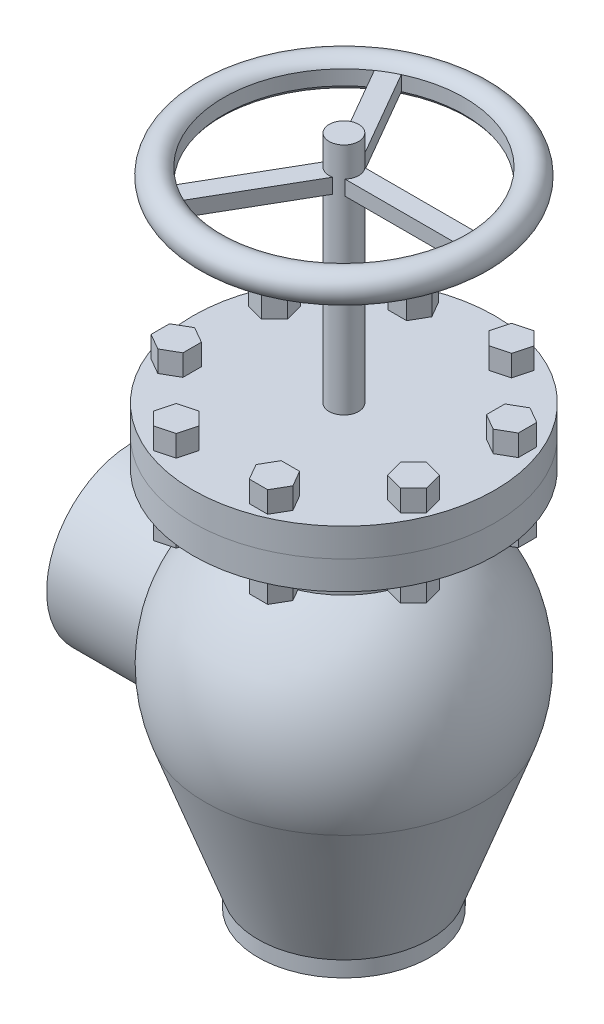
ISO-10303-21;
HEADER;
FILE_DESCRIPTION(('STEP AP214'),'2;1');
FILE_NAME('part.step','',(''),(''),'','','');
FILE_SCHEMA(('AUTOMOTIVE_DESIGN { 1 0 10303 214 1 1 1 1 }'));
ENDSEC;
DATA;
#1=APPLICATION_CONTEXT('core data for automotive mechanical design processes');
#2=APPLICATION_PROTOCOL_DEFINITION('international standard','automotive_design',2000,#1);
#3=PRODUCT_CONTEXT('',#1,'mechanical');
#4=PRODUCT('Part','Part','',(#3));
#5=PRODUCT_RELATED_PRODUCT_CATEGORY('part','',(#4));
#6=PRODUCT_DEFINITION_FORMATION('','',#4);
#7=PRODUCT_DEFINITION_CONTEXT('part definition',#1,'design');
#8=PRODUCT_DEFINITION('design','',#6,#7);
#9=PRODUCT_DEFINITION_SHAPE('','',#8);
#10=(LENGTH_UNIT() NAMED_UNIT(*) SI_UNIT(.MILLI.,.METRE.));
#11=(NAMED_UNIT(*) PLANE_ANGLE_UNIT() SI_UNIT($,.RADIAN.));
#12=(NAMED_UNIT(*) SI_UNIT($,.STERADIAN.) SOLID_ANGLE_UNIT());
#13=UNCERTAINTY_MEASURE_WITH_UNIT(LENGTH_MEASURE(1.E-05),#10,'distance_accuracy_value','');
#14=(GEOMETRIC_REPRESENTATION_CONTEXT(3) GLOBAL_UNCERTAINTY_ASSIGNED_CONTEXT((#13)) GLOBAL_UNIT_ASSIGNED_CONTEXT((#10,
#11,#12)) REPRESENTATION_CONTEXT('',''));
#15=CARTESIAN_POINT('',(0.,0.,0.));
#16=DIRECTION('',(0.,0.,1.));
#17=DIRECTION('',(1.,0.,0.));
#18=AXIS2_PLACEMENT_3D('',#15,#16,#17);
#19=CARTESIAN_POINT('',(0.,166.116,0.));
#20=DIRECTION('',(0.,-1.,0.));
#21=DIRECTION('',(0.,0.,-1.));
#22=AXIS2_PLACEMENT_3D('',#19,#20,#21);
#23=CYLINDRICAL_SURFACE('',#22,127.);
#24=CARTESIAN_POINT('',(0.,189.992,0.));
#25=DIRECTION('',(0.,1.,0.));
#26=DIRECTION('',(0.,0.,1.));
#27=AXIS2_PLACEMENT_3D('',#24,#25,#26);
#28=CIRCLE('',#27,127.);
#29=CARTESIAN_POINT('',(0.,189.992,127.));
#30=VERTEX_POINT('',#29);
#31=EDGE_CURVE('E1434',#30,#30,#28,.T.);
#32=ORIENTED_EDGE('',*,*,#31,.F.);
#33=EDGE_LOOP('',(#32));
#34=FACE_BOUND('',#33,.T.);
#35=CARTESIAN_POINT('',(0.,166.116,0.));
#36=DIRECTION('',(0.,-1.,0.));
#37=DIRECTION('',(0.,0.,-1.));
#38=AXIS2_PLACEMENT_3D('',#35,#36,#37);
#39=CIRCLE('',#38,127.);
#40=CARTESIAN_POINT('',(127.,166.116,0.));
#41=VERTEX_POINT('',#40);
#42=CARTESIAN_POINT('',(-127.,166.116,0.));
#43=VERTEX_POINT('',#42);
#44=EDGE_CURVE('E12',#41,#43,#39,.T.);
#45=ORIENTED_EDGE('',*,*,#44,.F.);
#46=EDGE_CURVE('E42',#43,#41,#39,.T.);
#47=ORIENTED_EDGE('',*,*,#46,.F.);
#48=EDGE_LOOP('',(#45,#47));
#49=FACE_BOUND('',#48,.T.);
#50=ADVANCED_FACE('F37',(#34,#49),#23,.T.);
#51=CARTESIAN_POINT('',(-72.263,-177.8,0.));
#52=DIRECTION('',(0.,1.,0.));
#53=DIRECTION('',(0.,0.,1.));
#54=AXIS2_PLACEMENT_3D('',#51,#52,#53);
#55=PLANE('',#54);
#56=CARTESIAN_POINT('',(0.,-177.8,0.));
#57=DIRECTION('',(0.,-1.,0.));
#58=DIRECTION('',(0.,0.,-1.));
#59=AXIS2_PLACEMENT_3D('',#56,#57,#58);
#60=CIRCLE('',#59,72.263);
#61=CARTESIAN_POINT('',(0.,-177.8,-72.263));
#62=VERTEX_POINT('',#61);
#63=EDGE_CURVE('E1444',#62,#62,#60,.T.);
#64=ORIENTED_EDGE('',*,*,#63,.T.);
#65=EDGE_LOOP('',(#64));
#66=FACE_BOUND('',#65,.T.);
#67=CARTESIAN_POINT('',(0.,-177.8,0.));
#68=DIRECTION('',(0.,-1.,0.));
#69=DIRECTION('',(1.,0.,0.));
#70=AXIS2_PLACEMENT_3D('',#67,#68,#69);
#71=CIRCLE('',#70,65.7098);
#72=CARTESIAN_POINT('',(65.7098,-177.8,0.));
#73=VERTEX_POINT('',#72);
#74=EDGE_CURVE('E1342',#73,#73,#71,.T.);
#75=ORIENTED_EDGE('',*,*,#74,.F.);
#76=EDGE_LOOP('',(#75));
#77=FACE_BOUND('',#76,.T.);
#78=ADVANCED_FACE('F1498',(#66,#77),#55,.F.);
#79=CARTESIAN_POINT('',(-101.235447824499,349.377,0.));
#80=DIRECTION('',(0.,1.,0.));
#81=DIRECTION('',(0.,0.,1.));
#82=AXIS2_PLACEMENT_3D('',#79,#80,#81);
#83=PLANE('',#82);
#84=CARTESIAN_POINT('',(0.,349.377,0.));
#85=DIRECTION('',(0.,-1.,0.));
#86=DIRECTION('',(0.,0.,-1.));
#87=AXIS2_PLACEMENT_3D('',#84,#85,#86);
#88=CIRCLE('',#87,101.235447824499);
#89=CARTESIAN_POINT('',(-43.2617220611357,349.377,91.5261672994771));
#90=VERTEX_POINT('',#89);
#91=CARTESIAN_POINT('',(-57.6331249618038,349.377,83.2288339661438));
#92=VERTEX_POINT('',#91);
#93=EDGE_CURVE('E1430',#90,#92,#88,.T.);
#94=ORIENTED_EDGE('',*,*,#93,.T.);
#95=DIRECTION('',(-0.5,0.,0.866025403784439));
#96=VECTOR('',#95,1.);
#97=CARTESIAN_POINT('',(-57.6331249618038,349.377,83.2288339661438));
#98=LINE('',#97,#96);
#99=CARTESIAN_POINT('',(-11.8240517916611,349.377,3.88519178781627));
#100=VERTEX_POINT('',#99);
#101=EDGE_CURVE('E1348',#100,#92,#98,.T.);
#102=ORIENTED_EDGE('',*,*,#101,.F.);
#103=CARTESIAN_POINT('',(0.,349.377,0.));
#104=DIRECTION('',(0.,1.,0.));
#105=DIRECTION('',(0.,0.,1.));
#106=AXIS2_PLACEMENT_3D('',#103,#104,#105);
#107=CIRCLE('',#106,12.446);
#108=CARTESIAN_POINT('',(2.54735110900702,349.377,12.1825251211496));
#109=VERTEX_POINT('',#108);
#110=EDGE_CURVE('E1674',#109,#100,#107,.F.);
#111=ORIENTED_EDGE('',*,*,#110,.F.);
#112=DIRECTION('',(0.5,0.,-0.866025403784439));
#113=VECTOR('',#112,1.);
#114=CARTESIAN_POINT('',(-43.2617220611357,349.377,91.5261672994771));
#115=LINE('',#114,#113);
#116=EDGE_CURVE('E1375',#90,#109,#115,.T.);
#117=ORIENTED_EDGE('',*,*,#116,.F.);
#118=EDGE_LOOP('',(#94,#102,#111,#117));
#119=FACE_BOUND('',#118,.T.);
#120=ADVANCED_FACE('F1504',(#119),#83,.F.);
#121=CARTESIAN_POINT('',(-101.235447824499,361.823,0.));
#122=DIRECTION('',(0.,-1.,0.));
#123=DIRECTION('',(0.,0.,-1.));
#124=AXIS2_PLACEMENT_3D('',#121,#122,#123);
#125=PLANE('',#124);
#126=CARTESIAN_POINT('',(0.,361.823,0.));
#127=DIRECTION('',(0.,-1.,0.));
#128=DIRECTION('',(0.,0.,-1.));
#129=AXIS2_PLACEMENT_3D('',#126,#127,#128);
#130=CIRCLE('',#129,12.446);
#131=CARTESIAN_POINT('',(-11.8240517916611,361.823,3.88519178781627));
#132=VERTEX_POINT('',#131);
#133=CARTESIAN_POINT('',(2.54735110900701,361.823,12.1825251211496));
#134=VERTEX_POINT('',#133);
#135=EDGE_CURVE('E1678',#132,#134,#130,.F.);
#136=ORIENTED_EDGE('',*,*,#135,.F.);
#137=DIRECTION('',(0.5,0.,-0.866025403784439));
#138=VECTOR('',#137,1.);
#139=CARTESIAN_POINT('',(-57.6331249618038,361.823,83.2288339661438));
#140=LINE('',#139,#138);
#141=CARTESIAN_POINT('',(-57.6331249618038,361.823,83.2288339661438));
#142=VERTEX_POINT('',#141);
#143=EDGE_CURVE('E1357',#142,#132,#140,.T.);
#144=ORIENTED_EDGE('',*,*,#143,.F.);
#145=CARTESIAN_POINT('',(0.,361.823,0.));
#146=DIRECTION('',(0.,-1.,0.));
#147=DIRECTION('',(0.,0.,-1.));
#148=AXIS2_PLACEMENT_3D('',#145,#146,#147);
#149=CIRCLE('',#148,101.235447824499);
#150=CARTESIAN_POINT('',(-43.2617220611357,361.823,91.5261672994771));
#151=VERTEX_POINT('',#150);
#152=EDGE_CURVE('E1425',#151,#142,#149,.T.);
#153=ORIENTED_EDGE('',*,*,#152,.F.);
#154=DIRECTION('',(-0.5,0.,0.866025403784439));
#155=VECTOR('',#154,1.);
#156=CARTESIAN_POINT('',(-43.2617220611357,361.823,91.5261672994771));
#157=LINE('',#156,#155);
#158=EDGE_CURVE('E1369',#134,#151,#157,.T.);
#159=ORIENTED_EDGE('',*,*,#158,.F.);
#160=EDGE_LOOP('',(#136,#144,#153,#159));
#161=FACE_BOUND('',#160,.T.);
#162=ADVANCED_FACE('F1754',(#161),#125,.F.);
#163=CARTESIAN_POINT('',(100.89484702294,349.377,-8.29733333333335));
#164=VERTEX_POINT('',#163);
#165=CARTESIAN_POINT('',(100.89484702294,349.377,8.29733333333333));
#166=VERTEX_POINT('',#165);
#167=EDGE_CURVE('E1426',#164,#166,#88,.T.);
#168=ORIENTED_EDGE('',*,*,#167,.T.);
#169=DIRECTION('',(1.,0.,0.));
#170=VECTOR('',#169,1.);
#171=CARTESIAN_POINT('',(100.89484702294,349.377,8.29733333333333));
#172=LINE('',#171,#170);
#173=CARTESIAN_POINT('',(9.27670068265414,349.377,8.29733333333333));
#174=VERTEX_POINT('',#173);
#175=EDGE_CURVE('E1372',#174,#166,#172,.T.);
#176=ORIENTED_EDGE('',*,*,#175,.F.);
#177=CARTESIAN_POINT('',(9.27670068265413,349.377,-8.29733333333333));
#178=VERTEX_POINT('',#177);
#179=EDGE_CURVE('E1435',#178,#174,#107,.F.);
#180=ORIENTED_EDGE('',*,*,#179,.F.);
#181=DIRECTION('',(-1.,0.,0.));
#182=VECTOR('',#181,1.);
#183=CARTESIAN_POINT('',(100.89484702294,349.377,-8.29733333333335));
#184=LINE('',#183,#182);
#185=EDGE_CURVE('E1395',#164,#178,#184,.T.);
#186=ORIENTED_EDGE('',*,*,#185,.F.);
#187=EDGE_LOOP('',(#168,#176,#180,#186));
#188=FACE_BOUND('',#187,.T.);
#189=ADVANCED_FACE('F1758',(#188),#83,.F.);
#190=CARTESIAN_POINT('',(9.27670068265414,361.823,8.29733333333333));
#191=VERTEX_POINT('',#190);
#192=CARTESIAN_POINT('',(9.27670068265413,361.823,-8.29733333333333));
#193=VERTEX_POINT('',#192);
#194=EDGE_CURVE('E1429',#191,#193,#130,.F.);
#195=ORIENTED_EDGE('',*,*,#194,.F.);
#196=DIRECTION('',(-1.,0.,0.));
#197=VECTOR('',#196,1.);
#198=CARTESIAN_POINT('',(100.89484702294,361.823,8.29733333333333));
#199=LINE('',#198,#197);
#200=CARTESIAN_POINT('',(100.89484702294,361.823,8.29733333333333));
#201=VERTEX_POINT('',#200);
#202=EDGE_CURVE('E1381',#201,#191,#199,.T.);
#203=ORIENTED_EDGE('',*,*,#202,.F.);
#204=CARTESIAN_POINT('',(100.89484702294,361.823,-8.29733333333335));
#205=VERTEX_POINT('',#204);
#206=EDGE_CURVE('E1421',#205,#201,#149,.T.);
#207=ORIENTED_EDGE('',*,*,#206,.F.);
#208=DIRECTION('',(1.,0.,0.));
#209=VECTOR('',#208,1.);
#210=CARTESIAN_POINT('',(100.89484702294,361.823,-8.29733333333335));
#211=LINE('',#210,#209);
#212=EDGE_CURVE('E1405',#193,#205,#211,.T.);
#213=ORIENTED_EDGE('',*,*,#212,.F.);
#214=EDGE_LOOP('',(#195,#203,#207,#213));
#215=FACE_BOUND('',#214,.T.);
#216=ADVANCED_FACE('F1481',(#215),#125,.F.);
#217=CARTESIAN_POINT('',(0.,-199.445830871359,0.));
#218=DIRECTION('',(0.,-1.,0.));
#219=DIRECTION('',(0.,0.,-1.));
#220=AXIS2_PLACEMENT_3D('',#217,#218,#219);
#221=CYLINDRICAL_SURFACE('',#220,72.263);
#222=CARTESIAN_POINT('',(0.,101.054591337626,0.));
#223=DIRECTION('',(0.,-1.,0.));
#224=DIRECTION('',(0.,0.,-1.));
#225=AXIS2_PLACEMENT_3D('',#222,#223,#224);
#226=CIRCLE('',#225,72.263);
#227=CARTESIAN_POINT('',(0.,101.054591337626,-72.263));
#228=VERTEX_POINT('',#227);
#229=EDGE_CURVE('E1452',#228,#228,#226,.T.);
#230=ORIENTED_EDGE('',*,*,#229,.F.);
#231=EDGE_LOOP('',(#230));
#232=FACE_BOUND('',#231,.T.);
#233=CARTESIAN_POINT('',(0.,142.24,0.));
#234=DIRECTION('',(0.,1.,0.));
#235=DIRECTION('',(0.,0.,1.));
#236=AXIS2_PLACEMENT_3D('',#233,#234,#235);
#237=CIRCLE('',#236,72.263);
#238=CARTESIAN_POINT('',(0.,142.24,72.263));
#239=VERTEX_POINT('',#238);
#240=EDGE_CURVE('E1441',#239,#239,#237,.T.);
#241=ORIENTED_EDGE('',*,*,#240,.F.);
#242=EDGE_LOOP('',(#241));
#243=FACE_BOUND('',#242,.T.);
#244=ADVANCED_FACE('F1478',(#232,#243),#221,.T.);
#245=CARTESIAN_POINT('',(0.,0.,0.));
#246=DIRECTION('',(0.,-1.,0.));
#247=DIRECTION('',(-1.,0.,0.));
#248=AXIS2_PLACEMENT_3D('',#245,#246,#247);
#249=SPHERICAL_SURFACE('',#248,124.233536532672);
#250=CARTESIAN_POINT('',(-101.054591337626,0.,0.));
#251=DIRECTION('',(1.,0.,0.));
#252=DIRECTION('',(0.,0.,-1.));
#253=AXIS2_PLACEMENT_3D('',#250,#251,#252);
#254=CIRCLE('',#253,72.263);
#255=CARTESIAN_POINT('',(-101.054591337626,-42.4903719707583,58.4509149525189));
#256=VERTEX_POINT('',#255);
#257=CARTESIAN_POINT('',(-101.054591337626,-42.4903719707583,-58.4509149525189));
#258=VERTEX_POINT('',#257);
#259=EDGE_CURVE('E1465',#256,#258,#254,.F.);
#260=ORIENTED_EDGE('',*,*,#259,.F.);
#261=CARTESIAN_POINT('',(0.,-42.4903719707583,0.));
#262=DIRECTION('',(0.,-1.,0.));
#263=DIRECTION('',(0.,0.,-1.));
#264=AXIS2_PLACEMENT_3D('',#261,#262,#263);
#265=CIRCLE('',#264,116.741337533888);
#266=EDGE_CURVE('E1450',#258,#256,#265,.T.);
#267=ORIENTED_EDGE('',*,*,#266,.F.);
#268=EDGE_LOOP('',(#260,#267));
#269=FACE_BOUND('',#268,.T.);
#270=ORIENTED_EDGE('',*,*,#229,.T.);
#271=EDGE_LOOP('',(#270));
#272=FACE_BOUND('',#271,.T.);
#273=ADVANCED_FACE('F1473',(#269,#272),#249,.T.);
#274=CARTESIAN_POINT('',(0.,-42.4903719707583,0.));
#275=DIRECTION('',(0.,1.,0.));
#276=DIRECTION('',(0.,0.,1.));
#277=AXIS2_PLACEMENT_3D('',#274,#275,#276);
#278=CONICAL_SURFACE('',#277,116.741337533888,0.34906585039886);
#279=CARTESIAN_POINT('',(-101.05459133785,-42.4901719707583,-58.4510603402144));
#280=CARTESIAN_POINT('',(-101.054567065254,-43.2978691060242,-57.8639438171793));
#281=CARTESIAN_POINT('',(-101.065553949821,-44.0933297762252,-57.2600810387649));
#282=CARTESIAN_POINT('',(-101.107383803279,-45.6581511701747,-56.0202629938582));
#283=CARTESIAN_POINT('',(-101.138224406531,-46.4275149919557,-55.3843115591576));
#284=CARTESIAN_POINT('',(-101.217567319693,-47.9381534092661,-54.0820545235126));
#285=CARTESIAN_POINT('',(-101.266056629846,-48.679448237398,-53.4157715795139));
#286=CARTESIAN_POINT('',(-101.378435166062,-50.133249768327,-52.053728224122));
#287=CARTESIAN_POINT('',(-101.442324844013,-50.8457556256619,-51.3579669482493));
#288=CARTESIAN_POINT('',(-101.583091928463,-52.2395789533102,-49.9395082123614));
#289=CARTESIAN_POINT('',(-101.659946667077,-52.9209482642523,-49.216859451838));
#290=CARTESIAN_POINT('',(-101.8244454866,-54.2527836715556,-47.7447610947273));
#291=CARTESIAN_POINT('',(-101.912090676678,-54.9032465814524,-46.9953087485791));
#292=CARTESIAN_POINT('',(-102.187836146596,-56.8068641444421,-44.7085522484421));
#293=CARTESIAN_POINT('',(-102.388759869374,-58.0123739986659,-43.1327199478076));
#294=CARTESIAN_POINT('',(-102.806945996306,-60.2864831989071,-39.8922466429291));
#295=CARTESIAN_POINT('',(-103.02417374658,-61.3553605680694,-38.2277960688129));
#296=CARTESIAN_POINT('',(-103.350609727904,-62.8534892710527,-35.6701137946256));
#297=CARTESIAN_POINT('',(-103.459531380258,-63.3353759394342,-34.8072986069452));
#298=CARTESIAN_POINT('',(-103.67577218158,-64.2634302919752,-33.0624982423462));
#299=CARTESIAN_POINT('',(-103.78309146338,-64.7096009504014,-32.1805146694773));
#300=CARTESIAN_POINT('',(-103.994427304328,-65.5656489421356,-30.3984270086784));
#301=CARTESIAN_POINT('',(-104.098442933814,-65.9755161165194,-29.4983179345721));
#302=CARTESIAN_POINT('',(-104.301523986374,-66.7581147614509,-27.6816428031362));
#303=CARTESIAN_POINT('',(-104.400589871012,-67.1308496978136,-26.7650782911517));
#304=CARTESIAN_POINT('',(-104.592306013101,-67.8386165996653,-24.9167158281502));
#305=CARTESIAN_POINT('',(-104.684955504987,-68.1736440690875,-23.9849160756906));
#306=CARTESIAN_POINT('',(-104.862461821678,-68.805298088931,-22.1077523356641));
#307=CARTESIAN_POINT('',(-104.947319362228,-69.1019281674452,-21.1623896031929));
#308=CARTESIAN_POINT('',(-105.110409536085,-69.6644427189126,-19.2314198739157));
#309=CARTESIAN_POINT('',(-105.188372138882,-69.9291589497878,-18.2454493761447));
#310=CARTESIAN_POINT('',(-105.333587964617,-70.4167396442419,-16.2624254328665));
#311=CARTESIAN_POINT('',(-105.400841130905,-70.6396038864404,-15.2653719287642));
#312=CARTESIAN_POINT('',(-105.523643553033,-71.0429785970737,-13.2619920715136));
#313=CARTESIAN_POINT('',(-105.579192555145,-71.2234881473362,-12.2556655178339));
#314=CARTESIAN_POINT('',(-105.677769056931,-71.541721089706,-10.2356596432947));
#315=CARTESIAN_POINT('',(-105.720796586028,-71.6794445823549,-9.22198033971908));
#316=CARTESIAN_POINT('',(-105.793691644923,-71.9117368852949,-7.18951809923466));
#317=CARTESIAN_POINT('',(-105.823563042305,-72.0063183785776,-6.17073675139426));
#318=CARTESIAN_POINT('',(-105.869730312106,-72.1521510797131,-4.12976612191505));
#319=CARTESIAN_POINT('',(-105.886026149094,-72.2034021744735,-3.10757683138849));
#320=CARTESIAN_POINT('',(-105.904805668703,-72.2624433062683,-1.06185544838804));
#321=CARTESIAN_POINT('',(-105.907289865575,-72.2702349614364,-0.0383234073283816));
#322=CARTESIAN_POINT('',(-105.898411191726,-72.2423414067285,2.00808162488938));
#323=CARTESIAN_POINT('',(-105.887048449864,-72.2066566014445,3.03095462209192));
#324=CARTESIAN_POINT('',(-105.851467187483,-72.0945037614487,5.02770170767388));
#325=CARTESIAN_POINT('',(-105.827854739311,-72.0199576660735,6.00169519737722));
#326=CARTESIAN_POINT('',(-105.768474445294,-71.8314962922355,7.94548624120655));
#327=CARTESIAN_POINT('',(-105.732706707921,-71.7175813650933,8.91528383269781));
#328=CARTESIAN_POINT('',(-105.649491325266,-71.4506408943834,10.8489467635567));
#329=CARTESIAN_POINT('',(-105.602043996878,-71.2976164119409,11.812812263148));
#330=CARTESIAN_POINT('',(-105.496101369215,-70.9527885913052,13.7329692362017));
#331=CARTESIAN_POINT('',(-105.437606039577,-70.7609851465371,14.6892606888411));
#332=CARTESIAN_POINT('',(-105.310329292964,-70.3389268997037,16.592994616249));
#333=CARTESIAN_POINT('',(-105.241544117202,-70.1086580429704,17.5404337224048));
#334=CARTESIAN_POINT('',(-105.094629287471,-69.610162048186,19.4246307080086));
#335=CARTESIAN_POINT('',(-105.016498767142,-69.3419313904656,20.3613875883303));
#336=CARTESIAN_POINT('',(-104.851978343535,-68.7680723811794,22.2225475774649));
#337=CARTESIAN_POINT('',(-104.765589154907,-68.4624472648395,23.1469517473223));
#338=CARTESIAN_POINT('',(-104.585743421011,-67.814314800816,24.9821329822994));
#339=CARTESIAN_POINT('',(-104.492286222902,-67.471804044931,25.8929087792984));
#340=CARTESIAN_POINT('',(-104.298584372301,-66.7465551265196,27.7093006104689));
#341=CARTESIAN_POINT('',(-104.198276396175,-66.3634161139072,28.614749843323));
#342=CARTESIAN_POINT('',(-103.99329826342,-65.5606885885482,30.4089341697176));
#343=CARTESIAN_POINT('',(-103.888627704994,-65.1410967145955,31.2976677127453));
#344=CARTESIAN_POINT('',(-103.676552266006,-64.2661659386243,33.0570139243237));
#345=CARTESIAN_POINT('',(-103.569147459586,-63.8108280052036,33.9276270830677));
#346=CARTESIAN_POINT('',(-103.353336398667,-62.8650909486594,35.6494972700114));
#347=CARTESIAN_POINT('',(-103.244930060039,-62.3746888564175,36.5007526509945));
#348=CARTESIAN_POINT('',(-102.921144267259,-60.8529173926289,39.0219680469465));
#349=CARTESIAN_POINT('',(-102.706951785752,-59.7699970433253,40.6613588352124));
#350=CARTESIAN_POINT('',(-102.297632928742,-57.4732566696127,43.8477183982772));
#351=CARTESIAN_POINT('',(-102.102502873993,-56.2594620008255,45.3947049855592));
#352=CARTESIAN_POINT('',(-101.797663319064,-54.0633327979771,47.9698783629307));
#353=CARTESIAN_POINT('',(-101.679301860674,-53.1107374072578,49.0225198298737));
#354=CARTESIAN_POINT('',(-101.467990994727,-51.1440361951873,51.0709707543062));
#355=CARTESIAN_POINT('',(-101.375035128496,-50.1299460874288,52.0667946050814));
#356=CARTESIAN_POINT('',(-101.221149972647,-48.0431082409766,53.9983555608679));
#357=CARTESIAN_POINT('',(-101.160228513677,-46.9703462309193,54.9340779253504));
#358=CARTESIAN_POINT('',(-101.097762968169,-45.3203701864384,56.2895419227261));
#359=CARTESIAN_POINT('',(-101.081760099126,-44.7633983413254,56.7334700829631));
#360=CARTESIAN_POINT('',(-101.060171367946,-43.6364240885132,57.6047827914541));
#361=CARTESIAN_POINT('',(-101.054586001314,-43.0664210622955,58.0321665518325));
#362=CARTESIAN_POINT('',(-101.05459133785,-42.4901719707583,58.4510603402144));
#363=B_SPLINE_CURVE_WITH_KNOTS('',3,(#279,#280,#281,#282,#283,#284,#285,#286,#287,#288,#289,
#290,#291,#292,#293,#294,#295,#296,#297,#298,#299,#300,#301,#302,#303,#304,#305,#306,#307,#308,
#309,#310,#311,#312,#313,#314,#315,#316,#317,#318,#319,#320,#321,#322,#323,#324,#325,#326,#327,
#328,#329,#330,#331,#332,#333,#334,#335,#336,#337,#338,#339,#340,#341,#342,#343,#344,#345,#346,
#347,#348,#349,#350,#351,#352,#353,#354,#355,#356,#357,#358,#359,#360,#361,#362),.UNSPECIFIED.,
.F.,.F.,(4,2,2,2,2,2,2,2,2,2,2,2,2,2,2,2,2,2,2,2,2,2,2,2,2,2,2,2,2,2,2,2,2,2,2,2,2,2,2,2,2,4),
(0.,2.99526726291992,5.99017769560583,8.98288657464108,11.9756832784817,14.9633006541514,
17.9512253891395,23.9265340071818,29.8894835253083,32.8715371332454,35.8533421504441,
38.8359789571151,41.8183371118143,44.8010504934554,47.7834896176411,50.8541025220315,
53.9247316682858,56.995427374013,60.066115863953,63.1359010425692,66.2056942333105,
69.2753731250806,72.3450234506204,75.2755327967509,78.2060159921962,81.1364196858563,
84.0668314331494,86.9983162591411,89.9300730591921,92.8615763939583,95.7933508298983,
98.7573561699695,101.721635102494,104.685833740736,107.65028367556,113.572522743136,
119.493616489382,123.764938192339,128.035173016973,132.306451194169,134.443380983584,
136.580412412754),.UNSPECIFIED.);
#364=EDGE_CURVE('E1458',#258,#256,#363,.T.);
#365=ORIENTED_EDGE('',*,*,#364,.F.);
#366=ORIENTED_EDGE('',*,*,#266,.T.);
#367=EDGE_LOOP('',(#365,#366));
#368=FACE_BOUND('',#367,.T.);
#369=CARTESIAN_POINT('',(0.,-164.6936,0.));
#370=DIRECTION('',(0.,-1.,0.));
#371=DIRECTION('',(0.,0.,-1.));
#372=AXIS2_PLACEMENT_3D('',#369,#370,#371);
#373=CIRCLE('',#372,72.263);
#374=CARTESIAN_POINT('',(0.,-164.6936,-72.263));
#375=VERTEX_POINT('',#374);
#376=EDGE_CURVE('E1447',#375,#375,#373,.T.);
#377=ORIENTED_EDGE('',*,*,#376,.F.);
#378=EDGE_LOOP('',(#377));
#379=FACE_BOUND('',#378,.T.);
#380=ADVANCED_FACE('F1467',(#368,#379),#278,.T.);
#381=CARTESIAN_POINT('',(0.,-199.445830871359,0.));
#382=DIRECTION('',(0.,-1.,0.));
#383=DIRECTION('',(0.,0.,-1.));
#384=AXIS2_PLACEMENT_3D('',#381,#382,#383);
#385=CYLINDRICAL_SURFACE('',#384,72.263);
#386=ORIENTED_EDGE('',*,*,#63,.F.);
#387=EDGE_LOOP('',(#386));
#388=FACE_BOUND('',#387,.T.);
#389=ORIENTED_EDGE('',*,*,#376,.T.);
#390=EDGE_LOOP('',(#389));
#391=FACE_BOUND('',#390,.T.);
#392=ADVANCED_FACE('F1472',(#388,#391),#385,.T.);
#393=CARTESIAN_POINT('',(-177.8,0.,0.));
#394=DIRECTION('',(1.,0.,0.));
#395=DIRECTION('',(0.,0.,-1.));
#396=AXIS2_PLACEMENT_3D('',#393,#394,#395);
#397=CYLINDRICAL_SURFACE('',#396,72.263);
#398=CARTESIAN_POINT('',(-177.8,0.,0.));
#399=DIRECTION('',(1.,0.,0.));
#400=DIRECTION('',(0.,0.,-1.));
#401=AXIS2_PLACEMENT_3D('',#398,#399,#400);
#402=CIRCLE('',#401,72.263);
#403=CARTESIAN_POINT('',(-177.8,0.,-72.263));
#404=VERTEX_POINT('',#403);
#405=EDGE_CURVE('E1455',#404,#404,#402,.T.);
#406=ORIENTED_EDGE('',*,*,#405,.T.);
#407=EDGE_LOOP('',(#406));
#408=FACE_BOUND('',#407,.T.);
#409=ORIENTED_EDGE('',*,*,#364,.T.);
#410=ORIENTED_EDGE('',*,*,#259,.T.);
#411=EDGE_LOOP('',(#409,#410));
#412=FACE_BOUND('',#411,.T.);
#413=ADVANCED_FACE('F39',(#408,#412),#397,.T.);
#414=CARTESIAN_POINT('',(-177.8,0.,0.));
#415=DIRECTION('',(1.,0.,0.));
#416=DIRECTION('',(0.,0.,-1.));
#417=AXIS2_PLACEMENT_3D('',#414,#415,#416);
#418=PLANE('',#417);
#419=CARTESIAN_POINT('',(-177.8,0.,0.));
#420=DIRECTION('',(-1.,0.,0.));
#421=DIRECTION('',(0.,0.,1.));
#422=AXIS2_PLACEMENT_3D('',#419,#420,#421);
#423=CIRCLE('',#422,65.7098);
#424=CARTESIAN_POINT('',(-177.8,0.,65.7098));
#425=VERTEX_POINT('',#424);
#426=EDGE_CURVE('E1336',#425,#425,#423,.T.);
#427=ORIENTED_EDGE('',*,*,#426,.F.);
#428=EDGE_LOOP('',(#427));
#429=FACE_BOUND('',#428,.T.);
#430=ORIENTED_EDGE('',*,*,#405,.F.);
#431=EDGE_LOOP('',(#430));
#432=FACE_BOUND('',#431,.T.);
#433=ADVANCED_FACE('F1483',(#429,#432),#418,.F.);
#434=CARTESIAN_POINT('',(0.,142.24,0.));
#435=DIRECTION('',(0.,1.,0.));
#436=DIRECTION('',(0.,0.,1.));
#437=AXIS2_PLACEMENT_3D('',#434,#435,#436);
#438=PLANE('',#437);
#439=DIRECTION('',(0.707106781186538,0.,0.707106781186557));
#440=VECTOR('',#439,1.);
#441=CARTESIAN_POINT('',(61.0385855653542,142.24,-61.0385855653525));
#442=LINE('',#441,#440);
#443=CARTESIAN_POINT('',(26.3524265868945,142.24,-95.724744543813));
#444=VERTEX_POINT('',#443);
#445=CARTESIAN_POINT('',(37.3026255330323,142.24,-84.774545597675));
#446=VERTEX_POINT('',#445);
#447=EDGE_CURVE('E792',#444,#446,#442,.T.);
#448=ORIENTED_EDGE('',*,*,#447,.T.);
#449=DIRECTION('',(0.965925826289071,0.,-0.258819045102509));
#450=VECTOR('',#449,1.);
#451=CARTESIAN_POINT('',(-18.6948343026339,142.24,-69.7700714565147));
#452=LINE('',#451,#450);
#453=CARTESIAN_POINT('',(52.2608754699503,142.24,-88.7825965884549));
#454=VERTEX_POINT('',#453);
#455=EDGE_CURVE('E795',#446,#454,#452,.T.);
#456=ORIENTED_EDGE('',*,*,#455,.T.);
#457=DIRECTION('',(0.258819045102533,0.,-0.965925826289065));
#458=VECTOR('',#457,1.);
#459=CARTESIAN_POINT('',(26.5644114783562,142.24,7.11791260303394));
#460=LINE('',#459,#458);
#461=CARTESIAN_POINT('',(56.2689264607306,142.24,-103.740846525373));
#462=VERTEX_POINT('',#461);
#463=EDGE_CURVE('E716',#454,#462,#460,.T.);
#464=ORIENTED_EDGE('',*,*,#463,.T.);
#465=DIRECTION('',(-0.707106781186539,0.,-0.707106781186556));
#466=VECTOR('',#465,1.);
#467=CARTESIAN_POINT('',(80.0048864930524,142.24,-80.0048864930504));
#468=LINE('',#467,#466);
#469=CARTESIAN_POINT('',(45.3187275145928,142.24,-114.691045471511));
#470=VERTEX_POINT('',#469);
#471=EDGE_CURVE('E783',#462,#470,#468,.T.);
#472=ORIENTED_EDGE('',*,*,#471,.T.);
#473=DIRECTION('',(-0.965925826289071,0.,0.258819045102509));
#474=VECTOR('',#473,1.);
#475=CARTESIAN_POINT('',(-25.6369822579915,142.24,-95.6785203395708));
#476=LINE('',#475,#474);
#477=CARTESIAN_POINT('',(30.3604775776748,142.24,-110.682994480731));
#478=VERTEX_POINT('',#477);
#479=EDGE_CURVE('E786',#470,#478,#476,.T.);
#480=ORIENTED_EDGE('',*,*,#479,.T.);
#481=DIRECTION('',(-0.258819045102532,0.,0.965925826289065));
#482=VECTOR('',#481,1.);
#483=CARTESIAN_POINT('',(0.655962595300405,142.24,0.175764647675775));
#484=LINE('',#483,#482);
#485=EDGE_CURVE('E789',#478,#444,#484,.T.);
#486=ORIENTED_EDGE('',*,*,#485,.T.);
#487=EDGE_LOOP('',(#448,#456,#464,#472,#480,#486));
#488=FACE_BOUND('',#487,.T.);
#489=DIRECTION('',(1.,0.,0.));
#490=VECTOR('',#489,1.);
#491=CARTESIAN_POINT('',(0.,142.24,-86.3215955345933));
#492=LINE('',#491,#490);
#493=CARTESIAN_POINT('',(-49.0536364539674,142.24,-86.3215955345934));
#494=VERTEX_POINT('',#493);
#495=CARTESIAN_POINT('',(-33.5677165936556,142.24,-86.3215955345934));
#496=VERTEX_POINT('',#495);
#497=EDGE_CURVE('E868',#494,#496,#492,.T.);
#498=ORIENTED_EDGE('',*,*,#497,.T.);
#499=DIRECTION('',(0.5,0.,-0.866025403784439));
#500=VECTOR('',#499,1.);
#501=CARTESIAN_POINT('',(-62.5541347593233,142.24,-36.1156465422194));
#502=LINE('',#501,#500);
#503=CARTESIAN_POINT('',(-25.8247566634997,142.24,-99.7327955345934));
#504=VERTEX_POINT('',#503);
#505=EDGE_CURVE('E871',#496,#504,#502,.T.);
#506=ORIENTED_EDGE('',*,*,#505,.T.);
#507=DIRECTION('',(-0.5,0.,-0.866025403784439));
#508=VECTOR('',#507,1.);
#509=CARTESIAN_POINT('',(23.8169997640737,142.24,-13.7507512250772));
#510=LINE('',#509,#508);
#511=CARTESIAN_POINT('',(-33.5677165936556,142.24,-113.143995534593));
#512=VERTEX_POINT('',#511);
#513=EDGE_CURVE('E837',#504,#512,#510,.T.);
#514=ORIENTED_EDGE('',*,*,#513,.T.);
#515=DIRECTION('',(-1.,0.,0.));
#516=VECTOR('',#515,1.);
#517=CARTESIAN_POINT('',(0.,142.24,-113.143995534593));
#518=LINE('',#517,#516);
#519=CARTESIAN_POINT('',(-49.0536364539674,142.24,-113.143995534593));
#520=VERTEX_POINT('',#519);
#521=EDGE_CURVE('E859',#512,#520,#518,.T.);
#522=ORIENTED_EDGE('',*,*,#521,.T.);
#523=DIRECTION('',(-0.5,0.,0.866025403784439));
#524=VECTOR('',#523,1.);
#525=CARTESIAN_POINT('',(-85.783014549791,142.24,-49.5268465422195));
#526=LINE('',#525,#524);
#527=CARTESIAN_POINT('',(-56.7965963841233,142.24,-99.7327955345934));
#528=VERTEX_POINT('',#527);
#529=EDGE_CURVE('E862',#520,#528,#526,.T.);
#530=ORIENTED_EDGE('',*,*,#529,.T.);
#531=DIRECTION('',(0.5,0.,0.866025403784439));
#532=VECTOR('',#531,1.);
#533=CARTESIAN_POINT('',(0.588119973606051,142.24,-0.339551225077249));
#534=LINE('',#533,#532);
#535=EDGE_CURVE('E865',#528,#494,#534,.T.);
#536=ORIENTED_EDGE('',*,*,#535,.T.);
#537=EDGE_LOOP('',(#498,#506,#514,#522,#530,#536));
#538=FACE_BOUND('',#537,.T.);
#539=DIRECTION('',(0.707106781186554,0.,-0.707106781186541));
#540=VECTOR('',#539,1.);
#541=CARTESIAN_POINT('',(-61.0385855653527,142.24,-61.0385855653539));
#542=LINE('',#541,#540);
#543=CARTESIAN_POINT('',(-95.7247445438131,142.24,-26.3524265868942));
#544=VERTEX_POINT('',#543);
#545=CARTESIAN_POINT('',(-84.7745455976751,142.24,-37.302625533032));
#546=VERTEX_POINT('',#545);
#547=EDGE_CURVE('E945',#544,#546,#542,.T.);
#548=ORIENTED_EDGE('',*,*,#547,.T.);
#549=DIRECTION('',(-0.258819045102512,0.,-0.965925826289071));
#550=VECTOR('',#549,1.);
#551=CARTESIAN_POINT('',(-69.7700714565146,142.24,18.6948343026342));
#552=LINE('',#551,#550);
#553=CARTESIAN_POINT('',(-88.782596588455,142.24,-52.26087546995));
#554=VERTEX_POINT('',#553);
#555=EDGE_CURVE('E948',#546,#554,#552,.T.);
#556=ORIENTED_EDGE('',*,*,#555,.T.);
#557=DIRECTION('',(-0.965925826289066,0.,-0.25881904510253));
#558=VECTOR('',#557,1.);
#559=CARTESIAN_POINT('',(7.11791260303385,142.24,-26.5644114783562));
#560=LINE('',#559,#558);
#561=CARTESIAN_POINT('',(-103.740846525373,142.24,-56.2689264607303));
#562=VERTEX_POINT('',#561);
#563=EDGE_CURVE('E914',#554,#562,#560,.T.);
#564=ORIENTED_EDGE('',*,*,#563,.T.);
#565=DIRECTION('',(-0.707106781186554,0.,0.707106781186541));
#566=VECTOR('',#565,1.);
#567=CARTESIAN_POINT('',(-80.0048864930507,142.24,-80.0048864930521));
#568=LINE('',#567,#566);
#569=CARTESIAN_POINT('',(-114.691045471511,142.24,-45.3187275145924));
#570=VERTEX_POINT('',#569);
#571=EDGE_CURVE('E936',#562,#570,#568,.T.);
#572=ORIENTED_EDGE('',*,*,#571,.T.);
#573=DIRECTION('',(0.258819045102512,0.,0.965925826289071));
#574=VECTOR('',#573,1.);
#575=CARTESIAN_POINT('',(-95.6785203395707,142.24,25.6369822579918));
#576=LINE('',#575,#574);
#577=CARTESIAN_POINT('',(-110.682994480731,142.24,-30.3604775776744));
#578=VERTEX_POINT('',#577);
#579=EDGE_CURVE('E939',#570,#578,#576,.T.);
#580=ORIENTED_EDGE('',*,*,#579,.T.);
#581=DIRECTION('',(0.965925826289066,0.,0.258819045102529));
#582=VECTOR('',#581,1.);
#583=CARTESIAN_POINT('',(0.175764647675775,142.24,-0.655962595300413));
#584=LINE('',#583,#582);
#585=EDGE_CURVE('E942',#578,#544,#584,.T.);
#586=ORIENTED_EDGE('',*,*,#585,.T.);
#587=EDGE_LOOP('',(#548,#556,#564,#572,#580,#586));
#588=FACE_BOUND('',#587,.T.);
#589=DIRECTION('',(0.,0.,-1.));
#590=VECTOR('',#589,1.);
#591=CARTESIAN_POINT('',(-86.3215955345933,142.24,0.));
#592=LINE('',#591,#590);
#593=CARTESIAN_POINT('',(-86.3215955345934,142.24,49.0536364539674));
#594=VERTEX_POINT('',#593);
#595=CARTESIAN_POINT('',(-86.3215955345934,142.24,33.5677165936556));
#596=VERTEX_POINT('',#595);
#597=EDGE_CURVE('E1022',#594,#596,#592,.T.);
#598=ORIENTED_EDGE('',*,*,#597,.T.);
#599=DIRECTION('',(-0.866025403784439,0.,-0.5));
#600=VECTOR('',#599,1.);
#601=CARTESIAN_POINT('',(-36.1156465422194,142.24,62.5541347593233));
#602=LINE('',#601,#600);
#603=CARTESIAN_POINT('',(-99.7327955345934,142.24,25.8247566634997));
#604=VERTEX_POINT('',#603);
#605=EDGE_CURVE('E1025',#596,#604,#602,.T.);
#606=ORIENTED_EDGE('',*,*,#605,.T.);
#607=DIRECTION('',(-0.866025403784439,0.,0.5));
#608=VECTOR('',#607,1.);
#609=CARTESIAN_POINT('',(-13.7507512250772,142.24,-23.8169997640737));
#610=LINE('',#609,#608);
#611=CARTESIAN_POINT('',(-113.143995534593,142.24,33.5677165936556));
#612=VERTEX_POINT('',#611);
#613=EDGE_CURVE('E991',#604,#612,#610,.T.);
#614=ORIENTED_EDGE('',*,*,#613,.T.);
#615=DIRECTION('',(0.,0.,1.));
#616=VECTOR('',#615,1.);
#617=CARTESIAN_POINT('',(-113.143995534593,142.24,0.));
#618=LINE('',#617,#616);
#619=CARTESIAN_POINT('',(-113.143995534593,142.24,49.0536364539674));
#620=VERTEX_POINT('',#619);
#621=EDGE_CURVE('E1013',#612,#620,#618,.T.);
#622=ORIENTED_EDGE('',*,*,#621,.T.);
#623=DIRECTION('',(0.866025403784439,0.,0.5));
#624=VECTOR('',#623,1.);
#625=CARTESIAN_POINT('',(-49.5268465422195,142.24,85.783014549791));
#626=LINE('',#625,#624);
#627=CARTESIAN_POINT('',(-99.7327955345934,142.24,56.7965963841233));
#628=VERTEX_POINT('',#627);
#629=EDGE_CURVE('E1016',#620,#628,#626,.T.);
#630=ORIENTED_EDGE('',*,*,#629,.T.);
#631=DIRECTION('',(0.866025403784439,0.,-0.5));
#632=VECTOR('',#631,1.);
#633=CARTESIAN_POINT('',(-0.339551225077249,142.24,-0.588119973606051));
#634=LINE('',#633,#632);
#635=EDGE_CURVE('E1019',#628,#594,#634,.T.);
#636=ORIENTED_EDGE('',*,*,#635,.T.);
#637=EDGE_LOOP('',(#598,#606,#614,#622,#630,#636));
#638=FACE_BOUND('',#637,.T.);
#639=DIRECTION('',(-0.707106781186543,0.,-0.707106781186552));
#640=VECTOR('',#639,1.);
#641=CARTESIAN_POINT('',(-61.0385855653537,142.24,61.038585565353));
#642=LINE('',#641,#640);
#643=CARTESIAN_POINT('',(-26.3524265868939,142.24,95.7247445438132));
#644=VERTEX_POINT('',#643);
#645=CARTESIAN_POINT('',(-37.3026255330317,142.24,84.7745455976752));
#646=VERTEX_POINT('',#645);
#647=EDGE_CURVE('E1099',#644,#646,#642,.T.);
#648=ORIENTED_EDGE('',*,*,#647,.T.);
#649=DIRECTION('',(-0.96592582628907,0.,0.258819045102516));
#650=VECTOR('',#649,1.);
#651=CARTESIAN_POINT('',(18.6948343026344,142.24,69.7700714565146));
#652=LINE('',#651,#650);
#653=CARTESIAN_POINT('',(-52.2608754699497,142.24,88.7825965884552));
#654=VERTEX_POINT('',#653);
#655=EDGE_CURVE('E1102',#646,#654,#652,.T.);
#656=ORIENTED_EDGE('',*,*,#655,.T.);
#657=DIRECTION('',(-0.258819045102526,0.,0.965925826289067));
#658=VECTOR('',#657,1.);
#659=CARTESIAN_POINT('',(-26.5644114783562,142.24,-7.11791260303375));
#660=LINE('',#659,#658);
#661=CARTESIAN_POINT('',(-56.2689264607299,142.24,103.740846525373));
#662=VERTEX_POINT('',#661);
#663=EDGE_CURVE('E1068',#654,#662,#660,.T.);
#664=ORIENTED_EDGE('',*,*,#663,.T.);
#665=DIRECTION('',(0.707106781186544,0.,0.707106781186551));
#666=VECTOR('',#665,1.);
#667=CARTESIAN_POINT('',(-80.0048864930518,142.24,80.004886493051));
#668=LINE('',#667,#666);
#669=CARTESIAN_POINT('',(-45.318727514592,142.24,114.691045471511));
#670=VERTEX_POINT('',#669);
#671=EDGE_CURVE('E1090',#662,#670,#668,.T.);
#672=ORIENTED_EDGE('',*,*,#671,.T.);
#673=DIRECTION('',(0.96592582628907,0.,-0.258819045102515));
#674=VECTOR('',#673,1.);
#675=CARTESIAN_POINT('',(25.6369822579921,142.24,95.6785203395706));
#676=LINE('',#675,#674);
#677=CARTESIAN_POINT('',(-30.360477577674,142.24,110.682994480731));
#678=VERTEX_POINT('',#677);
#679=EDGE_CURVE('E1093',#670,#678,#676,.T.);
#680=ORIENTED_EDGE('',*,*,#679,.T.);
#681=DIRECTION('',(0.258819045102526,0.,-0.965925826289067));
#682=VECTOR('',#681,1.);
#683=CARTESIAN_POINT('',(-0.65596259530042,142.24,-0.175764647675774));
#684=LINE('',#683,#682);
#685=EDGE_CURVE('E1096',#678,#644,#684,.T.);
#686=ORIENTED_EDGE('',*,*,#685,.T.);
#687=EDGE_LOOP('',(#648,#656,#664,#672,#680,#686));
#688=FACE_BOUND('',#687,.T.);
#689=DIRECTION('',(-1.,0.,0.));
#690=VECTOR('',#689,1.);
#691=CARTESIAN_POINT('',(0.,142.24,86.3215955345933));
#692=LINE('',#691,#690);
#693=CARTESIAN_POINT('',(49.0536364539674,142.24,86.3215955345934));
#694=VERTEX_POINT('',#693);
#695=CARTESIAN_POINT('',(33.5677165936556,142.24,86.3215955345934));
#696=VERTEX_POINT('',#695);
#697=EDGE_CURVE('E1176',#694,#696,#692,.T.);
#698=ORIENTED_EDGE('',*,*,#697,.T.);
#699=DIRECTION('',(-0.5,0.,0.866025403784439));
#700=VECTOR('',#699,1.);
#701=CARTESIAN_POINT('',(62.5541347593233,142.24,36.1156465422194));
#702=LINE('',#701,#700);
#703=CARTESIAN_POINT('',(25.8247566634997,142.24,99.7327955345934));
#704=VERTEX_POINT('',#703);
#705=EDGE_CURVE('E1179',#696,#704,#702,.T.);
#706=ORIENTED_EDGE('',*,*,#705,.T.);
#707=DIRECTION('',(0.5,0.,0.866025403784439));
#708=VECTOR('',#707,1.);
#709=CARTESIAN_POINT('',(-23.8169997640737,142.24,13.7507512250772));
#710=LINE('',#709,#708);
#711=CARTESIAN_POINT('',(33.5677165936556,142.24,113.143995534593));
#712=VERTEX_POINT('',#711);
#713=EDGE_CURVE('E1145',#704,#712,#710,.T.);
#714=ORIENTED_EDGE('',*,*,#713,.T.);
#715=DIRECTION('',(1.,0.,0.));
#716=VECTOR('',#715,1.);
#717=CARTESIAN_POINT('',(0.,142.24,113.143995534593));
#718=LINE('',#717,#716);
#719=CARTESIAN_POINT('',(49.0536364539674,142.24,113.143995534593));
#720=VERTEX_POINT('',#719);
#721=EDGE_CURVE('E1167',#712,#720,#718,.T.);
#722=ORIENTED_EDGE('',*,*,#721,.T.);
#723=DIRECTION('',(0.5,0.,-0.866025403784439));
#724=VECTOR('',#723,1.);
#725=CARTESIAN_POINT('',(85.783014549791,142.24,49.5268465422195));
#726=LINE('',#725,#724);
#727=CARTESIAN_POINT('',(56.7965963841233,142.24,99.7327955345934));
#728=VERTEX_POINT('',#727);
#729=EDGE_CURVE('E1170',#720,#728,#726,.T.);
#730=ORIENTED_EDGE('',*,*,#729,.T.);
#731=DIRECTION('',(-0.5,0.,-0.866025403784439));
#732=VECTOR('',#731,1.);
#733=CARTESIAN_POINT('',(-0.588119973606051,142.24,0.339551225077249));
#734=LINE('',#733,#732);
#735=EDGE_CURVE('E1173',#728,#694,#734,.T.);
#736=ORIENTED_EDGE('',*,*,#735,.T.);
#737=EDGE_LOOP('',(#698,#706,#714,#722,#730,#736));
#738=FACE_BOUND('',#737,.T.);
#739=DIRECTION('',(-0.707106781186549,0.,0.707106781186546));
#740=VECTOR('',#739,1.);
#741=CARTESIAN_POINT('',(61.0385855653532,142.24,61.0385855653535));
#742=LINE('',#741,#740);
#743=CARTESIAN_POINT('',(95.7247445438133,142.24,26.3524265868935));
#744=VERTEX_POINT('',#743);
#745=CARTESIAN_POINT('',(84.7745455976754,142.24,37.3026255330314));
#746=VERTEX_POINT('',#745);
#747=EDGE_CURVE('E1253',#744,#746,#742,.T.);
#748=ORIENTED_EDGE('',*,*,#747,.T.);
#749=DIRECTION('',(0.258819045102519,0.,0.965925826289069));
#750=VECTOR('',#749,1.);
#751=CARTESIAN_POINT('',(69.7700714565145,142.24,-18.6948343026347));
#752=LINE('',#751,#750);
#753=CARTESIAN_POINT('',(88.7825965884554,142.24,52.2608754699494));
#754=VERTEX_POINT('',#753);
#755=EDGE_CURVE('E1256',#746,#754,#752,.T.);
#756=ORIENTED_EDGE('',*,*,#755,.T.);
#757=DIRECTION('',(0.965925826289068,0.,0.258819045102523));
#758=VECTOR('',#757,1.);
#759=CARTESIAN_POINT('',(-7.11791260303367,142.24,26.5644114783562));
#760=LINE('',#759,#758);
#761=CARTESIAN_POINT('',(103.740846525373,142.24,56.2689264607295));
#762=VERTEX_POINT('',#761);
#763=EDGE_CURVE('E1222',#754,#762,#760,.T.);
#764=ORIENTED_EDGE('',*,*,#763,.T.);
#765=DIRECTION('',(0.707106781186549,0.,-0.707106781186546));
#766=VECTOR('',#765,1.);
#767=CARTESIAN_POINT('',(80.0048864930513,142.24,80.0048864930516));
#768=LINE('',#767,#766);
#769=CARTESIAN_POINT('',(114.691045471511,142.24,45.3187275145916));
#770=VERTEX_POINT('',#769);
#771=EDGE_CURVE('E1244',#762,#770,#768,.T.);
#772=ORIENTED_EDGE('',*,*,#771,.T.);
#773=DIRECTION('',(-0.258819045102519,0.,-0.965925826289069));
#774=VECTOR('',#773,1.);
#775=CARTESIAN_POINT('',(95.6785203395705,142.24,-25.6369822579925));
#776=LINE('',#775,#774);
#777=CARTESIAN_POINT('',(110.682994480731,142.24,30.3604775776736));
#778=VERTEX_POINT('',#777);
#779=EDGE_CURVE('E1247',#770,#778,#776,.T.);
#780=ORIENTED_EDGE('',*,*,#779,.T.);
#781=DIRECTION('',(-0.965925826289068,0.,-0.258819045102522));
#782=VECTOR('',#781,1.);
#783=CARTESIAN_POINT('',(-0.175764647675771,142.24,0.655962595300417));
#784=LINE('',#783,#782);
#785=EDGE_CURVE('E1250',#778,#744,#784,.T.);
#786=ORIENTED_EDGE('',*,*,#785,.T.);
#787=EDGE_LOOP('',(#748,#756,#764,#772,#780,#786));
#788=FACE_BOUND('',#787,.T.);
#789=DIRECTION('',(0.,0.,1.));
#790=VECTOR('',#789,1.);
#791=CARTESIAN_POINT('',(86.3215955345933,142.24,0.));
#792=LINE('',#791,#790);
#793=CARTESIAN_POINT('',(86.3215955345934,142.24,-49.0536364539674));
#794=VERTEX_POINT('',#793);
#795=CARTESIAN_POINT('',(86.3215955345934,142.24,-33.5677165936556));
#796=VERTEX_POINT('',#795);
#797=EDGE_CURVE('E1330',#794,#796,#792,.T.);
#798=ORIENTED_EDGE('',*,*,#797,.T.);
#799=DIRECTION('',(0.866025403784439,0.,0.5));
#800=VECTOR('',#799,1.);
#801=CARTESIAN_POINT('',(36.1156465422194,142.24,-62.5541347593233));
#802=LINE('',#801,#800);
#803=CARTESIAN_POINT('',(99.7327955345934,142.24,-25.8247566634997));
#804=VERTEX_POINT('',#803);
#805=EDGE_CURVE('E1333',#796,#804,#802,.T.);
#806=ORIENTED_EDGE('',*,*,#805,.T.);
#807=DIRECTION('',(0.866025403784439,0.,-0.5));
#808=VECTOR('',#807,1.);
#809=CARTESIAN_POINT('',(13.7507512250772,142.24,23.8169997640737));
#810=LINE('',#809,#808);
#811=CARTESIAN_POINT('',(113.143995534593,142.24,-33.5677165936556));
#812=VERTEX_POINT('',#811);
#813=EDGE_CURVE('E1299',#804,#812,#810,.T.);
#814=ORIENTED_EDGE('',*,*,#813,.T.);
#815=DIRECTION('',(0.,0.,-1.));
#816=VECTOR('',#815,1.);
#817=CARTESIAN_POINT('',(113.143995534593,142.24,0.));
#818=LINE('',#817,#816);
#819=CARTESIAN_POINT('',(113.143995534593,142.24,-49.0536364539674));
#820=VERTEX_POINT('',#819);
#821=EDGE_CURVE('E1321',#812,#820,#818,.T.);
#822=ORIENTED_EDGE('',*,*,#821,.T.);
#823=DIRECTION('',(-0.866025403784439,0.,-0.5));
#824=VECTOR('',#823,1.);
#825=CARTESIAN_POINT('',(49.5268465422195,142.24,-85.783014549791));
#826=LINE('',#825,#824);
#827=CARTESIAN_POINT('',(99.7327955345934,142.24,-56.7965963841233));
#828=VERTEX_POINT('',#827);
#829=EDGE_CURVE('E1324',#820,#828,#826,.T.);
#830=ORIENTED_EDGE('',*,*,#829,.T.);
#831=DIRECTION('',(-0.866025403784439,0.,0.5));
#832=VECTOR('',#831,1.);
#833=CARTESIAN_POINT('',(0.339551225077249,142.24,0.588119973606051));
#834=LINE('',#833,#832);
#835=EDGE_CURVE('E1327',#828,#794,#834,.T.);
#836=ORIENTED_EDGE('',*,*,#835,.T.);
#837=EDGE_LOOP('',(#798,#806,#814,#822,#830,#836));
#838=FACE_BOUND('',#837,.T.);
#839=CARTESIAN_POINT('',(0.,142.24,0.));
#840=DIRECTION('',(0.,1.,0.));
#841=DIRECTION('',(0.,0.,1.));
#842=AXIS2_PLACEMENT_3D('',#839,#840,#841);
#843=CIRCLE('',#842,127.);
#844=CARTESIAN_POINT('',(0.,142.24,127.));
#845=VERTEX_POINT('',#844);
#846=EDGE_CURVE('E1438',#845,#845,#843,.T.);
#847=ORIENTED_EDGE('',*,*,#846,.F.);
#848=EDGE_LOOP('',(#847));
#849=FACE_BOUND('',#848,.T.);
#850=ORIENTED_EDGE('',*,*,#240,.T.);
#851=EDGE_LOOP('',(#850));
#852=FACE_BOUND('',#851,.T.);
#853=ADVANCED_FACE('F1485',(#488,#538,#588,#638,#688,#738,#788,#838,#849,#852),#438,.F.);
#854=ORIENTED_EDGE('',*,*,#46,.T.);
#855=ORIENTED_EDGE('',*,*,#44,.T.);
#856=EDGE_LOOP('',(#854,#855));
#857=FACE_BOUND('',#856,.T.);
#858=ORIENTED_EDGE('',*,*,#846,.T.);
#859=EDGE_LOOP('',(#858));
#860=FACE_BOUND('',#859,.T.);
#861=ADVANCED_FACE('F1491',(#857,#860),#23,.T.);
#862=CARTESIAN_POINT('',(0.,189.992,0.));
#863=DIRECTION('',(0.,1.,0.));
#864=DIRECTION('',(0.,0.,1.));
#865=AXIS2_PLACEMENT_3D('',#862,#863,#864);
#866=PLANE('',#865);
#867=DIRECTION('',(0.965925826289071,0.,-0.258819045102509));
#868=VECTOR('',#867,1.);
#869=CARTESIAN_POINT('',(-18.6948343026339,189.992,-69.7700714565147));
#870=LINE('',#869,#868);
#871=CARTESIAN_POINT('',(37.3026255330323,189.992,-84.774545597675));
#872=VERTEX_POINT('',#871);
#873=CARTESIAN_POINT('',(52.2608754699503,189.992,-88.7825965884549));
#874=VERTEX_POINT('',#873);
#875=EDGE_CURVE('E1522',#872,#874,#870,.T.);
#876=ORIENTED_EDGE('',*,*,#875,.F.);
#877=DIRECTION('',(0.707106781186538,0.,0.707106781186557));
#878=VECTOR('',#877,1.);
#879=CARTESIAN_POINT('',(61.0385855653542,189.992,-61.0385855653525));
#880=LINE('',#879,#878);
#881=CARTESIAN_POINT('',(26.3524265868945,189.992,-95.724744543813));
#882=VERTEX_POINT('',#881);
#883=EDGE_CURVE('E1526',#882,#872,#880,.T.);
#884=ORIENTED_EDGE('',*,*,#883,.F.);
#885=DIRECTION('',(-0.258819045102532,0.,0.965925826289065));
#886=VECTOR('',#885,1.);
#887=CARTESIAN_POINT('',(0.655962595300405,189.992,0.175764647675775));
#888=LINE('',#887,#886);
#889=CARTESIAN_POINT('',(30.3604775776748,189.992,-110.682994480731));
#890=VERTEX_POINT('',#889);
#891=EDGE_CURVE('E1531',#890,#882,#888,.T.);
#892=ORIENTED_EDGE('',*,*,#891,.F.);
#893=DIRECTION('',(-0.965925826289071,0.,0.258819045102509));
#894=VECTOR('',#893,1.);
#895=CARTESIAN_POINT('',(-25.6369822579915,189.992,-95.6785203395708));
#896=LINE('',#895,#894);
#897=CARTESIAN_POINT('',(45.3187275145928,189.992,-114.691045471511));
#898=VERTEX_POINT('',#897);
#899=EDGE_CURVE('E1536',#898,#890,#896,.T.);
#900=ORIENTED_EDGE('',*,*,#899,.F.);
#901=DIRECTION('',(-0.707106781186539,0.,-0.707106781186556));
#902=VECTOR('',#901,1.);
#903=CARTESIAN_POINT('',(80.0048864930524,189.992,-80.0048864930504));
#904=LINE('',#903,#902);
#905=CARTESIAN_POINT('',(56.2689264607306,189.992,-103.740846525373));
#906=VERTEX_POINT('',#905);
#907=EDGE_CURVE('E1539',#906,#898,#904,.T.);
#908=ORIENTED_EDGE('',*,*,#907,.F.);
#909=DIRECTION('',(0.258819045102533,0.,-0.965925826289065));
#910=VECTOR('',#909,1.);
#911=CARTESIAN_POINT('',(26.5644114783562,189.992,7.11791260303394));
#912=LINE('',#911,#910);
#913=EDGE_CURVE('E1542',#874,#906,#912,.T.);
#914=ORIENTED_EDGE('',*,*,#913,.F.);
#915=EDGE_LOOP('',(#876,#884,#892,#900,#908,#914));
#916=FACE_BOUND('',#915,.T.);
#917=DIRECTION('',(0.5,0.,-0.866025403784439));
#918=VECTOR('',#917,1.);
#919=CARTESIAN_POINT('',(-62.5541347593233,189.992,-36.1156465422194));
#920=LINE('',#919,#918);
#921=CARTESIAN_POINT('',(-33.5677165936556,189.992,-86.3215955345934));
#922=VERTEX_POINT('',#921);
#923=CARTESIAN_POINT('',(-25.8247566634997,189.992,-99.7327955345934));
#924=VERTEX_POINT('',#923);
#925=EDGE_CURVE('E1545',#922,#924,#920,.T.);
#926=ORIENTED_EDGE('',*,*,#925,.F.);
#927=DIRECTION('',(1.,0.,0.));
#928=VECTOR('',#927,1.);
#929=CARTESIAN_POINT('',(0.,189.992,-86.3215955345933));
#930=LINE('',#929,#928);
#931=CARTESIAN_POINT('',(-49.0536364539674,189.992,-86.3215955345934));
#932=VERTEX_POINT('',#931);
#933=EDGE_CURVE('E1548',#932,#922,#930,.T.);
#934=ORIENTED_EDGE('',*,*,#933,.F.);
#935=DIRECTION('',(0.5,0.,0.866025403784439));
#936=VECTOR('',#935,1.);
#937=CARTESIAN_POINT('',(0.588119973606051,189.992,-0.339551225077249));
#938=LINE('',#937,#936);
#939=CARTESIAN_POINT('',(-56.7965963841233,189.992,-99.7327955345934));
#940=VERTEX_POINT('',#939);
#941=EDGE_CURVE('E1551',#940,#932,#938,.T.);
#942=ORIENTED_EDGE('',*,*,#941,.F.);
#943=DIRECTION('',(-0.5,0.,0.866025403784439));
#944=VECTOR('',#943,1.);
#945=CARTESIAN_POINT('',(-85.783014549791,189.992,-49.5268465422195));
#946=LINE('',#945,#944);
#947=CARTESIAN_POINT('',(-49.0536364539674,189.992,-113.143995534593));
#948=VERTEX_POINT('',#947);
#949=EDGE_CURVE('E1554',#948,#940,#946,.T.);
#950=ORIENTED_EDGE('',*,*,#949,.F.);
#951=DIRECTION('',(-1.,0.,0.));
#952=VECTOR('',#951,1.);
#953=CARTESIAN_POINT('',(0.,189.992,-113.143995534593));
#954=LINE('',#953,#952);
#955=CARTESIAN_POINT('',(-33.5677165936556,189.992,-113.143995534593));
#956=VERTEX_POINT('',#955);
#957=EDGE_CURVE('E1557',#956,#948,#954,.T.);
#958=ORIENTED_EDGE('',*,*,#957,.F.);
#959=DIRECTION('',(-0.5,0.,-0.866025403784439));
#960=VECTOR('',#959,1.);
#961=CARTESIAN_POINT('',(23.8169997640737,189.992,-13.7507512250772));
#962=LINE('',#961,#960);
#963=EDGE_CURVE('E1560',#924,#956,#962,.T.);
#964=ORIENTED_EDGE('',*,*,#963,.F.);
#965=EDGE_LOOP('',(#926,#934,#942,#950,#958,#964));
#966=FACE_BOUND('',#965,.T.);
#967=DIRECTION('',(-0.258819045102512,0.,-0.965925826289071));
#968=VECTOR('',#967,1.);
#969=CARTESIAN_POINT('',(-69.7700714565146,189.992,18.6948343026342));
#970=LINE('',#969,#968);
#971=CARTESIAN_POINT('',(-84.7745455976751,189.992,-37.302625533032));
#972=VERTEX_POINT('',#971);
#973=CARTESIAN_POINT('',(-88.782596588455,189.992,-52.26087546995));
#974=VERTEX_POINT('',#973);
#975=EDGE_CURVE('E1563',#972,#974,#970,.T.);
#976=ORIENTED_EDGE('',*,*,#975,.F.);
#977=DIRECTION('',(0.707106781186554,0.,-0.707106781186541));
#978=VECTOR('',#977,1.);
#979=CARTESIAN_POINT('',(-61.0385855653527,189.992,-61.0385855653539));
#980=LINE('',#979,#978);
#981=CARTESIAN_POINT('',(-95.7247445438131,189.992,-26.3524265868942));
#982=VERTEX_POINT('',#981);
#983=EDGE_CURVE('E1566',#982,#972,#980,.T.);
#984=ORIENTED_EDGE('',*,*,#983,.F.);
#985=DIRECTION('',(0.965925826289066,0.,0.258819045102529));
#986=VECTOR('',#985,1.);
#987=CARTESIAN_POINT('',(0.175764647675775,189.992,-0.655962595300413));
#988=LINE('',#987,#986);
#989=CARTESIAN_POINT('',(-110.682994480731,189.992,-30.3604775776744));
#990=VERTEX_POINT('',#989);
#991=EDGE_CURVE('E1569',#990,#982,#988,.T.);
#992=ORIENTED_EDGE('',*,*,#991,.F.);
#993=DIRECTION('',(0.258819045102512,0.,0.965925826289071));
#994=VECTOR('',#993,1.);
#995=CARTESIAN_POINT('',(-95.6785203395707,189.992,25.6369822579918));
#996=LINE('',#995,#994);
#997=CARTESIAN_POINT('',(-114.691045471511,189.992,-45.3187275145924));
#998=VERTEX_POINT('',#997);
#999=EDGE_CURVE('E1572',#998,#990,#996,.T.);
#1000=ORIENTED_EDGE('',*,*,#999,.F.);
#1001=DIRECTION('',(-0.707106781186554,0.,0.707106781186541));
#1002=VECTOR('',#1001,1.);
#1003=CARTESIAN_POINT('',(-80.0048864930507,189.992,-80.0048864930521));
#1004=LINE('',#1003,#1002);
#1005=CARTESIAN_POINT('',(-103.740846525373,189.992,-56.2689264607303));
#1006=VERTEX_POINT('',#1005);
#1007=EDGE_CURVE('E1575',#1006,#998,#1004,.T.);
#1008=ORIENTED_EDGE('',*,*,#1007,.F.);
#1009=DIRECTION('',(-0.965925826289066,0.,-0.25881904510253));
#1010=VECTOR('',#1009,1.);
#1011=CARTESIAN_POINT('',(7.11791260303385,189.992,-26.5644114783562));
#1012=LINE('',#1011,#1010);
#1013=EDGE_CURVE('E1578',#974,#1006,#1012,.T.);
#1014=ORIENTED_EDGE('',*,*,#1013,.F.);
#1015=EDGE_LOOP('',(#976,#984,#992,#1000,#1008,#1014));
#1016=FACE_BOUND('',#1015,.T.);
#1017=DIRECTION('',(-0.866025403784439,0.,-0.5));
#1018=VECTOR('',#1017,1.);
#1019=CARTESIAN_POINT('',(-36.1156465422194,189.992,62.5541347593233));
#1020=LINE('',#1019,#1018);
#1021=CARTESIAN_POINT('',(-86.3215955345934,189.992,33.5677165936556));
#1022=VERTEX_POINT('',#1021);
#1023=CARTESIAN_POINT('',(-99.7327955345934,189.992,25.8247566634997));
#1024=VERTEX_POINT('',#1023);
#1025=EDGE_CURVE('E1581',#1022,#1024,#1020,.T.);
#1026=ORIENTED_EDGE('',*,*,#1025,.F.);
#1027=DIRECTION('',(0.,0.,-1.));
#1028=VECTOR('',#1027,1.);
#1029=CARTESIAN_POINT('',(-86.3215955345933,189.992,0.));
#1030=LINE('',#1029,#1028);
#1031=CARTESIAN_POINT('',(-86.3215955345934,189.992,49.0536364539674));
#1032=VERTEX_POINT('',#1031);
#1033=EDGE_CURVE('E1584',#1032,#1022,#1030,.T.);
#1034=ORIENTED_EDGE('',*,*,#1033,.F.);
#1035=DIRECTION('',(0.866025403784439,0.,-0.5));
#1036=VECTOR('',#1035,1.);
#1037=CARTESIAN_POINT('',(-0.339551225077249,189.992,-0.588119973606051));
#1038=LINE('',#1037,#1036);
#1039=CARTESIAN_POINT('',(-99.7327955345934,189.992,56.7965963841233));
#1040=VERTEX_POINT('',#1039);
#1041=EDGE_CURVE('E1587',#1040,#1032,#1038,.T.);
#1042=ORIENTED_EDGE('',*,*,#1041,.F.);
#1043=DIRECTION('',(0.866025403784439,0.,0.5));
#1044=VECTOR('',#1043,1.);
#1045=CARTESIAN_POINT('',(-49.5268465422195,189.992,85.783014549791));
#1046=LINE('',#1045,#1044);
#1047=CARTESIAN_POINT('',(-113.143995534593,189.992,49.0536364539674));
#1048=VERTEX_POINT('',#1047);
#1049=EDGE_CURVE('E1590',#1048,#1040,#1046,.T.);
#1050=ORIENTED_EDGE('',*,*,#1049,.F.);
#1051=DIRECTION('',(0.,0.,1.));
#1052=VECTOR('',#1051,1.);
#1053=CARTESIAN_POINT('',(-113.143995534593,189.992,0.));
#1054=LINE('',#1053,#1052);
#1055=CARTESIAN_POINT('',(-113.143995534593,189.992,33.5677165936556));
#1056=VERTEX_POINT('',#1055);
#1057=EDGE_CURVE('E1593',#1056,#1048,#1054,.T.);
#1058=ORIENTED_EDGE('',*,*,#1057,.F.);
#1059=DIRECTION('',(-0.866025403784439,0.,0.5));
#1060=VECTOR('',#1059,1.);
#1061=CARTESIAN_POINT('',(-13.7507512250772,189.992,-23.8169997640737));
#1062=LINE('',#1061,#1060);
#1063=EDGE_CURVE('E1596',#1024,#1056,#1062,.T.);
#1064=ORIENTED_EDGE('',*,*,#1063,.F.);
#1065=EDGE_LOOP('',(#1026,#1034,#1042,#1050,#1058,#1064));
#1066=FACE_BOUND('',#1065,.T.);
#1067=DIRECTION('',(-0.96592582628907,0.,0.258819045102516));
#1068=VECTOR('',#1067,1.);
#1069=CARTESIAN_POINT('',(18.6948343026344,189.992,69.7700714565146));
#1070=LINE('',#1069,#1068);
#1071=CARTESIAN_POINT('',(-37.3026255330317,189.992,84.7745455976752));
#1072=VERTEX_POINT('',#1071);
#1073=CARTESIAN_POINT('',(-52.2608754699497,189.992,88.7825965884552));
#1074=VERTEX_POINT('',#1073);
#1075=EDGE_CURVE('E1599',#1072,#1074,#1070,.T.);
#1076=ORIENTED_EDGE('',*,*,#1075,.F.);
#1077=DIRECTION('',(-0.707106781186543,0.,-0.707106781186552));
#1078=VECTOR('',#1077,1.);
#1079=CARTESIAN_POINT('',(-61.0385855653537,189.992,61.038585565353));
#1080=LINE('',#1079,#1078);
#1081=CARTESIAN_POINT('',(-26.3524265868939,189.992,95.7247445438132));
#1082=VERTEX_POINT('',#1081);
#1083=EDGE_CURVE('E1602',#1082,#1072,#1080,.T.);
#1084=ORIENTED_EDGE('',*,*,#1083,.F.);
#1085=DIRECTION('',(0.258819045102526,0.,-0.965925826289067));
#1086=VECTOR('',#1085,1.);
#1087=CARTESIAN_POINT('',(-0.65596259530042,189.992,-0.175764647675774));
#1088=LINE('',#1087,#1086);
#1089=CARTESIAN_POINT('',(-30.360477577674,189.992,110.682994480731));
#1090=VERTEX_POINT('',#1089);
#1091=EDGE_CURVE('E1605',#1090,#1082,#1088,.T.);
#1092=ORIENTED_EDGE('',*,*,#1091,.F.);
#1093=DIRECTION('',(0.96592582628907,0.,-0.258819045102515));
#1094=VECTOR('',#1093,1.);
#1095=CARTESIAN_POINT('',(25.6369822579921,189.992,95.6785203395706));
#1096=LINE('',#1095,#1094);
#1097=CARTESIAN_POINT('',(-45.318727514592,189.992,114.691045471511));
#1098=VERTEX_POINT('',#1097);
#1099=EDGE_CURVE('E1608',#1098,#1090,#1096,.T.);
#1100=ORIENTED_EDGE('',*,*,#1099,.F.);
#1101=DIRECTION('',(0.707106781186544,0.,0.707106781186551));
#1102=VECTOR('',#1101,1.);
#1103=CARTESIAN_POINT('',(-80.0048864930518,189.992,80.004886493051));
#1104=LINE('',#1103,#1102);
#1105=CARTESIAN_POINT('',(-56.2689264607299,189.992,103.740846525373));
#1106=VERTEX_POINT('',#1105);
#1107=EDGE_CURVE('E1611',#1106,#1098,#1104,.T.);
#1108=ORIENTED_EDGE('',*,*,#1107,.F.);
#1109=DIRECTION('',(-0.258819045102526,0.,0.965925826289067));
#1110=VECTOR('',#1109,1.);
#1111=CARTESIAN_POINT('',(-26.5644114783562,189.992,-7.11791260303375));
#1112=LINE('',#1111,#1110);
#1113=EDGE_CURVE('E1614',#1074,#1106,#1112,.T.);
#1114=ORIENTED_EDGE('',*,*,#1113,.F.);
#1115=EDGE_LOOP('',(#1076,#1084,#1092,#1100,#1108,#1114));
#1116=FACE_BOUND('',#1115,.T.);
#1117=DIRECTION('',(-0.5,0.,0.866025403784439));
#1118=VECTOR('',#1117,1.);
#1119=CARTESIAN_POINT('',(62.5541347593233,189.992,36.1156465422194));
#1120=LINE('',#1119,#1118);
#1121=CARTESIAN_POINT('',(33.5677165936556,189.992,86.3215955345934));
#1122=VERTEX_POINT('',#1121);
#1123=CARTESIAN_POINT('',(25.8247566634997,189.992,99.7327955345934));
#1124=VERTEX_POINT('',#1123);
#1125=EDGE_CURVE('E1617',#1122,#1124,#1120,.T.);
#1126=ORIENTED_EDGE('',*,*,#1125,.F.);
#1127=DIRECTION('',(-1.,0.,0.));
#1128=VECTOR('',#1127,1.);
#1129=CARTESIAN_POINT('',(0.,189.992,86.3215955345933));
#1130=LINE('',#1129,#1128);
#1131=CARTESIAN_POINT('',(49.0536364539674,189.992,86.3215955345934));
#1132=VERTEX_POINT('',#1131);
#1133=EDGE_CURVE('E1620',#1132,#1122,#1130,.T.);
#1134=ORIENTED_EDGE('',*,*,#1133,.F.);
#1135=DIRECTION('',(-0.5,0.,-0.866025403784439));
#1136=VECTOR('',#1135,1.);
#1137=CARTESIAN_POINT('',(-0.588119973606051,189.992,0.339551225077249));
#1138=LINE('',#1137,#1136);
#1139=CARTESIAN_POINT('',(56.7965963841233,189.992,99.7327955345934));
#1140=VERTEX_POINT('',#1139);
#1141=EDGE_CURVE('E1623',#1140,#1132,#1138,.T.);
#1142=ORIENTED_EDGE('',*,*,#1141,.F.);
#1143=DIRECTION('',(0.5,0.,-0.866025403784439));
#1144=VECTOR('',#1143,1.);
#1145=CARTESIAN_POINT('',(85.783014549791,189.992,49.5268465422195));
#1146=LINE('',#1145,#1144);
#1147=CARTESIAN_POINT('',(49.0536364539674,189.992,113.143995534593));
#1148=VERTEX_POINT('',#1147);
#1149=EDGE_CURVE('E1626',#1148,#1140,#1146,.T.);
#1150=ORIENTED_EDGE('',*,*,#1149,.F.);
#1151=DIRECTION('',(1.,0.,0.));
#1152=VECTOR('',#1151,1.);
#1153=CARTESIAN_POINT('',(0.,189.992,113.143995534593));
#1154=LINE('',#1153,#1152);
#1155=CARTESIAN_POINT('',(33.5677165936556,189.992,113.143995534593));
#1156=VERTEX_POINT('',#1155);
#1157=EDGE_CURVE('E1629',#1156,#1148,#1154,.T.);
#1158=ORIENTED_EDGE('',*,*,#1157,.F.);
#1159=DIRECTION('',(0.5,0.,0.866025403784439));
#1160=VECTOR('',#1159,1.);
#1161=CARTESIAN_POINT('',(-23.8169997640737,189.992,13.7507512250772));
#1162=LINE('',#1161,#1160);
#1163=EDGE_CURVE('E1632',#1124,#1156,#1162,.T.);
#1164=ORIENTED_EDGE('',*,*,#1163,.F.);
#1165=EDGE_LOOP('',(#1126,#1134,#1142,#1150,#1158,#1164));
#1166=FACE_BOUND('',#1165,.T.);
#1167=DIRECTION('',(0.258819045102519,0.,0.965925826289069));
#1168=VECTOR('',#1167,1.);
#1169=CARTESIAN_POINT('',(69.7700714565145,189.992,-18.6948343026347));
#1170=LINE('',#1169,#1168);
#1171=CARTESIAN_POINT('',(84.7745455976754,189.992,37.3026255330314));
#1172=VERTEX_POINT('',#1171);
#1173=CARTESIAN_POINT('',(88.7825965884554,189.992,52.2608754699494));
#1174=VERTEX_POINT('',#1173);
#1175=EDGE_CURVE('E1635',#1172,#1174,#1170,.T.);
#1176=ORIENTED_EDGE('',*,*,#1175,.F.);
#1177=DIRECTION('',(-0.707106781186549,0.,0.707106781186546));
#1178=VECTOR('',#1177,1.);
#1179=CARTESIAN_POINT('',(61.0385855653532,189.992,61.0385855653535));
#1180=LINE('',#1179,#1178);
#1181=CARTESIAN_POINT('',(95.7247445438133,189.992,26.3524265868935));
#1182=VERTEX_POINT('',#1181);
#1183=EDGE_CURVE('E1638',#1182,#1172,#1180,.T.);
#1184=ORIENTED_EDGE('',*,*,#1183,.F.);
#1185=DIRECTION('',(-0.965925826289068,0.,-0.258819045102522));
#1186=VECTOR('',#1185,1.);
#1187=CARTESIAN_POINT('',(-0.175764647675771,189.992,0.655962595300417));
#1188=LINE('',#1187,#1186);
#1189=CARTESIAN_POINT('',(110.682994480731,189.992,30.3604775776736));
#1190=VERTEX_POINT('',#1189);
#1191=EDGE_CURVE('E1641',#1190,#1182,#1188,.T.);
#1192=ORIENTED_EDGE('',*,*,#1191,.F.);
#1193=DIRECTION('',(-0.258819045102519,0.,-0.965925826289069));
#1194=VECTOR('',#1193,1.);
#1195=CARTESIAN_POINT('',(95.6785203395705,189.992,-25.6369822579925));
#1196=LINE('',#1195,#1194);
#1197=CARTESIAN_POINT('',(114.691045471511,189.992,45.3187275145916));
#1198=VERTEX_POINT('',#1197);
#1199=EDGE_CURVE('E1644',#1198,#1190,#1196,.T.);
#1200=ORIENTED_EDGE('',*,*,#1199,.F.);
#1201=DIRECTION('',(0.707106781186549,0.,-0.707106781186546));
#1202=VECTOR('',#1201,1.);
#1203=CARTESIAN_POINT('',(80.0048864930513,189.992,80.0048864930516));
#1204=LINE('',#1203,#1202);
#1205=CARTESIAN_POINT('',(103.740846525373,189.992,56.2689264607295));
#1206=VERTEX_POINT('',#1205);
#1207=EDGE_CURVE('E1647',#1206,#1198,#1204,.T.);
#1208=ORIENTED_EDGE('',*,*,#1207,.F.);
#1209=DIRECTION('',(0.965925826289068,0.,0.258819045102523));
#1210=VECTOR('',#1209,1.);
#1211=CARTESIAN_POINT('',(-7.11791260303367,189.992,26.5644114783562));
#1212=LINE('',#1211,#1210);
#1213=EDGE_CURVE('E1650',#1174,#1206,#1212,.T.);
#1214=ORIENTED_EDGE('',*,*,#1213,.F.);
#1215=EDGE_LOOP('',(#1176,#1184,#1192,#1200,#1208,#1214));
#1216=FACE_BOUND('',#1215,.T.);
#1217=DIRECTION('',(0.866025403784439,0.,0.5));
#1218=VECTOR('',#1217,1.);
#1219=CARTESIAN_POINT('',(36.1156465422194,189.992,-62.5541347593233));
#1220=LINE('',#1219,#1218);
#1221=CARTESIAN_POINT('',(86.3215955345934,189.992,-33.5677165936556));
#1222=VERTEX_POINT('',#1221);
#1223=CARTESIAN_POINT('',(99.7327955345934,189.992,-25.8247566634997));
#1224=VERTEX_POINT('',#1223);
#1225=EDGE_CURVE('E1653',#1222,#1224,#1220,.T.);
#1226=ORIENTED_EDGE('',*,*,#1225,.F.);
#1227=DIRECTION('',(0.,0.,1.));
#1228=VECTOR('',#1227,1.);
#1229=CARTESIAN_POINT('',(86.3215955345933,189.992,0.));
#1230=LINE('',#1229,#1228);
#1231=CARTESIAN_POINT('',(86.3215955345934,189.992,-49.0536364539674));
#1232=VERTEX_POINT('',#1231);
#1233=EDGE_CURVE('E1656',#1232,#1222,#1230,.T.);
#1234=ORIENTED_EDGE('',*,*,#1233,.F.);
#1235=DIRECTION('',(-0.866025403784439,0.,0.5));
#1236=VECTOR('',#1235,1.);
#1237=CARTESIAN_POINT('',(0.339551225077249,189.992,0.588119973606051));
#1238=LINE('',#1237,#1236);
#1239=CARTESIAN_POINT('',(99.7327955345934,189.992,-56.7965963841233));
#1240=VERTEX_POINT('',#1239);
#1241=EDGE_CURVE('E1659',#1240,#1232,#1238,.T.);
#1242=ORIENTED_EDGE('',*,*,#1241,.F.);
#1243=DIRECTION('',(-0.866025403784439,0.,-0.5));
#1244=VECTOR('',#1243,1.);
#1245=CARTESIAN_POINT('',(49.5268465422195,189.992,-85.783014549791));
#1246=LINE('',#1245,#1244);
#1247=CARTESIAN_POINT('',(113.143995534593,189.992,-49.0536364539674));
#1248=VERTEX_POINT('',#1247);
#1249=EDGE_CURVE('E1662',#1248,#1240,#1246,.T.);
#1250=ORIENTED_EDGE('',*,*,#1249,.F.);
#1251=DIRECTION('',(0.,0.,-1.));
#1252=VECTOR('',#1251,1.);
#1253=CARTESIAN_POINT('',(113.143995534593,189.992,0.));
#1254=LINE('',#1253,#1252);
#1255=CARTESIAN_POINT('',(113.143995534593,189.992,-33.5677165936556));
#1256=VERTEX_POINT('',#1255);
#1257=EDGE_CURVE('E1665',#1256,#1248,#1254,.T.);
#1258=ORIENTED_EDGE('',*,*,#1257,.F.);
#1259=DIRECTION('',(0.866025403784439,0.,-0.5));
#1260=VECTOR('',#1259,1.);
#1261=CARTESIAN_POINT('',(13.7507512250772,189.992,23.8169997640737));
#1262=LINE('',#1261,#1260);
#1263=EDGE_CURVE('E1668',#1224,#1256,#1262,.T.);
#1264=ORIENTED_EDGE('',*,*,#1263,.F.);
#1265=EDGE_LOOP('',(#1226,#1234,#1242,#1250,#1258,#1264));
#1266=FACE_BOUND('',#1265,.T.);
#1267=CARTESIAN_POINT('',(0.,189.992,0.));
#1268=DIRECTION('',(0.,1.,0.));
#1269=DIRECTION('',(0.,0.,1.));
#1270=AXIS2_PLACEMENT_3D('',#1267,#1268,#1269);
#1271=CIRCLE('',#1270,12.446);
#1272=CARTESIAN_POINT('',(0.,189.992,12.446));
#1273=VERTEX_POINT('',#1272);
#1274=EDGE_CURVE('E1671',#1273,#1273,#1271,.T.);
#1275=ORIENTED_EDGE('',*,*,#1274,.F.);
#1276=EDGE_LOOP('',(#1275));
#1277=FACE_BOUND('',#1276,.T.);
#1278=ORIENTED_EDGE('',*,*,#31,.T.);
#1279=EDGE_LOOP('',(#1278));
#1280=FACE_BOUND('',#1279,.T.);
#1281=ADVANCED_FACE('F1508',(#916,#966,#1016,#1066,#1116,#1166,#1216,#1266,#1277,#1280),#866,.T.);
#1282=CARTESIAN_POINT('',(0.,355.6,0.));
#1283=DIRECTION('',(0.,-1.,0.));
#1284=DIRECTION('',(0.,0.,-1.));
#1285=AXIS2_PLACEMENT_3D('',#1282,#1283,#1284);
#1286=TOROIDAL_SURFACE('',#1285,112.014,12.446);
#1287=ORIENTED_EDGE('',*,*,#167,.F.);
#1288=CARTESIAN_POINT('',(0.,349.377,0.));
#1289=DIRECTION('',(0.,1.,0.));
#1290=DIRECTION('',(0.,0.,1.));
#1291=AXIS2_PLACEMENT_3D('',#1288,#1289,#1290);
#1292=CIRCLE('',#1291,101.235447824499);
#1293=CARTESIAN_POINT('',(-43.2617220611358,349.377,-91.526167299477));
#1294=VERTEX_POINT('',#1293);
#1295=EDGE_CURVE('E1397',#1294,#164,#1292,.F.);
#1296=ORIENTED_EDGE('',*,*,#1295,.F.);
#1297=CARTESIAN_POINT('',(-57.6331249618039,349.377,-83.2288339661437));
#1298=VERTEX_POINT('',#1297);
#1299=EDGE_CURVE('E1424',#1298,#1294,#88,.T.);
#1300=ORIENTED_EDGE('',*,*,#1299,.F.);
#1301=CARTESIAN_POINT('',(0.,349.377,0.));
#1302=DIRECTION('',(0.,1.,0.));
#1303=DIRECTION('',(0.,0.,1.));
#1304=AXIS2_PLACEMENT_3D('',#1301,#1302,#1303);
#1305=CIRCLE('',#1304,101.235447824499);
#1306=EDGE_CURVE('E1346',#92,#1298,#1305,.F.);
#1307=ORIENTED_EDGE('',*,*,#1306,.F.);
#1308=ORIENTED_EDGE('',*,*,#93,.F.);
#1309=CARTESIAN_POINT('',(0.,349.377,0.));
#1310=DIRECTION('',(0.,1.,0.));
#1311=DIRECTION('',(0.,0.,1.));
#1312=AXIS2_PLACEMENT_3D('',#1309,#1310,#1311);
#1313=CIRCLE('',#1312,101.235447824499);
#1314=EDGE_CURVE('E1370',#166,#90,#1313,.F.);
#1315=ORIENTED_EDGE('',*,*,#1314,.F.);
#1316=EDGE_LOOP('',(#1287,#1296,#1300,#1307,#1308,#1315));
#1317=FACE_BOUND('',#1316,.T.);
#1318=ORIENTED_EDGE('',*,*,#206,.T.);
#1319=CARTESIAN_POINT('',(0.,361.823,0.));
#1320=DIRECTION('',(0.,1.,0.));
#1321=DIRECTION('',(0.,0.,1.));
#1322=AXIS2_PLACEMENT_3D('',#1319,#1320,#1321);
#1323=CIRCLE('',#1322,101.235447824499);
#1324=EDGE_CURVE('E1378',#151,#201,#1323,.T.);
#1325=ORIENTED_EDGE('',*,*,#1324,.F.);
#1326=ORIENTED_EDGE('',*,*,#152,.T.);
#1327=CARTESIAN_POINT('',(0.,361.823,0.));
#1328=DIRECTION('',(0.,1.,0.));
#1329=DIRECTION('',(0.,0.,1.));
#1330=AXIS2_PLACEMENT_3D('',#1327,#1328,#1329);
#1331=CIRCLE('',#1330,101.235447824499);
#1332=CARTESIAN_POINT('',(-57.6331249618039,361.823,-83.2288339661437));
#1333=VERTEX_POINT('',#1332);
#1334=EDGE_CURVE('E1354',#1333,#142,#1331,.T.);
#1335=ORIENTED_EDGE('',*,*,#1334,.F.);
#1336=CARTESIAN_POINT('',(-43.2617220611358,361.823,-91.526167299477));
#1337=VERTEX_POINT('',#1336);
#1338=EDGE_CURVE('E1420',#1333,#1337,#149,.T.);
#1339=ORIENTED_EDGE('',*,*,#1338,.T.);
#1340=CARTESIAN_POINT('',(0.,361.823,0.));
#1341=DIRECTION('',(0.,1.,0.));
#1342=DIRECTION('',(0.,0.,1.));
#1343=AXIS2_PLACEMENT_3D('',#1340,#1341,#1342);
#1344=CIRCLE('',#1343,101.235447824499);
#1345=EDGE_CURVE('E1394',#205,#1337,#1344,.T.);
#1346=ORIENTED_EDGE('',*,*,#1345,.F.);
#1347=EDGE_LOOP('',(#1318,#1325,#1326,#1335,#1339,#1346));
#1348=FACE_BOUND('',#1347,.T.);
#1349=ADVANCED_FACE('F1512',(#1317,#1348),#1286,.T.);
#1350=CARTESIAN_POINT('',(-11.8240517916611,349.377,-3.88519178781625));
#1351=VERTEX_POINT('',#1350);
#1352=CARTESIAN_POINT('',(2.54735110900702,349.377,-12.1825251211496));
#1353=VERTEX_POINT('',#1352);
#1354=EDGE_CURVE('E1675',#1351,#1353,#107,.F.);
#1355=ORIENTED_EDGE('',*,*,#1354,.F.);
#1356=DIRECTION('',(0.500000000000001,0.,0.866025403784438));
#1357=VECTOR('',#1356,1.);
#1358=CARTESIAN_POINT('',(-57.6331249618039,349.377,-83.2288339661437));
#1359=LINE('',#1358,#1357);
#1360=EDGE_CURVE('E1351',#1298,#1351,#1359,.T.);
#1361=ORIENTED_EDGE('',*,*,#1360,.F.);
#1362=ORIENTED_EDGE('',*,*,#1299,.T.);
#1363=DIRECTION('',(-0.500000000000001,0.,-0.866025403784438));
#1364=VECTOR('',#1363,1.);
#1365=CARTESIAN_POINT('',(-43.2617220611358,349.377,-91.526167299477));
#1366=LINE('',#1365,#1364);
#1367=EDGE_CURVE('E1400',#1353,#1294,#1366,.T.);
#1368=ORIENTED_EDGE('',*,*,#1367,.F.);
#1369=EDGE_LOOP('',(#1355,#1361,#1362,#1368));
#1370=FACE_BOUND('',#1369,.T.);
#1371=ADVANCED_FACE('F1752',(#1370),#83,.F.);
#1372=ORIENTED_EDGE('',*,*,#1338,.F.);
#1373=DIRECTION('',(-0.500000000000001,0.,-0.866025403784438));
#1374=VECTOR('',#1373,1.);
#1375=CARTESIAN_POINT('',(-57.6331249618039,361.823,-83.2288339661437));
#1376=LINE('',#1375,#1374);
#1377=CARTESIAN_POINT('',(-11.8240517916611,361.823,-3.88519178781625));
#1378=VERTEX_POINT('',#1377);
#1379=EDGE_CURVE('E1345',#1378,#1333,#1376,.T.);
#1380=ORIENTED_EDGE('',*,*,#1379,.F.);
#1381=CARTESIAN_POINT('',(2.547351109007,361.823,-12.1825251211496));
#1382=VERTEX_POINT('',#1381);
#1383=EDGE_CURVE('E1676',#1382,#1378,#130,.F.);
#1384=ORIENTED_EDGE('',*,*,#1383,.F.);
#1385=DIRECTION('',(0.500000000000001,0.,0.866025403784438));
#1386=VECTOR('',#1385,1.);
#1387=CARTESIAN_POINT('',(-43.2617220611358,361.823,-91.526167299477));
#1388=LINE('',#1387,#1386);
#1389=EDGE_CURVE('E1403',#1337,#1382,#1388,.T.);
#1390=ORIENTED_EDGE('',*,*,#1389,.F.);
#1391=EDGE_LOOP('',(#1372,#1380,#1384,#1390));
#1392=FACE_BOUND('',#1391,.T.);
#1393=ADVANCED_FACE('F1748',(#1392),#125,.F.);
#1394=CARTESIAN_POINT('',(0.,386.715,0.));
#1395=DIRECTION('',(0.,1.,0.));
#1396=DIRECTION('',(0.,0.,1.));
#1397=AXIS2_PLACEMENT_3D('',#1394,#1395,#1396);
#1398=PLANE('',#1397);
#1399=CARTESIAN_POINT('',(0.,386.715,0.));
#1400=DIRECTION('',(0.,1.,0.));
#1401=DIRECTION('',(0.,0.,1.));
#1402=AXIS2_PLACEMENT_3D('',#1399,#1400,#1401);
#1403=CIRCLE('',#1402,12.446);
#1404=CARTESIAN_POINT('',(0.,386.715,12.446));
#1405=VERTEX_POINT('',#1404);
#1406=EDGE_CURVE('E1431',#1405,#1405,#1403,.T.);
#1407=ORIENTED_EDGE('',*,*,#1406,.T.);
#1408=EDGE_LOOP('',(#1407));
#1409=FACE_BOUND('',#1408,.T.);
#1410=ADVANCED_FACE('F1751',(#1409),#1398,.T.);
#1411=CARTESIAN_POINT('',(0.,154.789396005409,0.));
#1412=DIRECTION('',(0.,1.,0.));
#1413=DIRECTION('',(0.,0.,1.));
#1414=AXIS2_PLACEMENT_3D('',#1411,#1412,#1413);
#1415=CYLINDRICAL_SURFACE('',#1414,12.446);
#1416=ORIENTED_EDGE('',*,*,#1383,.T.);
#1417=DIRECTION('',(0.,1.,0.));
#1418=VECTOR('',#1417,1.);
#1419=CARTESIAN_POINT('',(-11.8240517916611,160.425808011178,-3.88519178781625));
#1420=LINE('',#1419,#1418);
#1421=EDGE_CURVE('E1359',#1351,#1378,#1420,.T.);
#1422=ORIENTED_EDGE('',*,*,#1421,.F.);
#1423=ORIENTED_EDGE('',*,*,#1354,.T.);
#1424=DIRECTION('',(0.,1.,0.));
#1425=VECTOR('',#1424,1.);
#1426=CARTESIAN_POINT('',(2.547351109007,160.425808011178,-12.1825251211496));
#1427=LINE('',#1426,#1425);
#1428=EDGE_CURVE('E1413',#1353,#1382,#1427,.T.);
#1429=ORIENTED_EDGE('',*,*,#1428,.T.);
#1430=EDGE_LOOP('',(#1416,#1422,#1423,#1429));
#1431=FACE_BOUND('',#1430,.T.);
#1432=DIRECTION('',(0.,1.,0.));
#1433=VECTOR('',#1432,1.);
#1434=CARTESIAN_POINT('',(-11.8240517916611,160.425808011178,3.88519178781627));
#1435=LINE('',#1434,#1433);
#1436=EDGE_CURVE('E1349',#100,#132,#1435,.T.);
#1437=ORIENTED_EDGE('',*,*,#1436,.T.);
#1438=ORIENTED_EDGE('',*,*,#135,.T.);
#1439=DIRECTION('',(0.,1.,0.));
#1440=VECTOR('',#1439,1.);
#1441=CARTESIAN_POINT('',(2.54735110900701,160.425808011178,12.1825251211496));
#1442=LINE('',#1441,#1440);
#1443=EDGE_CURVE('E1383',#109,#134,#1442,.T.);
#1444=ORIENTED_EDGE('',*,*,#1443,.F.);
#1445=ORIENTED_EDGE('',*,*,#110,.T.);
#1446=EDGE_LOOP('',(#1437,#1438,#1444,#1445));
#1447=FACE_BOUND('',#1446,.T.);
#1448=ORIENTED_EDGE('',*,*,#1406,.F.);
#1449=EDGE_LOOP('',(#1448));
#1450=FACE_BOUND('',#1449,.T.);
#1451=DIRECTION('',(0.,1.,0.));
#1452=VECTOR('',#1451,1.);
#1453=CARTESIAN_POINT('',(9.27670068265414,160.425808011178,8.29733333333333));
#1454=LINE('',#1453,#1452);
#1455=EDGE_CURVE('E1373',#174,#191,#1454,.T.);
#1456=ORIENTED_EDGE('',*,*,#1455,.T.);
#1457=ORIENTED_EDGE('',*,*,#194,.T.);
#1458=DIRECTION('',(0.,1.,0.));
#1459=VECTOR('',#1458,1.);
#1460=CARTESIAN_POINT('',(9.27670068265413,160.425808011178,-8.29733333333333));
#1461=LINE('',#1460,#1459);
#1462=EDGE_CURVE('E1410',#178,#193,#1461,.T.);
#1463=ORIENTED_EDGE('',*,*,#1462,.F.);
#1464=ORIENTED_EDGE('',*,*,#179,.T.);
#1465=EDGE_LOOP('',(#1456,#1457,#1463,#1464));
#1466=FACE_BOUND('',#1465,.T.);
#1467=ORIENTED_EDGE('',*,*,#1274,.T.);
#1468=EDGE_LOOP('',(#1467));
#1469=FACE_BOUND('',#1468,.T.);
#1470=ADVANCED_FACE('F1746',(#1431,#1447,#1450,#1466,#1469),#1415,.T.);
#1471=CARTESIAN_POINT('',(0.,160.425808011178,0.));
#1472=DIRECTION('',(0.,1.,0.));
#1473=DIRECTION('',(0.,0.,1.));
#1474=AXIS2_PLACEMENT_3D('',#1471,#1472,#1473);
#1475=CYLINDRICAL_SURFACE('',#1474,101.235447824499);
#1476=ORIENTED_EDGE('',*,*,#1295,.T.);
#1477=DIRECTION('',(0.,1.,0.));
#1478=VECTOR('',#1477,1.);
#1479=CARTESIAN_POINT('',(100.89484702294,160.425808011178,-8.29733333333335));
#1480=LINE('',#1479,#1478);
#1481=EDGE_CURVE('E1398',#164,#205,#1480,.T.);
#1482=ORIENTED_EDGE('',*,*,#1481,.T.);
#1483=ORIENTED_EDGE('',*,*,#1345,.T.);
#1484=DIRECTION('',(0.,1.,0.));
#1485=VECTOR('',#1484,1.);
#1486=CARTESIAN_POINT('',(-43.2617220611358,160.425808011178,-91.526167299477));
#1487=LINE('',#1486,#1485);
#1488=EDGE_CURVE('E1408',#1294,#1337,#1487,.T.);
#1489=ORIENTED_EDGE('',*,*,#1488,.F.);
#1490=EDGE_LOOP('',(#1476,#1482,#1483,#1489));
#1491=FACE_BOUND('',#1490,.T.);
#1492=ADVANCED_FACE('F1739',(#1491),#1475,.F.);
#1493=CARTESIAN_POINT('',(100.89484702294,160.425808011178,-8.29733333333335));
#1494=DIRECTION('',(0.,0.,1.));
#1495=DIRECTION('',(1.,0.,0.));
#1496=AXIS2_PLACEMENT_3D('',#1493,#1494,#1495);
#1497=PLANE('',#1496);
#1498=ORIENTED_EDGE('',*,*,#185,.T.);
#1499=ORIENTED_EDGE('',*,*,#1462,.T.);
#1500=ORIENTED_EDGE('',*,*,#212,.T.);
#1501=ORIENTED_EDGE('',*,*,#1481,.F.);
#1502=EDGE_LOOP('',(#1498,#1499,#1500,#1501));
#1503=FACE_BOUND('',#1502,.T.);
#1504=ADVANCED_FACE('F1736',(#1503),#1497,.F.);
#1505=CARTESIAN_POINT('',(-43.2617220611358,160.425808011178,-91.526167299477));
#1506=DIRECTION('',(-0.866025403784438,0.,0.500000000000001));
#1507=DIRECTION('',(0.500000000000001,0.,0.866025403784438));
#1508=AXIS2_PLACEMENT_3D('',#1505,#1506,#1507);
#1509=PLANE('',#1508);
#1510=ORIENTED_EDGE('',*,*,#1367,.T.);
#1511=ORIENTED_EDGE('',*,*,#1488,.T.);
#1512=ORIENTED_EDGE('',*,*,#1389,.T.);
#1513=ORIENTED_EDGE('',*,*,#1428,.F.);
#1514=EDGE_LOOP('',(#1510,#1511,#1512,#1513));
#1515=FACE_BOUND('',#1514,.T.);
#1516=ADVANCED_FACE('F1728',(#1515),#1509,.F.);
#1517=CARTESIAN_POINT('',(100.89484702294,160.425808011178,8.29733333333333));
#1518=DIRECTION('',(0.,0.,-1.));
#1519=DIRECTION('',(-1.,0.,0.));
#1520=AXIS2_PLACEMENT_3D('',#1517,#1518,#1519);
#1521=PLANE('',#1520);
#1522=ORIENTED_EDGE('',*,*,#175,.T.);
#1523=DIRECTION('',(0.,1.,0.));
#1524=VECTOR('',#1523,1.);
#1525=CARTESIAN_POINT('',(100.89484702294,160.425808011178,8.29733333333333));
#1526=LINE('',#1525,#1524);
#1527=EDGE_CURVE('E1386',#166,#201,#1526,.T.);
#1528=ORIENTED_EDGE('',*,*,#1527,.T.);
#1529=ORIENTED_EDGE('',*,*,#202,.T.);
#1530=ORIENTED_EDGE('',*,*,#1455,.F.);
#1531=EDGE_LOOP('',(#1522,#1528,#1529,#1530));
#1532=FACE_BOUND('',#1531,.T.);
#1533=ADVANCED_FACE('F1724',(#1532),#1521,.F.);
#1534=CARTESIAN_POINT('',(0.,160.425808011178,0.));
#1535=DIRECTION('',(0.,1.,0.));
#1536=DIRECTION('',(0.,0.,1.));
#1537=AXIS2_PLACEMENT_3D('',#1534,#1535,#1536);
#1538=CYLINDRICAL_SURFACE('',#1537,101.235447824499);
#1539=ORIENTED_EDGE('',*,*,#1314,.T.);
#1540=DIRECTION('',(0.,1.,0.));
#1541=VECTOR('',#1540,1.);
#1542=CARTESIAN_POINT('',(-43.2617220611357,160.425808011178,91.5261672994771));
#1543=LINE('',#1542,#1541);
#1544=EDGE_CURVE('E1388',#90,#151,#1543,.T.);
#1545=ORIENTED_EDGE('',*,*,#1544,.T.);
#1546=ORIENTED_EDGE('',*,*,#1324,.T.);
#1547=ORIENTED_EDGE('',*,*,#1527,.F.);
#1548=EDGE_LOOP('',(#1539,#1545,#1546,#1547));
#1549=FACE_BOUND('',#1548,.T.);
#1550=ADVANCED_FACE('F1727',(#1549),#1538,.F.);
#1551=CARTESIAN_POINT('',(-43.2617220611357,160.425808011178,91.5261672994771));
#1552=DIRECTION('',(-0.866025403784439,0.,-0.5));
#1553=DIRECTION('',(-0.5,0.,0.866025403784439));
#1554=AXIS2_PLACEMENT_3D('',#1551,#1552,#1553);
#1555=PLANE('',#1554);
#1556=ORIENTED_EDGE('',*,*,#116,.T.);
#1557=ORIENTED_EDGE('',*,*,#1443,.T.);
#1558=ORIENTED_EDGE('',*,*,#158,.T.);
#1559=ORIENTED_EDGE('',*,*,#1544,.F.);
#1560=EDGE_LOOP('',(#1556,#1557,#1558,#1559));
#1561=FACE_BOUND('',#1560,.T.);
#1562=ADVANCED_FACE('F1719',(#1561),#1555,.F.);
#1563=CARTESIAN_POINT('',(-57.6331249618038,160.425808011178,83.2288339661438));
#1564=DIRECTION('',(0.866025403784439,0.,0.5));
#1565=DIRECTION('',(0.5,0.,-0.866025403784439));
#1566=AXIS2_PLACEMENT_3D('',#1563,#1564,#1565);
#1567=PLANE('',#1566);
#1568=ORIENTED_EDGE('',*,*,#101,.T.);
#1569=DIRECTION('',(0.,1.,0.));
#1570=VECTOR('',#1569,1.);
#1571=CARTESIAN_POINT('',(-57.6331249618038,160.425808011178,83.2288339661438));
#1572=LINE('',#1571,#1570);
#1573=EDGE_CURVE('E1362',#92,#142,#1572,.T.);
#1574=ORIENTED_EDGE('',*,*,#1573,.T.);
#1575=ORIENTED_EDGE('',*,*,#143,.T.);
#1576=ORIENTED_EDGE('',*,*,#1436,.F.);
#1577=EDGE_LOOP('',(#1568,#1574,#1575,#1576));
#1578=FACE_BOUND('',#1577,.T.);
#1579=ADVANCED_FACE('F1716',(#1578),#1567,.F.);
#1580=CARTESIAN_POINT('',(0.,160.425808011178,0.));
#1581=DIRECTION('',(0.,1.,0.));
#1582=DIRECTION('',(0.,0.,1.));
#1583=AXIS2_PLACEMENT_3D('',#1580,#1581,#1582);
#1584=CYLINDRICAL_SURFACE('',#1583,101.235447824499);
#1585=ORIENTED_EDGE('',*,*,#1306,.T.);
#1586=DIRECTION('',(0.,1.,0.));
#1587=VECTOR('',#1586,1.);
#1588=CARTESIAN_POINT('',(-57.6331249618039,160.425808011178,-83.2288339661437));
#1589=LINE('',#1588,#1587);
#1590=EDGE_CURVE('E1364',#1298,#1333,#1589,.T.);
#1591=ORIENTED_EDGE('',*,*,#1590,.T.);
#1592=ORIENTED_EDGE('',*,*,#1334,.T.);
#1593=ORIENTED_EDGE('',*,*,#1573,.F.);
#1594=EDGE_LOOP('',(#1585,#1591,#1592,#1593));
#1595=FACE_BOUND('',#1594,.T.);
#1596=ADVANCED_FACE('F1711',(#1595),#1584,.F.);
#1597=CARTESIAN_POINT('',(-57.6331249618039,160.425808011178,-83.2288339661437));
#1598=DIRECTION('',(0.866025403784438,0.,-0.500000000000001));
#1599=DIRECTION('',(-0.500000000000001,0.,-0.866025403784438));
#1600=AXIS2_PLACEMENT_3D('',#1597,#1598,#1599);
#1601=PLANE('',#1600);
#1602=ORIENTED_EDGE('',*,*,#1360,.T.);
#1603=ORIENTED_EDGE('',*,*,#1421,.T.);
#1604=ORIENTED_EDGE('',*,*,#1379,.T.);
#1605=ORIENTED_EDGE('',*,*,#1590,.F.);
#1606=EDGE_LOOP('',(#1602,#1603,#1604,#1605));
#1607=FACE_BOUND('',#1606,.T.);
#1608=ADVANCED_FACE('F1701',(#1607),#1601,.F.);
#1609=CARTESIAN_POINT('',(0.,0.,0.));
#1610=DIRECTION('',(0.,-1.,0.));
#1611=DIRECTION('',(1.,0.,0.));
#1612=AXIS2_PLACEMENT_3D('',#1609,#1610,#1611);
#1613=CYLINDRICAL_SURFACE('',#1612,65.7098);
#1614=CARTESIAN_POINT('',(0.,0.,0.));
#1615=DIRECTION('',(0.707106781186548,-0.707106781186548,0.));
#1616=DIRECTION('',(-0.707106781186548,-0.707106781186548,0.));
#1617=AXIS2_PLACEMENT_3D('',#1614,#1615,#1616);
#1618=ELLIPSE('',#1617,92.9276903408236,65.7098);
#1619=CARTESIAN_POINT('',(-65.7098,-65.7098,0.));
#1620=VERTEX_POINT('',#1619);
#1621=EDGE_CURVE('E1339',#1620,#1620,#1618,.F.);
#1622=ORIENTED_EDGE('',*,*,#1621,.T.);
#1623=EDGE_LOOP('',(#1622));
#1624=FACE_BOUND('',#1623,.T.);
#1625=ORIENTED_EDGE('',*,*,#74,.T.);
#1626=EDGE_LOOP('',(#1625));
#1627=FACE_BOUND('',#1626,.T.);
#1628=ADVANCED_FACE('F1698',(#1624,#1627),#1613,.F.);
#1629=CARTESIAN_POINT('',(185.855380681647,0.,0.));
#1630=DIRECTION('',(-1.,0.,0.));
#1631=DIRECTION('',(0.,-1.,0.));
#1632=AXIS2_PLACEMENT_3D('',#1629,#1630,#1631);
#1633=CYLINDRICAL_SURFACE('',#1632,65.7098);
#1634=ORIENTED_EDGE('',*,*,#426,.T.);
#1635=EDGE_LOOP('',(#1634));
#1636=FACE_BOUND('',#1635,.T.);
#1637=ORIENTED_EDGE('',*,*,#1621,.F.);
#1638=EDGE_LOOP('',(#1637));
#1639=FACE_BOUND('',#1638,.T.);
#1640=ADVANCED_FACE('F1700',(#1636,#1639),#1633,.F.);
#1641=CARTESIAN_POINT('',(86.3215955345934,207.899,-33.5677165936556));
#1642=DIRECTION('',(0.,-1.,0.));
#1643=DIRECTION('',(0.,0.,-1.));
#1644=AXIS2_PLACEMENT_3D('',#1641,#1642,#1643);
#1645=PLANE('',#1644);
#1646=DIRECTION('',(0.866025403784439,0.,0.5));
#1647=VECTOR('',#1646,1.);
#1648=CARTESIAN_POINT('',(86.3215955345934,207.899,-33.5677165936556));
#1649=LINE('',#1648,#1647);
#1650=CARTESIAN_POINT('',(86.3215955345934,207.899,-33.5677165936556));
#1651=VERTEX_POINT('',#1650);
#1652=CARTESIAN_POINT('',(99.7327955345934,207.899,-25.8247566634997));
#1653=VERTEX_POINT('',#1652);
#1654=EDGE_CURVE('E1259',#1651,#1653,#1649,.T.);
#1655=ORIENTED_EDGE('',*,*,#1654,.T.);
#1656=DIRECTION('',(0.866025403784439,0.,-0.5));
#1657=VECTOR('',#1656,1.);
#1658=CARTESIAN_POINT('',(99.7327955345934,207.899,-25.8247566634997));
#1659=LINE('',#1658,#1657);
#1660=CARTESIAN_POINT('',(113.143995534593,207.899,-33.5677165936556));
#1661=VERTEX_POINT('',#1660);
#1662=EDGE_CURVE('E1282',#1653,#1661,#1659,.T.);
#1663=ORIENTED_EDGE('',*,*,#1662,.T.);
#1664=DIRECTION('',(0.,0.,-1.));
#1665=VECTOR('',#1664,1.);
#1666=CARTESIAN_POINT('',(113.143995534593,207.899,-33.5677165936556));
#1667=LINE('',#1666,#1665);
#1668=CARTESIAN_POINT('',(113.143995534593,207.899,-49.0536364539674));
#1669=VERTEX_POINT('',#1668);
#1670=EDGE_CURVE('E1285',#1661,#1669,#1667,.T.);
#1671=ORIENTED_EDGE('',*,*,#1670,.T.);
#1672=DIRECTION('',(-0.866025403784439,0.,-0.5));
#1673=VECTOR('',#1672,1.);
#1674=CARTESIAN_POINT('',(113.143995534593,207.899,-49.0536364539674));
#1675=LINE('',#1674,#1673);
#1676=CARTESIAN_POINT('',(99.7327955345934,207.899,-56.7965963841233));
#1677=VERTEX_POINT('',#1676);
#1678=EDGE_CURVE('E1288',#1669,#1677,#1675,.T.);
#1679=ORIENTED_EDGE('',*,*,#1678,.T.);
#1680=DIRECTION('',(-0.866025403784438,0.,0.5));
#1681=VECTOR('',#1680,1.);
#1682=CARTESIAN_POINT('',(99.7327955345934,207.899,-56.7965963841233));
#1683=LINE('',#1682,#1681);
#1684=CARTESIAN_POINT('',(86.3215955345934,207.899,-49.0536364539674));
#1685=VERTEX_POINT('',#1684);
#1686=EDGE_CURVE('E1291',#1677,#1685,#1683,.T.);
#1687=ORIENTED_EDGE('',*,*,#1686,.T.);
#1688=DIRECTION('',(0.,0.,1.));
#1689=VECTOR('',#1688,1.);
#1690=CARTESIAN_POINT('',(86.3215955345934,207.899,-49.0536364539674));
#1691=LINE('',#1690,#1689);
#1692=EDGE_CURVE('E1264',#1685,#1651,#1691,.T.);
#1693=ORIENTED_EDGE('',*,*,#1692,.T.);
#1694=EDGE_LOOP('',(#1655,#1663,#1671,#1679,#1687,#1693));
#1695=FACE_BOUND('',#1694,.T.);
#1696=ADVANCED_FACE('F1708',(#1695),#1645,.F.);
#1697=CARTESIAN_POINT('',(99.7327955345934,124.333,-25.8247566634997));
#1698=DIRECTION('',(0.5,0.,0.866025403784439));
#1699=DIRECTION('',(0.866025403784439,0.,-0.5));
#1700=AXIS2_PLACEMENT_3D('',#1697,#1698,#1699);
#1701=PLANE('',#1700);
#1702=DIRECTION('',(0.,1.,0.));
#1703=VECTOR('',#1702,1.);
#1704=CARTESIAN_POINT('',(99.7327955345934,124.333,-25.8247566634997));
#1705=LINE('',#1704,#1703);
#1706=EDGE_CURVE('E1279',#1224,#1653,#1705,.T.);
#1707=ORIENTED_EDGE('',*,*,#1706,.F.);
#1708=ORIENTED_EDGE('',*,*,#1263,.T.);
#1709=DIRECTION('',(0.,1.,0.));
#1710=VECTOR('',#1709,1.);
#1711=CARTESIAN_POINT('',(113.143995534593,124.333,-33.5677165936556));
#1712=LINE('',#1711,#1710);
#1713=EDGE_CURVE('E1315',#1256,#1661,#1712,.T.);
#1714=ORIENTED_EDGE('',*,*,#1713,.T.);
#1715=ORIENTED_EDGE('',*,*,#1662,.F.);
#1716=EDGE_LOOP('',(#1707,#1708,#1714,#1715));
#1717=FACE_BOUND('',#1716,.T.);
#1718=ADVANCED_FACE('F1952',(#1717),#1701,.T.);
#1719=CARTESIAN_POINT('',(113.143995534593,124.333,-33.5677165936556));
#1720=DIRECTION('',(1.,0.,0.));
#1721=DIRECTION('',(0.,0.,-1.));
#1722=AXIS2_PLACEMENT_3D('',#1719,#1720,#1721);
#1723=PLANE('',#1722);
#1724=ORIENTED_EDGE('',*,*,#1713,.F.);
#1725=ORIENTED_EDGE('',*,*,#1257,.T.);
#1726=DIRECTION('',(0.,1.,0.));
#1727=VECTOR('',#1726,1.);
#1728=CARTESIAN_POINT('',(113.143995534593,124.333,-49.0536364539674));
#1729=LINE('',#1728,#1727);
#1730=EDGE_CURVE('E1312',#1248,#1669,#1729,.T.);
#1731=ORIENTED_EDGE('',*,*,#1730,.T.);
#1732=ORIENTED_EDGE('',*,*,#1670,.F.);
#1733=EDGE_LOOP('',(#1724,#1725,#1731,#1732));
#1734=FACE_BOUND('',#1733,.T.);
#1735=ADVANCED_FACE('F1962',(#1734),#1723,.T.);
#1736=CARTESIAN_POINT('',(113.143995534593,124.333,-49.0536364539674));
#1737=DIRECTION('',(0.5,0.,-0.866025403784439));
#1738=DIRECTION('',(-0.866025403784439,0.,-0.5));
#1739=AXIS2_PLACEMENT_3D('',#1736,#1737,#1738);
#1740=PLANE('',#1739);
#1741=ORIENTED_EDGE('',*,*,#1730,.F.);
#1742=ORIENTED_EDGE('',*,*,#1249,.T.);
#1743=DIRECTION('',(0.,1.,0.));
#1744=VECTOR('',#1743,1.);
#1745=CARTESIAN_POINT('',(99.7327955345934,124.333,-56.7965963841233));
#1746=LINE('',#1745,#1744);
#1747=EDGE_CURVE('E1308',#1240,#1677,#1746,.T.);
#1748=ORIENTED_EDGE('',*,*,#1747,.T.);
#1749=ORIENTED_EDGE('',*,*,#1678,.F.);
#1750=EDGE_LOOP('',(#1741,#1742,#1748,#1749));
#1751=FACE_BOUND('',#1750,.T.);
#1752=ADVANCED_FACE('F1973',(#1751),#1740,.T.);
#1753=CARTESIAN_POINT('',(99.7327955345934,124.333,-56.7965963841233));
#1754=DIRECTION('',(-0.5,0.,-0.866025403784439));
#1755=DIRECTION('',(-0.866025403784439,0.,0.5));
#1756=AXIS2_PLACEMENT_3D('',#1753,#1754,#1755);
#1757=PLANE('',#1756);
#1758=ORIENTED_EDGE('',*,*,#1747,.F.);
#1759=ORIENTED_EDGE('',*,*,#1241,.T.);
#1760=DIRECTION('',(0.,1.,0.));
#1761=VECTOR('',#1760,1.);
#1762=CARTESIAN_POINT('',(86.3215955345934,124.333,-49.0536364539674));
#1763=LINE('',#1762,#1761);
#1764=EDGE_CURVE('E1304',#1232,#1685,#1763,.T.);
#1765=ORIENTED_EDGE('',*,*,#1764,.T.);
#1766=ORIENTED_EDGE('',*,*,#1686,.F.);
#1767=EDGE_LOOP('',(#1758,#1759,#1765,#1766));
#1768=FACE_BOUND('',#1767,.T.);
#1769=ADVANCED_FACE('F1984',(#1768),#1757,.T.);
#1770=CARTESIAN_POINT('',(86.3215955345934,124.333,-49.0536364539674));
#1771=DIRECTION('',(-1.,0.,0.));
#1772=DIRECTION('',(0.,0.,1.));
#1773=AXIS2_PLACEMENT_3D('',#1770,#1771,#1772);
#1774=PLANE('',#1773);
#1775=ORIENTED_EDGE('',*,*,#1764,.F.);
#1776=ORIENTED_EDGE('',*,*,#1233,.T.);
#1777=DIRECTION('',(0.,1.,0.));
#1778=VECTOR('',#1777,1.);
#1779=CARTESIAN_POINT('',(86.3215955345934,124.333,-33.5677165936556));
#1780=LINE('',#1779,#1778);
#1781=EDGE_CURVE('E1300',#1222,#1651,#1780,.T.);
#1782=ORIENTED_EDGE('',*,*,#1781,.T.);
#1783=ORIENTED_EDGE('',*,*,#1692,.F.);
#1784=EDGE_LOOP('',(#1775,#1776,#1782,#1783));
#1785=FACE_BOUND('',#1784,.T.);
#1786=ADVANCED_FACE('F1995',(#1785),#1774,.T.);
#1787=CARTESIAN_POINT('',(86.3215955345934,124.333,-33.5677165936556));
#1788=DIRECTION('',(-0.5,0.,0.866025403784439));
#1789=DIRECTION('',(0.866025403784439,0.,0.5));
#1790=AXIS2_PLACEMENT_3D('',#1787,#1788,#1789);
#1791=PLANE('',#1790);
#1792=ORIENTED_EDGE('',*,*,#1781,.F.);
#1793=ORIENTED_EDGE('',*,*,#1225,.T.);
#1794=ORIENTED_EDGE('',*,*,#1706,.T.);
#1795=ORIENTED_EDGE('',*,*,#1654,.F.);
#1796=EDGE_LOOP('',(#1792,#1793,#1794,#1795));
#1797=FACE_BOUND('',#1796,.T.);
#1798=ADVANCED_FACE('F2006',(#1797),#1791,.T.);
#1799=ORIENTED_EDGE('',*,*,#805,.F.);
#1800=CARTESIAN_POINT('',(86.3215955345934,124.333,-33.5677165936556));
#1801=VERTEX_POINT('',#1800);
#1802=EDGE_CURVE('E1296',#1801,#796,#1780,.T.);
#1803=ORIENTED_EDGE('',*,*,#1802,.F.);
#1804=DIRECTION('',(0.866025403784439,0.,0.5));
#1805=VECTOR('',#1804,1.);
#1806=CARTESIAN_POINT('',(86.3215955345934,124.333,-33.5677165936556));
#1807=LINE('',#1806,#1805);
#1808=CARTESIAN_POINT('',(99.7327955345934,124.333,-25.8247566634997));
#1809=VERTEX_POINT('',#1808);
#1810=EDGE_CURVE('E1260',#1801,#1809,#1807,.T.);
#1811=ORIENTED_EDGE('',*,*,#1810,.T.);
#1812=EDGE_CURVE('E1316',#1809,#804,#1705,.T.);
#1813=ORIENTED_EDGE('',*,*,#1812,.T.);
#1814=EDGE_LOOP('',(#1799,#1803,#1811,#1813));
#1815=FACE_BOUND('',#1814,.T.);
#1816=ADVANCED_FACE('F2017',(#1815),#1791,.T.);
#1817=ORIENTED_EDGE('',*,*,#797,.F.);
#1818=CARTESIAN_POINT('',(86.3215955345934,124.333,-49.0536364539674));
#1819=VERTEX_POINT('',#1818);
#1820=EDGE_CURVE('E1301',#1819,#794,#1763,.T.);
#1821=ORIENTED_EDGE('',*,*,#1820,.F.);
#1822=DIRECTION('',(0.,0.,1.));
#1823=VECTOR('',#1822,1.);
#1824=CARTESIAN_POINT('',(86.3215955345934,124.333,-49.0536364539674));
#1825=LINE('',#1824,#1823);
#1826=EDGE_CURVE('E1276',#1819,#1801,#1825,.T.);
#1827=ORIENTED_EDGE('',*,*,#1826,.T.);
#1828=ORIENTED_EDGE('',*,*,#1802,.T.);
#1829=EDGE_LOOP('',(#1817,#1821,#1827,#1828));
#1830=FACE_BOUND('',#1829,.T.);
#1831=ADVANCED_FACE('F2009',(#1830),#1774,.T.);
#1832=ORIENTED_EDGE('',*,*,#835,.F.);
#1833=CARTESIAN_POINT('',(99.7327955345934,124.333,-56.7965963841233));
#1834=VERTEX_POINT('',#1833);
#1835=EDGE_CURVE('E1305',#1834,#828,#1746,.T.);
#1836=ORIENTED_EDGE('',*,*,#1835,.F.);
#1837=DIRECTION('',(-0.866025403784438,0.,0.5));
#1838=VECTOR('',#1837,1.);
#1839=CARTESIAN_POINT('',(99.7327955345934,124.333,-56.7965963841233));
#1840=LINE('',#1839,#1838);
#1841=EDGE_CURVE('E1273',#1834,#1819,#1840,.T.);
#1842=ORIENTED_EDGE('',*,*,#1841,.T.);
#1843=ORIENTED_EDGE('',*,*,#1820,.T.);
#1844=EDGE_LOOP('',(#1832,#1836,#1842,#1843));
#1845=FACE_BOUND('',#1844,.T.);
#1846=ADVANCED_FACE('F1998',(#1845),#1757,.T.);
#1847=ORIENTED_EDGE('',*,*,#829,.F.);
#1848=CARTESIAN_POINT('',(113.143995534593,124.333,-49.0536364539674));
#1849=VERTEX_POINT('',#1848);
#1850=EDGE_CURVE('E1309',#1849,#820,#1729,.T.);
#1851=ORIENTED_EDGE('',*,*,#1850,.F.);
#1852=DIRECTION('',(-0.866025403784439,0.,-0.5));
#1853=VECTOR('',#1852,1.);
#1854=CARTESIAN_POINT('',(113.143995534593,124.333,-49.0536364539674));
#1855=LINE('',#1854,#1853);
#1856=EDGE_CURVE('E1270',#1849,#1834,#1855,.T.);
#1857=ORIENTED_EDGE('',*,*,#1856,.T.);
#1858=ORIENTED_EDGE('',*,*,#1835,.T.);
#1859=EDGE_LOOP('',(#1847,#1851,#1857,#1858));
#1860=FACE_BOUND('',#1859,.T.);
#1861=ADVANCED_FACE('F1987',(#1860),#1740,.T.);
#1862=ORIENTED_EDGE('',*,*,#821,.F.);
#1863=CARTESIAN_POINT('',(113.143995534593,124.333,-33.5677165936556));
#1864=VERTEX_POINT('',#1863);
#1865=EDGE_CURVE('E1313',#1864,#812,#1712,.T.);
#1866=ORIENTED_EDGE('',*,*,#1865,.F.);
#1867=DIRECTION('',(0.,0.,-1.));
#1868=VECTOR('',#1867,1.);
#1869=CARTESIAN_POINT('',(113.143995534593,124.333,-33.5677165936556));
#1870=LINE('',#1869,#1868);
#1871=EDGE_CURVE('E1267',#1864,#1849,#1870,.T.);
#1872=ORIENTED_EDGE('',*,*,#1871,.T.);
#1873=ORIENTED_EDGE('',*,*,#1850,.T.);
#1874=EDGE_LOOP('',(#1862,#1866,#1872,#1873));
#1875=FACE_BOUND('',#1874,.T.);
#1876=ADVANCED_FACE('F1976',(#1875),#1723,.T.);
#1877=ORIENTED_EDGE('',*,*,#813,.F.);
#1878=ORIENTED_EDGE('',*,*,#1812,.F.);
#1879=DIRECTION('',(0.866025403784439,0.,-0.5));
#1880=VECTOR('',#1879,1.);
#1881=CARTESIAN_POINT('',(99.7327955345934,124.333,-25.8247566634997));
#1882=LINE('',#1881,#1880);
#1883=EDGE_CURVE('E1263',#1809,#1864,#1882,.T.);
#1884=ORIENTED_EDGE('',*,*,#1883,.T.);
#1885=ORIENTED_EDGE('',*,*,#1865,.T.);
#1886=EDGE_LOOP('',(#1877,#1878,#1884,#1885));
#1887=FACE_BOUND('',#1886,.T.);
#1888=ADVANCED_FACE('F1965',(#1887),#1701,.T.);
#1889=CARTESIAN_POINT('',(86.3215955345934,124.333,-33.5677165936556));
#1890=DIRECTION('',(0.,-1.,0.));
#1891=DIRECTION('',(0.,0.,-1.));
#1892=AXIS2_PLACEMENT_3D('',#1889,#1890,#1891);
#1893=PLANE('',#1892);
#1894=ORIENTED_EDGE('',*,*,#1810,.F.);
#1895=ORIENTED_EDGE('',*,*,#1826,.F.);
#1896=ORIENTED_EDGE('',*,*,#1841,.F.);
#1897=ORIENTED_EDGE('',*,*,#1856,.F.);
#1898=ORIENTED_EDGE('',*,*,#1871,.F.);
#1899=ORIENTED_EDGE('',*,*,#1883,.F.);
#1900=EDGE_LOOP('',(#1894,#1895,#1896,#1897,#1898,#1899));
#1901=FACE_BOUND('',#1900,.T.);
#1902=ADVANCED_FACE('F2066',(#1901),#1893,.T.);
#1903=CARTESIAN_POINT('',(84.7745455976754,207.899,37.3026255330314));
#1904=DIRECTION('',(0.,-1.,0.));
#1905=DIRECTION('',(0.707106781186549,0.,-0.707106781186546));
#1906=AXIS2_PLACEMENT_3D('',#1903,#1904,#1905);
#1907=PLANE('',#1906);
#1908=DIRECTION('',(0.258819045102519,0.,0.965925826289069));
#1909=VECTOR('',#1908,1.);
#1910=CARTESIAN_POINT('',(84.7745455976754,207.899,37.3026255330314));
#1911=LINE('',#1910,#1909);
#1912=CARTESIAN_POINT('',(84.7745455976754,207.899,37.3026255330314));
#1913=VERTEX_POINT('',#1912);
#1914=CARTESIAN_POINT('',(88.7825965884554,207.899,52.2608754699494));
#1915=VERTEX_POINT('',#1914);
#1916=EDGE_CURVE('E1182',#1913,#1915,#1911,.T.);
#1917=ORIENTED_EDGE('',*,*,#1916,.T.);
#1918=DIRECTION('',(0.965925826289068,0.,0.258819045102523));
#1919=VECTOR('',#1918,1.);
#1920=CARTESIAN_POINT('',(88.7825965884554,207.899,52.2608754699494));
#1921=LINE('',#1920,#1919);
#1922=CARTESIAN_POINT('',(103.740846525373,207.899,56.2689264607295));
#1923=VERTEX_POINT('',#1922);
#1924=EDGE_CURVE('E1205',#1915,#1923,#1921,.T.);
#1925=ORIENTED_EDGE('',*,*,#1924,.T.);
#1926=DIRECTION('',(0.707106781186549,0.,-0.707106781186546));
#1927=VECTOR('',#1926,1.);
#1928=CARTESIAN_POINT('',(103.740846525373,207.899,56.2689264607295));
#1929=LINE('',#1928,#1927);
#1930=CARTESIAN_POINT('',(114.691045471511,207.899,45.3187275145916));
#1931=VERTEX_POINT('',#1930);
#1932=EDGE_CURVE('E1208',#1923,#1931,#1929,.T.);
#1933=ORIENTED_EDGE('',*,*,#1932,.T.);
#1934=DIRECTION('',(-0.258819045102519,0.,-0.965925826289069));
#1935=VECTOR('',#1934,1.);
#1936=CARTESIAN_POINT('',(114.691045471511,207.899,45.3187275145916));
#1937=LINE('',#1936,#1935);
#1938=CARTESIAN_POINT('',(110.682994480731,207.899,30.3604775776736));
#1939=VERTEX_POINT('',#1938);
#1940=EDGE_CURVE('E1211',#1931,#1939,#1937,.T.);
#1941=ORIENTED_EDGE('',*,*,#1940,.T.);
#1942=DIRECTION('',(-0.965925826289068,0.,-0.258819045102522));
#1943=VECTOR('',#1942,1.);
#1944=CARTESIAN_POINT('',(110.682994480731,207.899,30.3604775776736));
#1945=LINE('',#1944,#1943);
#1946=CARTESIAN_POINT('',(95.7247445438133,207.899,26.3524265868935));
#1947=VERTEX_POINT('',#1946);
#1948=EDGE_CURVE('E1214',#1939,#1947,#1945,.T.);
#1949=ORIENTED_EDGE('',*,*,#1948,.T.);
#1950=DIRECTION('',(-0.707106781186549,0.,0.707106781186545));
#1951=VECTOR('',#1950,1.);
#1952=CARTESIAN_POINT('',(95.7247445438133,207.899,26.3524265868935));
#1953=LINE('',#1952,#1951);
#1954=EDGE_CURVE('E1187',#1947,#1913,#1953,.T.);
#1955=ORIENTED_EDGE('',*,*,#1954,.T.);
#1956=EDGE_LOOP('',(#1917,#1925,#1933,#1941,#1949,#1955));
#1957=FACE_BOUND('',#1956,.T.);
#1958=ADVANCED_FACE('F2075',(#1957),#1907,.F.);
#1959=CARTESIAN_POINT('',(88.7825965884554,124.333,52.2608754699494));
#1960=DIRECTION('',(-0.258819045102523,0.,0.965925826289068));
#1961=DIRECTION('',(0.965925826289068,0.,0.258819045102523));
#1962=AXIS2_PLACEMENT_3D('',#1959,#1960,#1961);
#1963=PLANE('',#1962);
#1964=DIRECTION('',(0.,1.,0.));
#1965=VECTOR('',#1964,1.);
#1966=CARTESIAN_POINT('',(88.7825965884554,124.333,52.2608754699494));
#1967=LINE('',#1966,#1965);
#1968=EDGE_CURVE('E1202',#1174,#1915,#1967,.T.);
#1969=ORIENTED_EDGE('',*,*,#1968,.F.);
#1970=ORIENTED_EDGE('',*,*,#1213,.T.);
#1971=DIRECTION('',(0.,1.,0.));
#1972=VECTOR('',#1971,1.);
#1973=CARTESIAN_POINT('',(103.740846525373,124.333,56.2689264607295));
#1974=LINE('',#1973,#1972);
#1975=EDGE_CURVE('E1238',#1206,#1923,#1974,.T.);
#1976=ORIENTED_EDGE('',*,*,#1975,.T.);
#1977=ORIENTED_EDGE('',*,*,#1924,.F.);
#1978=EDGE_LOOP('',(#1969,#1970,#1976,#1977));
#1979=FACE_BOUND('',#1978,.T.);
#1980=ADVANCED_FACE('F2097',(#1979),#1963,.T.);
#1981=CARTESIAN_POINT('',(103.740846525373,124.333,56.2689264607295));
#1982=DIRECTION('',(0.707106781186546,0.,0.707106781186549));
#1983=DIRECTION('',(0.707106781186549,0.,-0.707106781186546));
#1984=AXIS2_PLACEMENT_3D('',#1981,#1982,#1983);
#1985=PLANE('',#1984);
#1986=ORIENTED_EDGE('',*,*,#1975,.F.);
#1987=ORIENTED_EDGE('',*,*,#1207,.T.);
#1988=DIRECTION('',(0.,1.,0.));
#1989=VECTOR('',#1988,1.);
#1990=CARTESIAN_POINT('',(114.691045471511,124.333,45.3187275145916));
#1991=LINE('',#1990,#1989);
#1992=EDGE_CURVE('E1235',#1198,#1931,#1991,.T.);
#1993=ORIENTED_EDGE('',*,*,#1992,.T.);
#1994=ORIENTED_EDGE('',*,*,#1932,.F.);
#1995=EDGE_LOOP('',(#1986,#1987,#1993,#1994));
#1996=FACE_BOUND('',#1995,.T.);
#1997=ADVANCED_FACE('F2107',(#1996),#1985,.T.);
#1998=CARTESIAN_POINT('',(114.691045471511,124.333,45.3187275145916));
#1999=DIRECTION('',(0.965925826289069,0.,-0.258819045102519));
#2000=DIRECTION('',(-0.258819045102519,0.,-0.965925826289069));
#2001=AXIS2_PLACEMENT_3D('',#1998,#1999,#2000);
#2002=PLANE('',#2001);
#2003=ORIENTED_EDGE('',*,*,#1992,.F.);
#2004=ORIENTED_EDGE('',*,*,#1199,.T.);
#2005=DIRECTION('',(0.,1.,0.));
#2006=VECTOR('',#2005,1.);
#2007=CARTESIAN_POINT('',(110.682994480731,124.333,30.3604775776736));
#2008=LINE('',#2007,#2006);
#2009=EDGE_CURVE('E1231',#1190,#1939,#2008,.T.);
#2010=ORIENTED_EDGE('',*,*,#2009,.T.);
#2011=ORIENTED_EDGE('',*,*,#1940,.F.);
#2012=EDGE_LOOP('',(#2003,#2004,#2010,#2011));
#2013=FACE_BOUND('',#2012,.T.);
#2014=ADVANCED_FACE('F2118',(#2013),#2002,.T.);
#2015=CARTESIAN_POINT('',(110.682994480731,124.333,30.3604775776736));
#2016=DIRECTION('',(0.258819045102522,0.,-0.965925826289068));
#2017=DIRECTION('',(-0.965925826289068,0.,-0.258819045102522));
#2018=AXIS2_PLACEMENT_3D('',#2015,#2016,#2017);
#2019=PLANE('',#2018);
#2020=ORIENTED_EDGE('',*,*,#2009,.F.);
#2021=ORIENTED_EDGE('',*,*,#1191,.T.);
#2022=DIRECTION('',(0.,1.,0.));
#2023=VECTOR('',#2022,1.);
#2024=CARTESIAN_POINT('',(95.7247445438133,124.333,26.3524265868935));
#2025=LINE('',#2024,#2023);
#2026=EDGE_CURVE('E1227',#1182,#1947,#2025,.T.);
#2027=ORIENTED_EDGE('',*,*,#2026,.T.);
#2028=ORIENTED_EDGE('',*,*,#1948,.F.);
#2029=EDGE_LOOP('',(#2020,#2021,#2027,#2028));
#2030=FACE_BOUND('',#2029,.T.);
#2031=ADVANCED_FACE('F2129',(#2030),#2019,.T.);
#2032=CARTESIAN_POINT('',(95.7247445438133,124.333,26.3524265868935));
#2033=DIRECTION('',(-0.707106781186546,0.,-0.707106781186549));
#2034=DIRECTION('',(-0.707106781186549,0.,0.707106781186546));
#2035=AXIS2_PLACEMENT_3D('',#2032,#2033,#2034);
#2036=PLANE('',#2035);
#2037=ORIENTED_EDGE('',*,*,#2026,.F.);
#2038=ORIENTED_EDGE('',*,*,#1183,.T.);
#2039=DIRECTION('',(0.,1.,0.));
#2040=VECTOR('',#2039,1.);
#2041=CARTESIAN_POINT('',(84.7745455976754,124.333,37.3026255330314));
#2042=LINE('',#2041,#2040);
#2043=EDGE_CURVE('E1223',#1172,#1913,#2042,.T.);
#2044=ORIENTED_EDGE('',*,*,#2043,.T.);
#2045=ORIENTED_EDGE('',*,*,#1954,.F.);
#2046=EDGE_LOOP('',(#2037,#2038,#2044,#2045));
#2047=FACE_BOUND('',#2046,.T.);
#2048=ADVANCED_FACE('F2140',(#2047),#2036,.T.);
#2049=CARTESIAN_POINT('',(84.7745455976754,124.333,37.3026255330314));
#2050=DIRECTION('',(-0.965925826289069,0.,0.258819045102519));
#2051=DIRECTION('',(0.258819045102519,0.,0.965925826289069));
#2052=AXIS2_PLACEMENT_3D('',#2049,#2050,#2051);
#2053=PLANE('',#2052);
#2054=ORIENTED_EDGE('',*,*,#2043,.F.);
#2055=ORIENTED_EDGE('',*,*,#1175,.T.);
#2056=ORIENTED_EDGE('',*,*,#1968,.T.);
#2057=ORIENTED_EDGE('',*,*,#1916,.F.);
#2058=EDGE_LOOP('',(#2054,#2055,#2056,#2057));
#2059=FACE_BOUND('',#2058,.T.);
#2060=ADVANCED_FACE('F2151',(#2059),#2053,.T.);
#2061=ORIENTED_EDGE('',*,*,#755,.F.);
#2062=CARTESIAN_POINT('',(84.7745455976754,124.333,37.3026255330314));
#2063=VERTEX_POINT('',#2062);
#2064=EDGE_CURVE('E1219',#2063,#746,#2042,.T.);
#2065=ORIENTED_EDGE('',*,*,#2064,.F.);
#2066=DIRECTION('',(0.258819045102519,0.,0.965925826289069));
#2067=VECTOR('',#2066,1.);
#2068=CARTESIAN_POINT('',(84.7745455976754,124.333,37.3026255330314));
#2069=LINE('',#2068,#2067);
#2070=CARTESIAN_POINT('',(88.7825965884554,124.333,52.2608754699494));
#2071=VERTEX_POINT('',#2070);
#2072=EDGE_CURVE('E1183',#2063,#2071,#2069,.T.);
#2073=ORIENTED_EDGE('',*,*,#2072,.T.);
#2074=EDGE_CURVE('E1239',#2071,#754,#1967,.T.);
#2075=ORIENTED_EDGE('',*,*,#2074,.T.);
#2076=EDGE_LOOP('',(#2061,#2065,#2073,#2075));
#2077=FACE_BOUND('',#2076,.T.);
#2078=ADVANCED_FACE('F2162',(#2077),#2053,.T.);
#2079=ORIENTED_EDGE('',*,*,#747,.F.);
#2080=CARTESIAN_POINT('',(95.7247445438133,124.333,26.3524265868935));
#2081=VERTEX_POINT('',#2080);
#2082=EDGE_CURVE('E1224',#2081,#744,#2025,.T.);
#2083=ORIENTED_EDGE('',*,*,#2082,.F.);
#2084=DIRECTION('',(-0.707106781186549,0.,0.707106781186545));
#2085=VECTOR('',#2084,1.);
#2086=CARTESIAN_POINT('',(95.7247445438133,124.333,26.3524265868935));
#2087=LINE('',#2086,#2085);
#2088=EDGE_CURVE('E1199',#2081,#2063,#2087,.T.);
#2089=ORIENTED_EDGE('',*,*,#2088,.T.);
#2090=ORIENTED_EDGE('',*,*,#2064,.T.);
#2091=EDGE_LOOP('',(#2079,#2083,#2089,#2090));
#2092=FACE_BOUND('',#2091,.T.);
#2093=ADVANCED_FACE('F2154',(#2092),#2036,.T.);
#2094=ORIENTED_EDGE('',*,*,#785,.F.);
#2095=CARTESIAN_POINT('',(110.682994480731,124.333,30.3604775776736));
#2096=VERTEX_POINT('',#2095);
#2097=EDGE_CURVE('E1228',#2096,#778,#2008,.T.);
#2098=ORIENTED_EDGE('',*,*,#2097,.F.);
#2099=DIRECTION('',(-0.965925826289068,0.,-0.258819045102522));
#2100=VECTOR('',#2099,1.);
#2101=CARTESIAN_POINT('',(110.682994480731,124.333,30.3604775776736));
#2102=LINE('',#2101,#2100);
#2103=EDGE_CURVE('E1196',#2096,#2081,#2102,.T.);
#2104=ORIENTED_EDGE('',*,*,#2103,.T.);
#2105=ORIENTED_EDGE('',*,*,#2082,.T.);
#2106=EDGE_LOOP('',(#2094,#2098,#2104,#2105));
#2107=FACE_BOUND('',#2106,.T.);
#2108=ADVANCED_FACE('F2143',(#2107),#2019,.T.);
#2109=ORIENTED_EDGE('',*,*,#779,.F.);
#2110=CARTESIAN_POINT('',(114.691045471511,124.333,45.3187275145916));
#2111=VERTEX_POINT('',#2110);
#2112=EDGE_CURVE('E1232',#2111,#770,#1991,.T.);
#2113=ORIENTED_EDGE('',*,*,#2112,.F.);
#2114=DIRECTION('',(-0.258819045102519,0.,-0.965925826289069));
#2115=VECTOR('',#2114,1.);
#2116=CARTESIAN_POINT('',(114.691045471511,124.333,45.3187275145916));
#2117=LINE('',#2116,#2115);
#2118=EDGE_CURVE('E1193',#2111,#2096,#2117,.T.);
#2119=ORIENTED_EDGE('',*,*,#2118,.T.);
#2120=ORIENTED_EDGE('',*,*,#2097,.T.);
#2121=EDGE_LOOP('',(#2109,#2113,#2119,#2120));
#2122=FACE_BOUND('',#2121,.T.);
#2123=ADVANCED_FACE('F2132',(#2122),#2002,.T.);
#2124=ORIENTED_EDGE('',*,*,#771,.F.);
#2125=CARTESIAN_POINT('',(103.740846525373,124.333,56.2689264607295));
#2126=VERTEX_POINT('',#2125);
#2127=EDGE_CURVE('E1236',#2126,#762,#1974,.T.);
#2128=ORIENTED_EDGE('',*,*,#2127,.F.);
#2129=DIRECTION('',(0.707106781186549,0.,-0.707106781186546));
#2130=VECTOR('',#2129,1.);
#2131=CARTESIAN_POINT('',(103.740846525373,124.333,56.2689264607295));
#2132=LINE('',#2131,#2130);
#2133=EDGE_CURVE('E1190',#2126,#2111,#2132,.T.);
#2134=ORIENTED_EDGE('',*,*,#2133,.T.);
#2135=ORIENTED_EDGE('',*,*,#2112,.T.);
#2136=EDGE_LOOP('',(#2124,#2128,#2134,#2135));
#2137=FACE_BOUND('',#2136,.T.);
#2138=ADVANCED_FACE('F2121',(#2137),#1985,.T.);
#2139=ORIENTED_EDGE('',*,*,#763,.F.);
#2140=ORIENTED_EDGE('',*,*,#2074,.F.);
#2141=DIRECTION('',(0.965925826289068,0.,0.258819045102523));
#2142=VECTOR('',#2141,1.);
#2143=CARTESIAN_POINT('',(88.7825965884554,124.333,52.2608754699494));
#2144=LINE('',#2143,#2142);
#2145=EDGE_CURVE('E1186',#2071,#2126,#2144,.T.);
#2146=ORIENTED_EDGE('',*,*,#2145,.T.);
#2147=ORIENTED_EDGE('',*,*,#2127,.T.);
#2148=EDGE_LOOP('',(#2139,#2140,#2146,#2147));
#2149=FACE_BOUND('',#2148,.T.);
#2150=ADVANCED_FACE('F2110',(#2149),#1963,.T.);
#2151=CARTESIAN_POINT('',(84.7745455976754,124.333,37.3026255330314));
#2152=DIRECTION('',(0.,-1.,0.));
#2153=DIRECTION('',(0.707106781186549,0.,-0.707106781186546));
#2154=AXIS2_PLACEMENT_3D('',#2151,#2152,#2153);
#2155=PLANE('',#2154);
#2156=ORIENTED_EDGE('',*,*,#2072,.F.);
#2157=ORIENTED_EDGE('',*,*,#2088,.F.);
#2158=ORIENTED_EDGE('',*,*,#2103,.F.);
#2159=ORIENTED_EDGE('',*,*,#2118,.F.);
#2160=ORIENTED_EDGE('',*,*,#2133,.F.);
#2161=ORIENTED_EDGE('',*,*,#2145,.F.);
#2162=EDGE_LOOP('',(#2156,#2157,#2158,#2159,#2160,#2161));
#2163=FACE_BOUND('',#2162,.T.);
#2164=ADVANCED_FACE('F2212',(#2163),#2155,.T.);
#2165=CARTESIAN_POINT('',(33.5677165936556,207.899,86.3215955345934));
#2166=DIRECTION('',(0.,-1.,0.));
#2167=DIRECTION('',(1.,0.,0.));
#2168=AXIS2_PLACEMENT_3D('',#2165,#2166,#2167);
#2169=PLANE('',#2168);
#2170=DIRECTION('',(-0.5,0.,0.866025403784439));
#2171=VECTOR('',#2170,1.);
#2172=CARTESIAN_POINT('',(33.5677165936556,207.899,86.3215955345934));
#2173=LINE('',#2172,#2171);
#2174=CARTESIAN_POINT('',(33.5677165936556,207.899,86.3215955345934));
#2175=VERTEX_POINT('',#2174);
#2176=CARTESIAN_POINT('',(25.8247566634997,207.899,99.7327955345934));
#2177=VERTEX_POINT('',#2176);
#2178=EDGE_CURVE('E1105',#2175,#2177,#2173,.T.);
#2179=ORIENTED_EDGE('',*,*,#2178,.T.);
#2180=DIRECTION('',(0.5,0.,0.866025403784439));
#2181=VECTOR('',#2180,1.);
#2182=CARTESIAN_POINT('',(25.8247566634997,207.899,99.7327955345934));
#2183=LINE('',#2182,#2181);
#2184=CARTESIAN_POINT('',(33.5677165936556,207.899,113.143995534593));
#2185=VERTEX_POINT('',#2184);
#2186=EDGE_CURVE('E1128',#2177,#2185,#2183,.T.);
#2187=ORIENTED_EDGE('',*,*,#2186,.T.);
#2188=DIRECTION('',(1.,0.,0.));
#2189=VECTOR('',#2188,1.);
#2190=CARTESIAN_POINT('',(33.5677165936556,207.899,113.143995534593));
#2191=LINE('',#2190,#2189);
#2192=CARTESIAN_POINT('',(49.0536364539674,207.899,113.143995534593));
#2193=VERTEX_POINT('',#2192);
#2194=EDGE_CURVE('E1131',#2185,#2193,#2191,.T.);
#2195=ORIENTED_EDGE('',*,*,#2194,.T.);
#2196=DIRECTION('',(0.5,0.,-0.866025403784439));
#2197=VECTOR('',#2196,1.);
#2198=CARTESIAN_POINT('',(49.0536364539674,207.899,113.143995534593));
#2199=LINE('',#2198,#2197);
#2200=CARTESIAN_POINT('',(56.7965963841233,207.899,99.7327955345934));
#2201=VERTEX_POINT('',#2200);
#2202=EDGE_CURVE('E1134',#2193,#2201,#2199,.T.);
#2203=ORIENTED_EDGE('',*,*,#2202,.T.);
#2204=DIRECTION('',(-0.5,0.,-0.866025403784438));
#2205=VECTOR('',#2204,1.);
#2206=CARTESIAN_POINT('',(56.7965963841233,207.899,99.7327955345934));
#2207=LINE('',#2206,#2205);
#2208=CARTESIAN_POINT('',(49.0536364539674,207.899,86.3215955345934));
#2209=VERTEX_POINT('',#2208);
#2210=EDGE_CURVE('E1137',#2201,#2209,#2207,.T.);
#2211=ORIENTED_EDGE('',*,*,#2210,.T.);
#2212=DIRECTION('',(-1.,0.,0.));
#2213=VECTOR('',#2212,1.);
#2214=CARTESIAN_POINT('',(49.0536364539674,207.899,86.3215955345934));
#2215=LINE('',#2214,#2213);
#2216=EDGE_CURVE('E1110',#2209,#2175,#2215,.T.);
#2217=ORIENTED_EDGE('',*,*,#2216,.T.);
#2218=EDGE_LOOP('',(#2179,#2187,#2195,#2203,#2211,#2217));
#2219=FACE_BOUND('',#2218,.T.);
#2220=ADVANCED_FACE('F2221',(#2219),#2169,.F.);
#2221=CARTESIAN_POINT('',(25.8247566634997,124.333,99.7327955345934));
#2222=DIRECTION('',(-0.866025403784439,0.,0.5));
#2223=DIRECTION('',(0.5,0.,0.866025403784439));
#2224=AXIS2_PLACEMENT_3D('',#2221,#2222,#2223);
#2225=PLANE('',#2224);
#2226=DIRECTION('',(0.,1.,0.));
#2227=VECTOR('',#2226,1.);
#2228=CARTESIAN_POINT('',(25.8247566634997,124.333,99.7327955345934));
#2229=LINE('',#2228,#2227);
#2230=EDGE_CURVE('E1125',#1124,#2177,#2229,.T.);
#2231=ORIENTED_EDGE('',*,*,#2230,.F.);
#2232=ORIENTED_EDGE('',*,*,#1163,.T.);
#2233=DIRECTION('',(0.,1.,0.));
#2234=VECTOR('',#2233,1.);
#2235=CARTESIAN_POINT('',(33.5677165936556,124.333,113.143995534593));
#2236=LINE('',#2235,#2234);
#2237=EDGE_CURVE('E1161',#1156,#2185,#2236,.T.);
#2238=ORIENTED_EDGE('',*,*,#2237,.T.);
#2239=ORIENTED_EDGE('',*,*,#2186,.F.);
#2240=EDGE_LOOP('',(#2231,#2232,#2238,#2239));
#2241=FACE_BOUND('',#2240,.T.);
#2242=ADVANCED_FACE('F2231',(#2241),#2225,.T.);
#2243=CARTESIAN_POINT('',(33.5677165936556,124.333,113.143995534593));
#2244=DIRECTION('',(0.,0.,1.));
#2245=DIRECTION('',(1.,0.,0.));
#2246=AXIS2_PLACEMENT_3D('',#2243,#2244,#2245);
#2247=PLANE('',#2246);
#2248=ORIENTED_EDGE('',*,*,#2237,.F.);
#2249=ORIENTED_EDGE('',*,*,#1157,.T.);
#2250=DIRECTION('',(0.,1.,0.));
#2251=VECTOR('',#2250,1.);
#2252=CARTESIAN_POINT('',(49.0536364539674,124.333,113.143995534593));
#2253=LINE('',#2252,#2251);
#2254=EDGE_CURVE('E1158',#1148,#2193,#2253,.T.);
#2255=ORIENTED_EDGE('',*,*,#2254,.T.);
#2256=ORIENTED_EDGE('',*,*,#2194,.F.);
#2257=EDGE_LOOP('',(#2248,#2249,#2255,#2256));
#2258=FACE_BOUND('',#2257,.T.);
#2259=ADVANCED_FACE('F2241',(#2258),#2247,.T.);
#2260=CARTESIAN_POINT('',(49.0536364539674,124.333,113.143995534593));
#2261=DIRECTION('',(0.866025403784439,0.,0.5));
#2262=DIRECTION('',(0.5,0.,-0.866025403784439));
#2263=AXIS2_PLACEMENT_3D('',#2260,#2261,#2262);
#2264=PLANE('',#2263);
#2265=ORIENTED_EDGE('',*,*,#2254,.F.);
#2266=ORIENTED_EDGE('',*,*,#1149,.T.);
#2267=DIRECTION('',(0.,1.,0.));
#2268=VECTOR('',#2267,1.);
#2269=CARTESIAN_POINT('',(56.7965963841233,124.333,99.7327955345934));
#2270=LINE('',#2269,#2268);
#2271=EDGE_CURVE('E1154',#1140,#2201,#2270,.T.);
#2272=ORIENTED_EDGE('',*,*,#2271,.T.);
#2273=ORIENTED_EDGE('',*,*,#2202,.F.);
#2274=EDGE_LOOP('',(#2265,#2266,#2272,#2273));
#2275=FACE_BOUND('',#2274,.T.);
#2276=ADVANCED_FACE('F2252',(#2275),#2264,.T.);
#2277=CARTESIAN_POINT('',(56.7965963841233,124.333,99.7327955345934));
#2278=DIRECTION('',(0.866025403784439,0.,-0.5));
#2279=DIRECTION('',(-0.5,0.,-0.866025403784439));
#2280=AXIS2_PLACEMENT_3D('',#2277,#2278,#2279);
#2281=PLANE('',#2280);
#2282=ORIENTED_EDGE('',*,*,#2271,.F.);
#2283=ORIENTED_EDGE('',*,*,#1141,.T.);
#2284=DIRECTION('',(0.,1.,0.));
#2285=VECTOR('',#2284,1.);
#2286=CARTESIAN_POINT('',(49.0536364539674,124.333,86.3215955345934));
#2287=LINE('',#2286,#2285);
#2288=EDGE_CURVE('E1150',#1132,#2209,#2287,.T.);
#2289=ORIENTED_EDGE('',*,*,#2288,.T.);
#2290=ORIENTED_EDGE('',*,*,#2210,.F.);
#2291=EDGE_LOOP('',(#2282,#2283,#2289,#2290));
#2292=FACE_BOUND('',#2291,.T.);
#2293=ADVANCED_FACE('F2263',(#2292),#2281,.T.);
#2294=CARTESIAN_POINT('',(49.0536364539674,124.333,86.3215955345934));
#2295=DIRECTION('',(0.,0.,-1.));
#2296=DIRECTION('',(-1.,0.,0.));
#2297=AXIS2_PLACEMENT_3D('',#2294,#2295,#2296);
#2298=PLANE('',#2297);
#2299=ORIENTED_EDGE('',*,*,#2288,.F.);
#2300=ORIENTED_EDGE('',*,*,#1133,.T.);
#2301=DIRECTION('',(0.,1.,0.));
#2302=VECTOR('',#2301,1.);
#2303=CARTESIAN_POINT('',(33.5677165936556,124.333,86.3215955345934));
#2304=LINE('',#2303,#2302);
#2305=EDGE_CURVE('E1146',#1122,#2175,#2304,.T.);
#2306=ORIENTED_EDGE('',*,*,#2305,.T.);
#2307=ORIENTED_EDGE('',*,*,#2216,.F.);
#2308=EDGE_LOOP('',(#2299,#2300,#2306,#2307));
#2309=FACE_BOUND('',#2308,.T.);
#2310=ADVANCED_FACE('F2274',(#2309),#2298,.T.);
#2311=CARTESIAN_POINT('',(33.5677165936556,124.333,86.3215955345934));
#2312=DIRECTION('',(-0.866025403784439,0.,-0.5));
#2313=DIRECTION('',(-0.5,0.,0.866025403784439));
#2314=AXIS2_PLACEMENT_3D('',#2311,#2312,#2313);
#2315=PLANE('',#2314);
#2316=ORIENTED_EDGE('',*,*,#2305,.F.);
#2317=ORIENTED_EDGE('',*,*,#1125,.T.);
#2318=ORIENTED_EDGE('',*,*,#2230,.T.);
#2319=ORIENTED_EDGE('',*,*,#2178,.F.);
#2320=EDGE_LOOP('',(#2316,#2317,#2318,#2319));
#2321=FACE_BOUND('',#2320,.T.);
#2322=ADVANCED_FACE('F2285',(#2321),#2315,.T.);
#2323=ORIENTED_EDGE('',*,*,#705,.F.);
#2324=CARTESIAN_POINT('',(33.5677165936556,124.333,86.3215955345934));
#2325=VERTEX_POINT('',#2324);
#2326=EDGE_CURVE('E1142',#2325,#696,#2304,.T.);
#2327=ORIENTED_EDGE('',*,*,#2326,.F.);
#2328=DIRECTION('',(-0.5,0.,0.866025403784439));
#2329=VECTOR('',#2328,1.);
#2330=CARTESIAN_POINT('',(33.5677165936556,124.333,86.3215955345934));
#2331=LINE('',#2330,#2329);
#2332=CARTESIAN_POINT('',(25.8247566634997,124.333,99.7327955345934));
#2333=VERTEX_POINT('',#2332);
#2334=EDGE_CURVE('E1106',#2325,#2333,#2331,.T.);
#2335=ORIENTED_EDGE('',*,*,#2334,.T.);
#2336=EDGE_CURVE('E1162',#2333,#704,#2229,.T.);
#2337=ORIENTED_EDGE('',*,*,#2336,.T.);
#2338=EDGE_LOOP('',(#2323,#2327,#2335,#2337));
#2339=FACE_BOUND('',#2338,.T.);
#2340=ADVANCED_FACE('F2296',(#2339),#2315,.T.);
#2341=ORIENTED_EDGE('',*,*,#697,.F.);
#2342=CARTESIAN_POINT('',(49.0536364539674,124.333,86.3215955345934));
#2343=VERTEX_POINT('',#2342);
#2344=EDGE_CURVE('E1147',#2343,#694,#2287,.T.);
#2345=ORIENTED_EDGE('',*,*,#2344,.F.);
#2346=DIRECTION('',(-1.,0.,0.));
#2347=VECTOR('',#2346,1.);
#2348=CARTESIAN_POINT('',(49.0536364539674,124.333,86.3215955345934));
#2349=LINE('',#2348,#2347);
#2350=EDGE_CURVE('E1122',#2343,#2325,#2349,.T.);
#2351=ORIENTED_EDGE('',*,*,#2350,.T.);
#2352=ORIENTED_EDGE('',*,*,#2326,.T.);
#2353=EDGE_LOOP('',(#2341,#2345,#2351,#2352));
#2354=FACE_BOUND('',#2353,.T.);
#2355=ADVANCED_FACE('F2288',(#2354),#2298,.T.);
#2356=ORIENTED_EDGE('',*,*,#735,.F.);
#2357=CARTESIAN_POINT('',(56.7965963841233,124.333,99.7327955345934));
#2358=VERTEX_POINT('',#2357);
#2359=EDGE_CURVE('E1151',#2358,#728,#2270,.T.);
#2360=ORIENTED_EDGE('',*,*,#2359,.F.);
#2361=DIRECTION('',(-0.5,0.,-0.866025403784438));
#2362=VECTOR('',#2361,1.);
#2363=CARTESIAN_POINT('',(56.7965963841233,124.333,99.7327955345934));
#2364=LINE('',#2363,#2362);
#2365=EDGE_CURVE('E1119',#2358,#2343,#2364,.T.);
#2366=ORIENTED_EDGE('',*,*,#2365,.T.);
#2367=ORIENTED_EDGE('',*,*,#2344,.T.);
#2368=EDGE_LOOP('',(#2356,#2360,#2366,#2367));
#2369=FACE_BOUND('',#2368,.T.);
#2370=ADVANCED_FACE('F2277',(#2369),#2281,.T.);
#2371=ORIENTED_EDGE('',*,*,#729,.F.);
#2372=CARTESIAN_POINT('',(49.0536364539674,124.333,113.143995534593));
#2373=VERTEX_POINT('',#2372);
#2374=EDGE_CURVE('E1155',#2373,#720,#2253,.T.);
#2375=ORIENTED_EDGE('',*,*,#2374,.F.);
#2376=DIRECTION('',(0.5,0.,-0.866025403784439));
#2377=VECTOR('',#2376,1.);
#2378=CARTESIAN_POINT('',(49.0536364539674,124.333,113.143995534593));
#2379=LINE('',#2378,#2377);
#2380=EDGE_CURVE('E1116',#2373,#2358,#2379,.T.);
#2381=ORIENTED_EDGE('',*,*,#2380,.T.);
#2382=ORIENTED_EDGE('',*,*,#2359,.T.);
#2383=EDGE_LOOP('',(#2371,#2375,#2381,#2382));
#2384=FACE_BOUND('',#2383,.T.);
#2385=ADVANCED_FACE('F2266',(#2384),#2264,.T.);
#2386=ORIENTED_EDGE('',*,*,#721,.F.);
#2387=CARTESIAN_POINT('',(33.5677165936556,124.333,113.143995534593));
#2388=VERTEX_POINT('',#2387);
#2389=EDGE_CURVE('E1159',#2388,#712,#2236,.T.);
#2390=ORIENTED_EDGE('',*,*,#2389,.F.);
#2391=DIRECTION('',(1.,0.,0.));
#2392=VECTOR('',#2391,1.);
#2393=CARTESIAN_POINT('',(33.5677165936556,124.333,113.143995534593));
#2394=LINE('',#2393,#2392);
#2395=EDGE_CURVE('E1113',#2388,#2373,#2394,.T.);
#2396=ORIENTED_EDGE('',*,*,#2395,.T.);
#2397=ORIENTED_EDGE('',*,*,#2374,.T.);
#2398=EDGE_LOOP('',(#2386,#2390,#2396,#2397));
#2399=FACE_BOUND('',#2398,.T.);
#2400=ADVANCED_FACE('F2255',(#2399),#2247,.T.);
#2401=ORIENTED_EDGE('',*,*,#713,.F.);
#2402=ORIENTED_EDGE('',*,*,#2336,.F.);
#2403=DIRECTION('',(0.5,0.,0.866025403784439));
#2404=VECTOR('',#2403,1.);
#2405=CARTESIAN_POINT('',(25.8247566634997,124.333,99.7327955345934));
#2406=LINE('',#2405,#2404);
#2407=EDGE_CURVE('E1109',#2333,#2388,#2406,.T.);
#2408=ORIENTED_EDGE('',*,*,#2407,.T.);
#2409=ORIENTED_EDGE('',*,*,#2389,.T.);
#2410=EDGE_LOOP('',(#2401,#2402,#2408,#2409));
#2411=FACE_BOUND('',#2410,.T.);
#2412=ADVANCED_FACE('F2244',(#2411),#2225,.T.);
#2413=CARTESIAN_POINT('',(33.5677165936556,124.333,86.3215955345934));
#2414=DIRECTION('',(0.,-1.,0.));
#2415=DIRECTION('',(1.,0.,0.));
#2416=AXIS2_PLACEMENT_3D('',#2413,#2414,#2415);
#2417=PLANE('',#2416);
#2418=ORIENTED_EDGE('',*,*,#2334,.F.);
#2419=ORIENTED_EDGE('',*,*,#2350,.F.);
#2420=ORIENTED_EDGE('',*,*,#2365,.F.);
#2421=ORIENTED_EDGE('',*,*,#2380,.F.);
#2422=ORIENTED_EDGE('',*,*,#2395,.F.);
#2423=ORIENTED_EDGE('',*,*,#2407,.F.);
#2424=EDGE_LOOP('',(#2418,#2419,#2420,#2421,#2422,#2423));
#2425=FACE_BOUND('',#2424,.T.);
#2426=ADVANCED_FACE('F2346',(#2425),#2417,.T.);
#2427=CARTESIAN_POINT('',(-37.3026255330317,207.899,84.7745455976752));
#2428=DIRECTION('',(0.,-1.,0.));
#2429=DIRECTION('',(0.707106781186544,0.,0.707106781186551));
#2430=AXIS2_PLACEMENT_3D('',#2427,#2428,#2429);
#2431=PLANE('',#2430);
#2432=DIRECTION('',(-0.96592582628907,0.,0.258819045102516));
#2433=VECTOR('',#2432,1.);
#2434=CARTESIAN_POINT('',(-37.3026255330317,207.899,84.7745455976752));
#2435=LINE('',#2434,#2433);
#2436=CARTESIAN_POINT('',(-37.3026255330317,207.899,84.7745455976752));
#2437=VERTEX_POINT('',#2436);
#2438=CARTESIAN_POINT('',(-52.2608754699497,207.899,88.7825965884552));
#2439=VERTEX_POINT('',#2438);
#2440=EDGE_CURVE('E1028',#2437,#2439,#2435,.T.);
#2441=ORIENTED_EDGE('',*,*,#2440,.T.);
#2442=DIRECTION('',(-0.258819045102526,0.,0.965925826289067));
#2443=VECTOR('',#2442,1.);
#2444=CARTESIAN_POINT('',(-52.2608754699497,207.899,88.7825965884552));
#2445=LINE('',#2444,#2443);
#2446=CARTESIAN_POINT('',(-56.2689264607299,207.899,103.740846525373));
#2447=VERTEX_POINT('',#2446);
#2448=EDGE_CURVE('E1051',#2439,#2447,#2445,.T.);
#2449=ORIENTED_EDGE('',*,*,#2448,.T.);
#2450=DIRECTION('',(0.707106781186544,0.,0.707106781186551));
#2451=VECTOR('',#2450,1.);
#2452=CARTESIAN_POINT('',(-56.2689264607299,207.899,103.740846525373));
#2453=LINE('',#2452,#2451);
#2454=CARTESIAN_POINT('',(-45.318727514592,207.899,114.691045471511));
#2455=VERTEX_POINT('',#2454);
#2456=EDGE_CURVE('E1054',#2447,#2455,#2453,.T.);
#2457=ORIENTED_EDGE('',*,*,#2456,.T.);
#2458=DIRECTION('',(0.96592582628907,0.,-0.258819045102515));
#2459=VECTOR('',#2458,1.);
#2460=CARTESIAN_POINT('',(-45.318727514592,207.899,114.691045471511));
#2461=LINE('',#2460,#2459);
#2462=CARTESIAN_POINT('',(-30.360477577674,207.899,110.682994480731));
#2463=VERTEX_POINT('',#2462);
#2464=EDGE_CURVE('E1057',#2455,#2463,#2461,.T.);
#2465=ORIENTED_EDGE('',*,*,#2464,.T.);
#2466=DIRECTION('',(0.258819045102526,0.,-0.965925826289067));
#2467=VECTOR('',#2466,1.);
#2468=CARTESIAN_POINT('',(-30.360477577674,207.899,110.682994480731));
#2469=LINE('',#2468,#2467);
#2470=CARTESIAN_POINT('',(-26.3524265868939,207.899,95.7247445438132));
#2471=VERTEX_POINT('',#2470);
#2472=EDGE_CURVE('E1060',#2463,#2471,#2469,.T.);
#2473=ORIENTED_EDGE('',*,*,#2472,.T.);
#2474=DIRECTION('',(-0.707106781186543,0.,-0.707106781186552));
#2475=VECTOR('',#2474,1.);
#2476=CARTESIAN_POINT('',(-26.3524265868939,207.899,95.7247445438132));
#2477=LINE('',#2476,#2475);
#2478=EDGE_CURVE('E1033',#2471,#2437,#2477,.T.);
#2479=ORIENTED_EDGE('',*,*,#2478,.T.);
#2480=EDGE_LOOP('',(#2441,#2449,#2457,#2465,#2473,#2479));
#2481=FACE_BOUND('',#2480,.T.);
#2482=ADVANCED_FACE('F2355',(#2481),#2431,.F.);
#2483=CARTESIAN_POINT('',(-52.2608754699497,124.333,88.7825965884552));
#2484=DIRECTION('',(-0.965925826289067,0.,-0.258819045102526));
#2485=DIRECTION('',(-0.258819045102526,0.,0.965925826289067));
#2486=AXIS2_PLACEMENT_3D('',#2483,#2484,#2485);
#2487=PLANE('',#2486);
#2488=DIRECTION('',(0.,1.,0.));
#2489=VECTOR('',#2488,1.);
#2490=CARTESIAN_POINT('',(-52.2608754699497,124.333,88.7825965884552));
#2491=LINE('',#2490,#2489);
#2492=EDGE_CURVE('E1048',#1074,#2439,#2491,.T.);
#2493=ORIENTED_EDGE('',*,*,#2492,.F.);
#2494=ORIENTED_EDGE('',*,*,#1113,.T.);
#2495=DIRECTION('',(0.,1.,0.));
#2496=VECTOR('',#2495,1.);
#2497=CARTESIAN_POINT('',(-56.2689264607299,124.333,103.740846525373));
#2498=LINE('',#2497,#2496);
#2499=EDGE_CURVE('E1084',#1106,#2447,#2498,.T.);
#2500=ORIENTED_EDGE('',*,*,#2499,.T.);
#2501=ORIENTED_EDGE('',*,*,#2448,.F.);
#2502=EDGE_LOOP('',(#2493,#2494,#2500,#2501));
#2503=FACE_BOUND('',#2502,.T.);
#2504=ADVANCED_FACE('F2365',(#2503),#2487,.T.);
#2505=CARTESIAN_POINT('',(-56.2689264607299,124.333,103.740846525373));
#2506=DIRECTION('',(-0.707106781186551,0.,0.707106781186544));
#2507=DIRECTION('',(0.707106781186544,0.,0.707106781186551));
#2508=AXIS2_PLACEMENT_3D('',#2505,#2506,#2507);
#2509=PLANE('',#2508);
#2510=ORIENTED_EDGE('',*,*,#2499,.F.);
#2511=ORIENTED_EDGE('',*,*,#1107,.T.);
#2512=DIRECTION('',(0.,1.,0.));
#2513=VECTOR('',#2512,1.);
#2514=CARTESIAN_POINT('',(-45.318727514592,124.333,114.691045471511));
#2515=LINE('',#2514,#2513);
#2516=EDGE_CURVE('E1081',#1098,#2455,#2515,.T.);
#2517=ORIENTED_EDGE('',*,*,#2516,.T.);
#2518=ORIENTED_EDGE('',*,*,#2456,.F.);
#2519=EDGE_LOOP('',(#2510,#2511,#2517,#2518));
#2520=FACE_BOUND('',#2519,.T.);
#2521=ADVANCED_FACE('F2375',(#2520),#2509,.T.);
#2522=CARTESIAN_POINT('',(-45.318727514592,124.333,114.691045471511));
#2523=DIRECTION('',(0.258819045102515,0.,0.96592582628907));
#2524=DIRECTION('',(0.96592582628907,0.,-0.258819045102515));
#2525=AXIS2_PLACEMENT_3D('',#2522,#2523,#2524);
#2526=PLANE('',#2525);
#2527=ORIENTED_EDGE('',*,*,#2516,.F.);
#2528=ORIENTED_EDGE('',*,*,#1099,.T.);
#2529=DIRECTION('',(0.,1.,0.));
#2530=VECTOR('',#2529,1.);
#2531=CARTESIAN_POINT('',(-30.360477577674,124.333,110.682994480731));
#2532=LINE('',#2531,#2530);
#2533=EDGE_CURVE('E1077',#1090,#2463,#2532,.T.);
#2534=ORIENTED_EDGE('',*,*,#2533,.T.);
#2535=ORIENTED_EDGE('',*,*,#2464,.F.);
#2536=EDGE_LOOP('',(#2527,#2528,#2534,#2535));
#2537=FACE_BOUND('',#2536,.T.);
#2538=ADVANCED_FACE('F2386',(#2537),#2526,.T.);
#2539=CARTESIAN_POINT('',(-30.360477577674,124.333,110.682994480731));
#2540=DIRECTION('',(0.965925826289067,0.,0.258819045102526));
#2541=DIRECTION('',(0.258819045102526,0.,-0.965925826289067));
#2542=AXIS2_PLACEMENT_3D('',#2539,#2540,#2541);
#2543=PLANE('',#2542);
#2544=ORIENTED_EDGE('',*,*,#2533,.F.);
#2545=ORIENTED_EDGE('',*,*,#1091,.T.);
#2546=DIRECTION('',(0.,1.,0.));
#2547=VECTOR('',#2546,1.);
#2548=CARTESIAN_POINT('',(-26.3524265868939,124.333,95.7247445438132));
#2549=LINE('',#2548,#2547);
#2550=EDGE_CURVE('E1073',#1082,#2471,#2549,.T.);
#2551=ORIENTED_EDGE('',*,*,#2550,.T.);
#2552=ORIENTED_EDGE('',*,*,#2472,.F.);
#2553=EDGE_LOOP('',(#2544,#2545,#2551,#2552));
#2554=FACE_BOUND('',#2553,.T.);
#2555=ADVANCED_FACE('F2397',(#2554),#2543,.T.);
#2556=CARTESIAN_POINT('',(-26.3524265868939,124.333,95.7247445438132));
#2557=DIRECTION('',(0.707106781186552,0.,-0.707106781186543));
#2558=DIRECTION('',(-0.707106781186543,0.,-0.707106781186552));
#2559=AXIS2_PLACEMENT_3D('',#2556,#2557,#2558);
#2560=PLANE('',#2559);
#2561=ORIENTED_EDGE('',*,*,#2550,.F.);
#2562=ORIENTED_EDGE('',*,*,#1083,.T.);
#2563=DIRECTION('',(0.,1.,0.));
#2564=VECTOR('',#2563,1.);
#2565=CARTESIAN_POINT('',(-37.3026255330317,124.333,84.7745455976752));
#2566=LINE('',#2565,#2564);
#2567=EDGE_CURVE('E1069',#1072,#2437,#2566,.T.);
#2568=ORIENTED_EDGE('',*,*,#2567,.T.);
#2569=ORIENTED_EDGE('',*,*,#2478,.F.);
#2570=EDGE_LOOP('',(#2561,#2562,#2568,#2569));
#2571=FACE_BOUND('',#2570,.T.);
#2572=ADVANCED_FACE('F2408',(#2571),#2560,.T.);
#2573=CARTESIAN_POINT('',(-37.3026255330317,124.333,84.7745455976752));
#2574=DIRECTION('',(-0.258819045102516,0.,-0.96592582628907));
#2575=DIRECTION('',(-0.96592582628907,0.,0.258819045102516));
#2576=AXIS2_PLACEMENT_3D('',#2573,#2574,#2575);
#2577=PLANE('',#2576);
#2578=ORIENTED_EDGE('',*,*,#2567,.F.);
#2579=ORIENTED_EDGE('',*,*,#1075,.T.);
#2580=ORIENTED_EDGE('',*,*,#2492,.T.);
#2581=ORIENTED_EDGE('',*,*,#2440,.F.);
#2582=EDGE_LOOP('',(#2578,#2579,#2580,#2581));
#2583=FACE_BOUND('',#2582,.T.);
#2584=ADVANCED_FACE('F2419',(#2583),#2577,.T.);
#2585=ORIENTED_EDGE('',*,*,#655,.F.);
#2586=CARTESIAN_POINT('',(-37.3026255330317,124.333,84.7745455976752));
#2587=VERTEX_POINT('',#2586);
#2588=EDGE_CURVE('E1065',#2587,#646,#2566,.T.);
#2589=ORIENTED_EDGE('',*,*,#2588,.F.);
#2590=DIRECTION('',(-0.96592582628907,0.,0.258819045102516));
#2591=VECTOR('',#2590,1.);
#2592=CARTESIAN_POINT('',(-37.3026255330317,124.333,84.7745455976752));
#2593=LINE('',#2592,#2591);
#2594=CARTESIAN_POINT('',(-52.2608754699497,124.333,88.7825965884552));
#2595=VERTEX_POINT('',#2594);
#2596=EDGE_CURVE('E1029',#2587,#2595,#2593,.T.);
#2597=ORIENTED_EDGE('',*,*,#2596,.T.);
#2598=EDGE_CURVE('E1085',#2595,#654,#2491,.T.);
#2599=ORIENTED_EDGE('',*,*,#2598,.T.);
#2600=EDGE_LOOP('',(#2585,#2589,#2597,#2599));
#2601=FACE_BOUND('',#2600,.T.);
#2602=ADVANCED_FACE('F2430',(#2601),#2577,.T.);
#2603=ORIENTED_EDGE('',*,*,#647,.F.);
#2604=CARTESIAN_POINT('',(-26.3524265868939,124.333,95.7247445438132));
#2605=VERTEX_POINT('',#2604);
#2606=EDGE_CURVE('E1070',#2605,#644,#2549,.T.);
#2607=ORIENTED_EDGE('',*,*,#2606,.F.);
#2608=DIRECTION('',(-0.707106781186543,0.,-0.707106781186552));
#2609=VECTOR('',#2608,1.);
#2610=CARTESIAN_POINT('',(-26.3524265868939,124.333,95.7247445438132));
#2611=LINE('',#2610,#2609);
#2612=EDGE_CURVE('E1045',#2605,#2587,#2611,.T.);
#2613=ORIENTED_EDGE('',*,*,#2612,.T.);
#2614=ORIENTED_EDGE('',*,*,#2588,.T.);
#2615=EDGE_LOOP('',(#2603,#2607,#2613,#2614));
#2616=FACE_BOUND('',#2615,.T.);
#2617=ADVANCED_FACE('F2422',(#2616),#2560,.T.);
#2618=ORIENTED_EDGE('',*,*,#685,.F.);
#2619=CARTESIAN_POINT('',(-30.360477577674,124.333,110.682994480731));
#2620=VERTEX_POINT('',#2619);
#2621=EDGE_CURVE('E1074',#2620,#678,#2532,.T.);
#2622=ORIENTED_EDGE('',*,*,#2621,.F.);
#2623=DIRECTION('',(0.258819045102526,0.,-0.965925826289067));
#2624=VECTOR('',#2623,1.);
#2625=CARTESIAN_POINT('',(-30.360477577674,124.333,110.682994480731));
#2626=LINE('',#2625,#2624);
#2627=EDGE_CURVE('E1042',#2620,#2605,#2626,.T.);
#2628=ORIENTED_EDGE('',*,*,#2627,.T.);
#2629=ORIENTED_EDGE('',*,*,#2606,.T.);
#2630=EDGE_LOOP('',(#2618,#2622,#2628,#2629));
#2631=FACE_BOUND('',#2630,.T.);
#2632=ADVANCED_FACE('F2411',(#2631),#2543,.T.);
#2633=ORIENTED_EDGE('',*,*,#679,.F.);
#2634=CARTESIAN_POINT('',(-45.318727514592,124.333,114.691045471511));
#2635=VERTEX_POINT('',#2634);
#2636=EDGE_CURVE('E1078',#2635,#670,#2515,.T.);
#2637=ORIENTED_EDGE('',*,*,#2636,.F.);
#2638=DIRECTION('',(0.96592582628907,0.,-0.258819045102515));
#2639=VECTOR('',#2638,1.);
#2640=CARTESIAN_POINT('',(-45.318727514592,124.333,114.691045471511));
#2641=LINE('',#2640,#2639);
#2642=EDGE_CURVE('E1039',#2635,#2620,#2641,.T.);
#2643=ORIENTED_EDGE('',*,*,#2642,.T.);
#2644=ORIENTED_EDGE('',*,*,#2621,.T.);
#2645=EDGE_LOOP('',(#2633,#2637,#2643,#2644));
#2646=FACE_BOUND('',#2645,.T.);
#2647=ADVANCED_FACE('F2400',(#2646),#2526,.T.);
#2648=ORIENTED_EDGE('',*,*,#671,.F.);
#2649=CARTESIAN_POINT('',(-56.2689264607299,124.333,103.740846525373));
#2650=VERTEX_POINT('',#2649);
#2651=EDGE_CURVE('E1082',#2650,#662,#2498,.T.);
#2652=ORIENTED_EDGE('',*,*,#2651,.F.);
#2653=DIRECTION('',(0.707106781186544,0.,0.707106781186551));
#2654=VECTOR('',#2653,1.);
#2655=CARTESIAN_POINT('',(-56.2689264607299,124.333,103.740846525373));
#2656=LINE('',#2655,#2654);
#2657=EDGE_CURVE('E1036',#2650,#2635,#2656,.T.);
#2658=ORIENTED_EDGE('',*,*,#2657,.T.);
#2659=ORIENTED_EDGE('',*,*,#2636,.T.);
#2660=EDGE_LOOP('',(#2648,#2652,#2658,#2659));
#2661=FACE_BOUND('',#2660,.T.);
#2662=ADVANCED_FACE('F2389',(#2661),#2509,.T.);
#2663=ORIENTED_EDGE('',*,*,#663,.F.);
#2664=ORIENTED_EDGE('',*,*,#2598,.F.);
#2665=DIRECTION('',(-0.258819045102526,0.,0.965925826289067));
#2666=VECTOR('',#2665,1.);
#2667=CARTESIAN_POINT('',(-52.2608754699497,124.333,88.7825965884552));
#2668=LINE('',#2667,#2666);
#2669=EDGE_CURVE('E1032',#2595,#2650,#2668,.T.);
#2670=ORIENTED_EDGE('',*,*,#2669,.T.);
#2671=ORIENTED_EDGE('',*,*,#2651,.T.);
#2672=EDGE_LOOP('',(#2663,#2664,#2670,#2671));
#2673=FACE_BOUND('',#2672,.T.);
#2674=ADVANCED_FACE('F2378',(#2673),#2487,.T.);
#2675=CARTESIAN_POINT('',(-37.3026255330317,124.333,84.7745455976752));
#2676=DIRECTION('',(0.,-1.,0.));
#2677=DIRECTION('',(0.707106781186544,0.,0.707106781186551));
#2678=AXIS2_PLACEMENT_3D('',#2675,#2676,#2677);
#2679=PLANE('',#2678);
#2680=ORIENTED_EDGE('',*,*,#2596,.F.);
#2681=ORIENTED_EDGE('',*,*,#2612,.F.);
#2682=ORIENTED_EDGE('',*,*,#2627,.F.);
#2683=ORIENTED_EDGE('',*,*,#2642,.F.);
#2684=ORIENTED_EDGE('',*,*,#2657,.F.);
#2685=ORIENTED_EDGE('',*,*,#2669,.F.);
#2686=EDGE_LOOP('',(#2680,#2681,#2682,#2683,#2684,#2685));
#2687=FACE_BOUND('',#2686,.T.);
#2688=ADVANCED_FACE('F2480',(#2687),#2679,.T.);
#2689=CARTESIAN_POINT('',(-86.3215955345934,207.899,33.5677165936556));
#2690=DIRECTION('',(0.,-1.,0.));
#2691=DIRECTION('',(0.,0.,1.));
#2692=AXIS2_PLACEMENT_3D('',#2689,#2690,#2691);
#2693=PLANE('',#2692);
#2694=DIRECTION('',(-0.866025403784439,0.,-0.5));
#2695=VECTOR('',#2694,1.);
#2696=CARTESIAN_POINT('',(-86.3215955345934,207.899,33.5677165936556));
#2697=LINE('',#2696,#2695);
#2698=CARTESIAN_POINT('',(-86.3215955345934,207.899,33.5677165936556));
#2699=VERTEX_POINT('',#2698);
#2700=CARTESIAN_POINT('',(-99.7327955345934,207.899,25.8247566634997));
#2701=VERTEX_POINT('',#2700);
#2702=EDGE_CURVE('E951',#2699,#2701,#2697,.T.);
#2703=ORIENTED_EDGE('',*,*,#2702,.T.);
#2704=DIRECTION('',(-0.866025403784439,0.,0.5));
#2705=VECTOR('',#2704,1.);
#2706=CARTESIAN_POINT('',(-99.7327955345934,207.899,25.8247566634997));
#2707=LINE('',#2706,#2705);
#2708=CARTESIAN_POINT('',(-113.143995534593,207.899,33.5677165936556));
#2709=VERTEX_POINT('',#2708);
#2710=EDGE_CURVE('E974',#2701,#2709,#2707,.T.);
#2711=ORIENTED_EDGE('',*,*,#2710,.T.);
#2712=DIRECTION('',(0.,0.,1.));
#2713=VECTOR('',#2712,1.);
#2714=CARTESIAN_POINT('',(-113.143995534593,207.899,33.5677165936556));
#2715=LINE('',#2714,#2713);
#2716=CARTESIAN_POINT('',(-113.143995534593,207.899,49.0536364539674));
#2717=VERTEX_POINT('',#2716);
#2718=EDGE_CURVE('E977',#2709,#2717,#2715,.T.);
#2719=ORIENTED_EDGE('',*,*,#2718,.T.);
#2720=DIRECTION('',(0.866025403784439,0.,0.5));
#2721=VECTOR('',#2720,1.);
#2722=CARTESIAN_POINT('',(-113.143995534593,207.899,49.0536364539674));
#2723=LINE('',#2722,#2721);
#2724=CARTESIAN_POINT('',(-99.7327955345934,207.899,56.7965963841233));
#2725=VERTEX_POINT('',#2724);
#2726=EDGE_CURVE('E980',#2717,#2725,#2723,.T.);
#2727=ORIENTED_EDGE('',*,*,#2726,.T.);
#2728=DIRECTION('',(0.866025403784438,0.,-0.5));
#2729=VECTOR('',#2728,1.);
#2730=CARTESIAN_POINT('',(-99.7327955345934,207.899,56.7965963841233));
#2731=LINE('',#2730,#2729);
#2732=CARTESIAN_POINT('',(-86.3215955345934,207.899,49.0536364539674));
#2733=VERTEX_POINT('',#2732);
#2734=EDGE_CURVE('E983',#2725,#2733,#2731,.T.);
#2735=ORIENTED_EDGE('',*,*,#2734,.T.);
#2736=DIRECTION('',(0.,0.,-1.));
#2737=VECTOR('',#2736,1.);
#2738=CARTESIAN_POINT('',(-86.3215955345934,207.899,49.0536364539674));
#2739=LINE('',#2738,#2737);
#2740=EDGE_CURVE('E956',#2733,#2699,#2739,.T.);
#2741=ORIENTED_EDGE('',*,*,#2740,.T.);
#2742=EDGE_LOOP('',(#2703,#2711,#2719,#2727,#2735,#2741));
#2743=FACE_BOUND('',#2742,.T.);
#2744=ADVANCED_FACE('F2489',(#2743),#2693,.F.);
#2745=CARTESIAN_POINT('',(-99.7327955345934,124.333,25.8247566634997));
#2746=DIRECTION('',(-0.5,0.,-0.866025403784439));
#2747=DIRECTION('',(-0.866025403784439,0.,0.5));
#2748=AXIS2_PLACEMENT_3D('',#2745,#2746,#2747);
#2749=PLANE('',#2748);
#2750=DIRECTION('',(0.,1.,0.));
#2751=VECTOR('',#2750,1.);
#2752=CARTESIAN_POINT('',(-99.7327955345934,124.333,25.8247566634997));
#2753=LINE('',#2752,#2751);
#2754=EDGE_CURVE('E971',#1024,#2701,#2753,.T.);
#2755=ORIENTED_EDGE('',*,*,#2754,.F.);
#2756=ORIENTED_EDGE('',*,*,#1063,.T.);
#2757=DIRECTION('',(0.,1.,0.));
#2758=VECTOR('',#2757,1.);
#2759=CARTESIAN_POINT('',(-113.143995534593,124.333,33.5677165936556));
#2760=LINE('',#2759,#2758);
#2761=EDGE_CURVE('E1007',#1056,#2709,#2760,.T.);
#2762=ORIENTED_EDGE('',*,*,#2761,.T.);
#2763=ORIENTED_EDGE('',*,*,#2710,.F.);
#2764=EDGE_LOOP('',(#2755,#2756,#2762,#2763));
#2765=FACE_BOUND('',#2764,.T.);
#2766=ADVANCED_FACE('F2499',(#2765),#2749,.T.);
#2767=CARTESIAN_POINT('',(-113.143995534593,124.333,33.5677165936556));
#2768=DIRECTION('',(-1.,0.,0.));
#2769=DIRECTION('',(0.,0.,1.));
#2770=AXIS2_PLACEMENT_3D('',#2767,#2768,#2769);
#2771=PLANE('',#2770);
#2772=ORIENTED_EDGE('',*,*,#2761,.F.);
#2773=ORIENTED_EDGE('',*,*,#1057,.T.);
#2774=DIRECTION('',(0.,1.,0.));
#2775=VECTOR('',#2774,1.);
#2776=CARTESIAN_POINT('',(-113.143995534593,124.333,49.0536364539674));
#2777=LINE('',#2776,#2775);
#2778=EDGE_CURVE('E1004',#1048,#2717,#2777,.T.);
#2779=ORIENTED_EDGE('',*,*,#2778,.T.);
#2780=ORIENTED_EDGE('',*,*,#2718,.F.);
#2781=EDGE_LOOP('',(#2772,#2773,#2779,#2780));
#2782=FACE_BOUND('',#2781,.T.);
#2783=ADVANCED_FACE('F2509',(#2782),#2771,.T.);
#2784=CARTESIAN_POINT('',(-113.143995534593,124.333,49.0536364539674));
#2785=DIRECTION('',(-0.5,0.,0.866025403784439));
#2786=DIRECTION('',(0.866025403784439,0.,0.5));
#2787=AXIS2_PLACEMENT_3D('',#2784,#2785,#2786);
#2788=PLANE('',#2787);
#2789=ORIENTED_EDGE('',*,*,#2778,.F.);
#2790=ORIENTED_EDGE('',*,*,#1049,.T.);
#2791=DIRECTION('',(0.,1.,0.));
#2792=VECTOR('',#2791,1.);
#2793=CARTESIAN_POINT('',(-99.7327955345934,124.333,56.7965963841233));
#2794=LINE('',#2793,#2792);
#2795=EDGE_CURVE('E1000',#1040,#2725,#2794,.T.);
#2796=ORIENTED_EDGE('',*,*,#2795,.T.);
#2797=ORIENTED_EDGE('',*,*,#2726,.F.);
#2798=EDGE_LOOP('',(#2789,#2790,#2796,#2797));
#2799=FACE_BOUND('',#2798,.T.);
#2800=ADVANCED_FACE('F2520',(#2799),#2788,.T.);
#2801=CARTESIAN_POINT('',(-99.7327955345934,124.333,56.7965963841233));
#2802=DIRECTION('',(0.5,0.,0.866025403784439));
#2803=DIRECTION('',(0.866025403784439,0.,-0.5));
#2804=AXIS2_PLACEMENT_3D('',#2801,#2802,#2803);
#2805=PLANE('',#2804);
#2806=ORIENTED_EDGE('',*,*,#2795,.F.);
#2807=ORIENTED_EDGE('',*,*,#1041,.T.);
#2808=DIRECTION('',(0.,1.,0.));
#2809=VECTOR('',#2808,1.);
#2810=CARTESIAN_POINT('',(-86.3215955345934,124.333,49.0536364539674));
#2811=LINE('',#2810,#2809);
#2812=EDGE_CURVE('E996',#1032,#2733,#2811,.T.);
#2813=ORIENTED_EDGE('',*,*,#2812,.T.);
#2814=ORIENTED_EDGE('',*,*,#2734,.F.);
#2815=EDGE_LOOP('',(#2806,#2807,#2813,#2814));
#2816=FACE_BOUND('',#2815,.T.);
#2817=ADVANCED_FACE('F2531',(#2816),#2805,.T.);
#2818=CARTESIAN_POINT('',(-86.3215955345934,124.333,49.0536364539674));
#2819=DIRECTION('',(1.,0.,0.));
#2820=DIRECTION('',(0.,0.,-1.));
#2821=AXIS2_PLACEMENT_3D('',#2818,#2819,#2820);
#2822=PLANE('',#2821);
#2823=ORIENTED_EDGE('',*,*,#2812,.F.);
#2824=ORIENTED_EDGE('',*,*,#1033,.T.);
#2825=DIRECTION('',(0.,1.,0.));
#2826=VECTOR('',#2825,1.);
#2827=CARTESIAN_POINT('',(-86.3215955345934,124.333,33.5677165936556));
#2828=LINE('',#2827,#2826);
#2829=EDGE_CURVE('E992',#1022,#2699,#2828,.T.);
#2830=ORIENTED_EDGE('',*,*,#2829,.T.);
#2831=ORIENTED_EDGE('',*,*,#2740,.F.);
#2832=EDGE_LOOP('',(#2823,#2824,#2830,#2831));
#2833=FACE_BOUND('',#2832,.T.);
#2834=ADVANCED_FACE('F2542',(#2833),#2822,.T.);
#2835=CARTESIAN_POINT('',(-86.3215955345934,124.333,33.5677165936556));
#2836=DIRECTION('',(0.5,0.,-0.866025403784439));
#2837=DIRECTION('',(-0.866025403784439,0.,-0.5));
#2838=AXIS2_PLACEMENT_3D('',#2835,#2836,#2837);
#2839=PLANE('',#2838);
#2840=ORIENTED_EDGE('',*,*,#2829,.F.);
#2841=ORIENTED_EDGE('',*,*,#1025,.T.);
#2842=ORIENTED_EDGE('',*,*,#2754,.T.);
#2843=ORIENTED_EDGE('',*,*,#2702,.F.);
#2844=EDGE_LOOP('',(#2840,#2841,#2842,#2843));
#2845=FACE_BOUND('',#2844,.T.);
#2846=ADVANCED_FACE('F2553',(#2845),#2839,.T.);
#2847=ORIENTED_EDGE('',*,*,#605,.F.);
#2848=CARTESIAN_POINT('',(-86.3215955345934,124.333,33.5677165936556));
#2849=VERTEX_POINT('',#2848);
#2850=EDGE_CURVE('E988',#2849,#596,#2828,.T.);
#2851=ORIENTED_EDGE('',*,*,#2850,.F.);
#2852=DIRECTION('',(-0.866025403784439,0.,-0.5));
#2853=VECTOR('',#2852,1.);
#2854=CARTESIAN_POINT('',(-86.3215955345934,124.333,33.5677165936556));
#2855=LINE('',#2854,#2853);
#2856=CARTESIAN_POINT('',(-99.7327955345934,124.333,25.8247566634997));
#2857=VERTEX_POINT('',#2856);
#2858=EDGE_CURVE('E952',#2849,#2857,#2855,.T.);
#2859=ORIENTED_EDGE('',*,*,#2858,.T.);
#2860=EDGE_CURVE('E1008',#2857,#604,#2753,.T.);
#2861=ORIENTED_EDGE('',*,*,#2860,.T.);
#2862=EDGE_LOOP('',(#2847,#2851,#2859,#2861));
#2863=FACE_BOUND('',#2862,.T.);
#2864=ADVANCED_FACE('F2564',(#2863),#2839,.T.);
#2865=ORIENTED_EDGE('',*,*,#597,.F.);
#2866=CARTESIAN_POINT('',(-86.3215955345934,124.333,49.0536364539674));
#2867=VERTEX_POINT('',#2866);
#2868=EDGE_CURVE('E993',#2867,#594,#2811,.T.);
#2869=ORIENTED_EDGE('',*,*,#2868,.F.);
#2870=DIRECTION('',(0.,0.,-1.));
#2871=VECTOR('',#2870,1.);
#2872=CARTESIAN_POINT('',(-86.3215955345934,124.333,49.0536364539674));
#2873=LINE('',#2872,#2871);
#2874=EDGE_CURVE('E968',#2867,#2849,#2873,.T.);
#2875=ORIENTED_EDGE('',*,*,#2874,.T.);
#2876=ORIENTED_EDGE('',*,*,#2850,.T.);
#2877=EDGE_LOOP('',(#2865,#2869,#2875,#2876));
#2878=FACE_BOUND('',#2877,.T.);
#2879=ADVANCED_FACE('F2556',(#2878),#2822,.T.);
#2880=ORIENTED_EDGE('',*,*,#635,.F.);
#2881=CARTESIAN_POINT('',(-99.7327955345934,124.333,56.7965963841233));
#2882=VERTEX_POINT('',#2881);
#2883=EDGE_CURVE('E997',#2882,#628,#2794,.T.);
#2884=ORIENTED_EDGE('',*,*,#2883,.F.);
#2885=DIRECTION('',(0.866025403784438,0.,-0.5));
#2886=VECTOR('',#2885,1.);
#2887=CARTESIAN_POINT('',(-99.7327955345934,124.333,56.7965963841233));
#2888=LINE('',#2887,#2886);
#2889=EDGE_CURVE('E965',#2882,#2867,#2888,.T.);
#2890=ORIENTED_EDGE('',*,*,#2889,.T.);
#2891=ORIENTED_EDGE('',*,*,#2868,.T.);
#2892=EDGE_LOOP('',(#2880,#2884,#2890,#2891));
#2893=FACE_BOUND('',#2892,.T.);
#2894=ADVANCED_FACE('F2545',(#2893),#2805,.T.);
#2895=ORIENTED_EDGE('',*,*,#629,.F.);
#2896=CARTESIAN_POINT('',(-113.143995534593,124.333,49.0536364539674));
#2897=VERTEX_POINT('',#2896);
#2898=EDGE_CURVE('E1001',#2897,#620,#2777,.T.);
#2899=ORIENTED_EDGE('',*,*,#2898,.F.);
#2900=DIRECTION('',(0.866025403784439,0.,0.5));
#2901=VECTOR('',#2900,1.);
#2902=CARTESIAN_POINT('',(-113.143995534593,124.333,49.0536364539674));
#2903=LINE('',#2902,#2901);
#2904=EDGE_CURVE('E962',#2897,#2882,#2903,.T.);
#2905=ORIENTED_EDGE('',*,*,#2904,.T.);
#2906=ORIENTED_EDGE('',*,*,#2883,.T.);
#2907=EDGE_LOOP('',(#2895,#2899,#2905,#2906));
#2908=FACE_BOUND('',#2907,.T.);
#2909=ADVANCED_FACE('F2534',(#2908),#2788,.T.);
#2910=ORIENTED_EDGE('',*,*,#621,.F.);
#2911=CARTESIAN_POINT('',(-113.143995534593,124.333,33.5677165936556));
#2912=VERTEX_POINT('',#2911);
#2913=EDGE_CURVE('E1005',#2912,#612,#2760,.T.);
#2914=ORIENTED_EDGE('',*,*,#2913,.F.);
#2915=DIRECTION('',(0.,0.,1.));
#2916=VECTOR('',#2915,1.);
#2917=CARTESIAN_POINT('',(-113.143995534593,124.333,33.5677165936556));
#2918=LINE('',#2917,#2916);
#2919=EDGE_CURVE('E959',#2912,#2897,#2918,.T.);
#2920=ORIENTED_EDGE('',*,*,#2919,.T.);
#2921=ORIENTED_EDGE('',*,*,#2898,.T.);
#2922=EDGE_LOOP('',(#2910,#2914,#2920,#2921));
#2923=FACE_BOUND('',#2922,.T.);
#2924=ADVANCED_FACE('F2523',(#2923),#2771,.T.);
#2925=ORIENTED_EDGE('',*,*,#613,.F.);
#2926=ORIENTED_EDGE('',*,*,#2860,.F.);
#2927=DIRECTION('',(-0.866025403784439,0.,0.5));
#2928=VECTOR('',#2927,1.);
#2929=CARTESIAN_POINT('',(-99.7327955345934,124.333,25.8247566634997));
#2930=LINE('',#2929,#2928);
#2931=EDGE_CURVE('E955',#2857,#2912,#2930,.T.);
#2932=ORIENTED_EDGE('',*,*,#2931,.T.);
#2933=ORIENTED_EDGE('',*,*,#2913,.T.);
#2934=EDGE_LOOP('',(#2925,#2926,#2932,#2933));
#2935=FACE_BOUND('',#2934,.T.);
#2936=ADVANCED_FACE('F2512',(#2935),#2749,.T.);
#2937=CARTESIAN_POINT('',(-86.3215955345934,124.333,33.5677165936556));
#2938=DIRECTION('',(0.,-1.,0.));
#2939=DIRECTION('',(0.,0.,1.));
#2940=AXIS2_PLACEMENT_3D('',#2937,#2938,#2939);
#2941=PLANE('',#2940);
#2942=ORIENTED_EDGE('',*,*,#2858,.F.);
#2943=ORIENTED_EDGE('',*,*,#2874,.F.);
#2944=ORIENTED_EDGE('',*,*,#2889,.F.);
#2945=ORIENTED_EDGE('',*,*,#2904,.F.);
#2946=ORIENTED_EDGE('',*,*,#2919,.F.);
#2947=ORIENTED_EDGE('',*,*,#2931,.F.);
#2948=EDGE_LOOP('',(#2942,#2943,#2944,#2945,#2946,#2947));
#2949=FACE_BOUND('',#2948,.T.);
#2950=ADVANCED_FACE('F2614',(#2949),#2941,.T.);
#2951=CARTESIAN_POINT('',(-84.7745455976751,207.899,-37.302625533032));
#2952=DIRECTION('',(0.,-1.,0.));
#2953=DIRECTION('',(-0.707106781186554,0.,0.707106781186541));
#2954=AXIS2_PLACEMENT_3D('',#2951,#2952,#2953);
#2955=PLANE('',#2954);
#2956=DIRECTION('',(-0.258819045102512,0.,-0.96592582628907));
#2957=VECTOR('',#2956,1.);
#2958=CARTESIAN_POINT('',(-84.7745455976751,207.899,-37.302625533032));
#2959=LINE('',#2958,#2957);
#2960=CARTESIAN_POINT('',(-84.7745455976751,207.899,-37.302625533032));
#2961=VERTEX_POINT('',#2960);
#2962=CARTESIAN_POINT('',(-88.782596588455,207.899,-52.26087546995));
#2963=VERTEX_POINT('',#2962);
#2964=EDGE_CURVE('E874',#2961,#2963,#2959,.T.);
#2965=ORIENTED_EDGE('',*,*,#2964,.T.);
#2966=DIRECTION('',(-0.965925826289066,0.,-0.25881904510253));
#2967=VECTOR('',#2966,1.);
#2968=CARTESIAN_POINT('',(-88.782596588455,207.899,-52.26087546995));
#2969=LINE('',#2968,#2967);
#2970=CARTESIAN_POINT('',(-103.740846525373,207.899,-56.2689264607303));
#2971=VERTEX_POINT('',#2970);
#2972=EDGE_CURVE('E897',#2963,#2971,#2969,.T.);
#2973=ORIENTED_EDGE('',*,*,#2972,.T.);
#2974=DIRECTION('',(-0.707106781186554,0.,0.707106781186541));
#2975=VECTOR('',#2974,1.);
#2976=CARTESIAN_POINT('',(-103.740846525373,207.899,-56.2689264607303));
#2977=LINE('',#2976,#2975);
#2978=CARTESIAN_POINT('',(-114.691045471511,207.899,-45.3187275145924));
#2979=VERTEX_POINT('',#2978);
#2980=EDGE_CURVE('E900',#2971,#2979,#2977,.T.);
#2981=ORIENTED_EDGE('',*,*,#2980,.T.);
#2982=DIRECTION('',(0.258819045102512,0.,0.965925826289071));
#2983=VECTOR('',#2982,1.);
#2984=CARTESIAN_POINT('',(-114.691045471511,207.899,-45.3187275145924));
#2985=LINE('',#2984,#2983);
#2986=CARTESIAN_POINT('',(-110.682994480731,207.899,-30.3604775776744));
#2987=VERTEX_POINT('',#2986);
#2988=EDGE_CURVE('E903',#2979,#2987,#2985,.T.);
#2989=ORIENTED_EDGE('',*,*,#2988,.T.);
#2990=DIRECTION('',(0.965925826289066,0.,0.258819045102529));
#2991=VECTOR('',#2990,1.);
#2992=CARTESIAN_POINT('',(-110.682994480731,207.899,-30.3604775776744));
#2993=LINE('',#2992,#2991);
#2994=CARTESIAN_POINT('',(-95.7247445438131,207.899,-26.3524265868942));
#2995=VERTEX_POINT('',#2994);
#2996=EDGE_CURVE('E906',#2987,#2995,#2993,.T.);
#2997=ORIENTED_EDGE('',*,*,#2996,.T.);
#2998=DIRECTION('',(0.707106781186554,0.,-0.707106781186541));
#2999=VECTOR('',#2998,1.);
#3000=CARTESIAN_POINT('',(-95.7247445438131,207.899,-26.3524265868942));
#3001=LINE('',#3000,#2999);
#3002=EDGE_CURVE('E879',#2995,#2961,#3001,.T.);
#3003=ORIENTED_EDGE('',*,*,#3002,.T.);
#3004=EDGE_LOOP('',(#2965,#2973,#2981,#2989,#2997,#3003));
#3005=FACE_BOUND('',#3004,.T.);
#3006=ADVANCED_FACE('F2623',(#3005),#2955,.F.);
#3007=CARTESIAN_POINT('',(-88.782596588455,124.333,-52.26087546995));
#3008=DIRECTION('',(0.25881904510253,0.,-0.965925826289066));
#3009=DIRECTION('',(-0.965925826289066,0.,-0.25881904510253));
#3010=AXIS2_PLACEMENT_3D('',#3007,#3008,#3009);
#3011=PLANE('',#3010);
#3012=DIRECTION('',(0.,1.,0.));
#3013=VECTOR('',#3012,1.);
#3014=CARTESIAN_POINT('',(-88.782596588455,124.333,-52.26087546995));
#3015=LINE('',#3014,#3013);
#3016=EDGE_CURVE('E894',#974,#2963,#3015,.T.);
#3017=ORIENTED_EDGE('',*,*,#3016,.F.);
#3018=ORIENTED_EDGE('',*,*,#1013,.T.);
#3019=DIRECTION('',(0.,1.,0.));
#3020=VECTOR('',#3019,1.);
#3021=CARTESIAN_POINT('',(-103.740846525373,124.333,-56.2689264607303));
#3022=LINE('',#3021,#3020);
#3023=EDGE_CURVE('E930',#1006,#2971,#3022,.T.);
#3024=ORIENTED_EDGE('',*,*,#3023,.T.);
#3025=ORIENTED_EDGE('',*,*,#2972,.F.);
#3026=EDGE_LOOP('',(#3017,#3018,#3024,#3025));
#3027=FACE_BOUND('',#3026,.T.);
#3028=ADVANCED_FACE('F2633',(#3027),#3011,.T.);
#3029=CARTESIAN_POINT('',(-103.740846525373,124.333,-56.2689264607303));
#3030=DIRECTION('',(-0.707106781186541,0.,-0.707106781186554));
#3031=DIRECTION('',(-0.707106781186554,0.,0.707106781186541));
#3032=AXIS2_PLACEMENT_3D('',#3029,#3030,#3031);
#3033=PLANE('',#3032);
#3034=ORIENTED_EDGE('',*,*,#3023,.F.);
#3035=ORIENTED_EDGE('',*,*,#1007,.T.);
#3036=DIRECTION('',(0.,1.,0.));
#3037=VECTOR('',#3036,1.);
#3038=CARTESIAN_POINT('',(-114.691045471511,124.333,-45.3187275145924));
#3039=LINE('',#3038,#3037);
#3040=EDGE_CURVE('E927',#998,#2979,#3039,.T.);
#3041=ORIENTED_EDGE('',*,*,#3040,.T.);
#3042=ORIENTED_EDGE('',*,*,#2980,.F.);
#3043=EDGE_LOOP('',(#3034,#3035,#3041,#3042));
#3044=FACE_BOUND('',#3043,.T.);
#3045=ADVANCED_FACE('F2643',(#3044),#3033,.T.);
#3046=CARTESIAN_POINT('',(-114.691045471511,124.333,-45.3187275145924));
#3047=DIRECTION('',(-0.965925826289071,0.,0.258819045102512));
#3048=DIRECTION('',(0.258819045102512,0.,0.965925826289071));
#3049=AXIS2_PLACEMENT_3D('',#3046,#3047,#3048);
#3050=PLANE('',#3049);
#3051=ORIENTED_EDGE('',*,*,#3040,.F.);
#3052=ORIENTED_EDGE('',*,*,#999,.T.);
#3053=DIRECTION('',(0.,1.,0.));
#3054=VECTOR('',#3053,1.);
#3055=CARTESIAN_POINT('',(-110.682994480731,124.333,-30.3604775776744));
#3056=LINE('',#3055,#3054);
#3057=EDGE_CURVE('E923',#990,#2987,#3056,.T.);
#3058=ORIENTED_EDGE('',*,*,#3057,.T.);
#3059=ORIENTED_EDGE('',*,*,#2988,.F.);
#3060=EDGE_LOOP('',(#3051,#3052,#3058,#3059));
#3061=FACE_BOUND('',#3060,.T.);
#3062=ADVANCED_FACE('F2654',(#3061),#3050,.T.);
#3063=CARTESIAN_POINT('',(-110.682994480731,124.333,-30.3604775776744));
#3064=DIRECTION('',(-0.258819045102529,0.,0.965925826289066));
#3065=DIRECTION('',(0.965925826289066,0.,0.258819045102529));
#3066=AXIS2_PLACEMENT_3D('',#3063,#3064,#3065);
#3067=PLANE('',#3066);
#3068=ORIENTED_EDGE('',*,*,#3057,.F.);
#3069=ORIENTED_EDGE('',*,*,#991,.T.);
#3070=DIRECTION('',(0.,1.,0.));
#3071=VECTOR('',#3070,1.);
#3072=CARTESIAN_POINT('',(-95.7247445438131,124.333,-26.3524265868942));
#3073=LINE('',#3072,#3071);
#3074=EDGE_CURVE('E919',#982,#2995,#3073,.T.);
#3075=ORIENTED_EDGE('',*,*,#3074,.T.);
#3076=ORIENTED_EDGE('',*,*,#2996,.F.);
#3077=EDGE_LOOP('',(#3068,#3069,#3075,#3076));
#3078=FACE_BOUND('',#3077,.T.);
#3079=ADVANCED_FACE('F2665',(#3078),#3067,.T.);
#3080=CARTESIAN_POINT('',(-95.7247445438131,124.333,-26.3524265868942));
#3081=DIRECTION('',(0.707106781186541,0.,0.707106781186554));
#3082=DIRECTION('',(0.707106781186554,0.,-0.707106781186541));
#3083=AXIS2_PLACEMENT_3D('',#3080,#3081,#3082);
#3084=PLANE('',#3083);
#3085=ORIENTED_EDGE('',*,*,#3074,.F.);
#3086=ORIENTED_EDGE('',*,*,#983,.T.);
#3087=DIRECTION('',(0.,1.,0.));
#3088=VECTOR('',#3087,1.);
#3089=CARTESIAN_POINT('',(-84.7745455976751,124.333,-37.302625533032));
#3090=LINE('',#3089,#3088);
#3091=EDGE_CURVE('E915',#972,#2961,#3090,.T.);
#3092=ORIENTED_EDGE('',*,*,#3091,.T.);
#3093=ORIENTED_EDGE('',*,*,#3002,.F.);
#3094=EDGE_LOOP('',(#3085,#3086,#3092,#3093));
#3095=FACE_BOUND('',#3094,.T.);
#3096=ADVANCED_FACE('F2676',(#3095),#3084,.T.);
#3097=CARTESIAN_POINT('',(-84.7745455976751,124.333,-37.302625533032));
#3098=DIRECTION('',(0.965925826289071,0.,-0.258819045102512));
#3099=DIRECTION('',(-0.258819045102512,0.,-0.965925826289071));
#3100=AXIS2_PLACEMENT_3D('',#3097,#3098,#3099);
#3101=PLANE('',#3100);
#3102=ORIENTED_EDGE('',*,*,#3091,.F.);
#3103=ORIENTED_EDGE('',*,*,#975,.T.);
#3104=ORIENTED_EDGE('',*,*,#3016,.T.);
#3105=ORIENTED_EDGE('',*,*,#2964,.F.);
#3106=EDGE_LOOP('',(#3102,#3103,#3104,#3105));
#3107=FACE_BOUND('',#3106,.T.);
#3108=ADVANCED_FACE('F2687',(#3107),#3101,.T.);
#3109=ORIENTED_EDGE('',*,*,#555,.F.);
#3110=CARTESIAN_POINT('',(-84.7745455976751,124.333,-37.302625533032));
#3111=VERTEX_POINT('',#3110);
#3112=EDGE_CURVE('E911',#3111,#546,#3090,.T.);
#3113=ORIENTED_EDGE('',*,*,#3112,.F.);
#3114=DIRECTION('',(-0.258819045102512,0.,-0.96592582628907));
#3115=VECTOR('',#3114,1.);
#3116=CARTESIAN_POINT('',(-84.7745455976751,124.333,-37.302625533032));
#3117=LINE('',#3116,#3115);
#3118=CARTESIAN_POINT('',(-88.782596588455,124.333,-52.26087546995));
#3119=VERTEX_POINT('',#3118);
#3120=EDGE_CURVE('E875',#3111,#3119,#3117,.T.);
#3121=ORIENTED_EDGE('',*,*,#3120,.T.);
#3122=EDGE_CURVE('E931',#3119,#554,#3015,.T.);
#3123=ORIENTED_EDGE('',*,*,#3122,.T.);
#3124=EDGE_LOOP('',(#3109,#3113,#3121,#3123));
#3125=FACE_BOUND('',#3124,.T.);
#3126=ADVANCED_FACE('F2698',(#3125),#3101,.T.);
#3127=ORIENTED_EDGE('',*,*,#547,.F.);
#3128=CARTESIAN_POINT('',(-95.7247445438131,124.333,-26.3524265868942));
#3129=VERTEX_POINT('',#3128);
#3130=EDGE_CURVE('E916',#3129,#544,#3073,.T.);
#3131=ORIENTED_EDGE('',*,*,#3130,.F.);
#3132=DIRECTION('',(0.707106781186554,0.,-0.707106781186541));
#3133=VECTOR('',#3132,1.);
#3134=CARTESIAN_POINT('',(-95.7247445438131,124.333,-26.3524265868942));
#3135=LINE('',#3134,#3133);
#3136=EDGE_CURVE('E891',#3129,#3111,#3135,.T.);
#3137=ORIENTED_EDGE('',*,*,#3136,.T.);
#3138=ORIENTED_EDGE('',*,*,#3112,.T.);
#3139=EDGE_LOOP('',(#3127,#3131,#3137,#3138));
#3140=FACE_BOUND('',#3139,.T.);
#3141=ADVANCED_FACE('F2690',(#3140),#3084,.T.);
#3142=ORIENTED_EDGE('',*,*,#585,.F.);
#3143=CARTESIAN_POINT('',(-110.682994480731,124.333,-30.3604775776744));
#3144=VERTEX_POINT('',#3143);
#3145=EDGE_CURVE('E920',#3144,#578,#3056,.T.);
#3146=ORIENTED_EDGE('',*,*,#3145,.F.);
#3147=DIRECTION('',(0.965925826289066,0.,0.258819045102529));
#3148=VECTOR('',#3147,1.);
#3149=CARTESIAN_POINT('',(-110.682994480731,124.333,-30.3604775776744));
#3150=LINE('',#3149,#3148);
#3151=EDGE_CURVE('E888',#3144,#3129,#3150,.T.);
#3152=ORIENTED_EDGE('',*,*,#3151,.T.);
#3153=ORIENTED_EDGE('',*,*,#3130,.T.);
#3154=EDGE_LOOP('',(#3142,#3146,#3152,#3153));
#3155=FACE_BOUND('',#3154,.T.);
#3156=ADVANCED_FACE('F2679',(#3155),#3067,.T.);
#3157=ORIENTED_EDGE('',*,*,#579,.F.);
#3158=CARTESIAN_POINT('',(-114.691045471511,124.333,-45.3187275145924));
#3159=VERTEX_POINT('',#3158);
#3160=EDGE_CURVE('E924',#3159,#570,#3039,.T.);
#3161=ORIENTED_EDGE('',*,*,#3160,.F.);
#3162=DIRECTION('',(0.258819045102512,0.,0.965925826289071));
#3163=VECTOR('',#3162,1.);
#3164=CARTESIAN_POINT('',(-114.691045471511,124.333,-45.3187275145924));
#3165=LINE('',#3164,#3163);
#3166=EDGE_CURVE('E885',#3159,#3144,#3165,.T.);
#3167=ORIENTED_EDGE('',*,*,#3166,.T.);
#3168=ORIENTED_EDGE('',*,*,#3145,.T.);
#3169=EDGE_LOOP('',(#3157,#3161,#3167,#3168));
#3170=FACE_BOUND('',#3169,.T.);
#3171=ADVANCED_FACE('F2668',(#3170),#3050,.T.);
#3172=ORIENTED_EDGE('',*,*,#571,.F.);
#3173=CARTESIAN_POINT('',(-103.740846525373,124.333,-56.2689264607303));
#3174=VERTEX_POINT('',#3173);
#3175=EDGE_CURVE('E928',#3174,#562,#3022,.T.);
#3176=ORIENTED_EDGE('',*,*,#3175,.F.);
#3177=DIRECTION('',(-0.707106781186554,0.,0.707106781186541));
#3178=VECTOR('',#3177,1.);
#3179=CARTESIAN_POINT('',(-103.740846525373,124.333,-56.2689264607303));
#3180=LINE('',#3179,#3178);
#3181=EDGE_CURVE('E882',#3174,#3159,#3180,.T.);
#3182=ORIENTED_EDGE('',*,*,#3181,.T.);
#3183=ORIENTED_EDGE('',*,*,#3160,.T.);
#3184=EDGE_LOOP('',(#3172,#3176,#3182,#3183));
#3185=FACE_BOUND('',#3184,.T.);
#3186=ADVANCED_FACE('F2657',(#3185),#3033,.T.);
#3187=ORIENTED_EDGE('',*,*,#563,.F.);
#3188=ORIENTED_EDGE('',*,*,#3122,.F.);
#3189=DIRECTION('',(-0.965925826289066,0.,-0.25881904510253));
#3190=VECTOR('',#3189,1.);
#3191=CARTESIAN_POINT('',(-88.782596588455,124.333,-52.26087546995));
#3192=LINE('',#3191,#3190);
#3193=EDGE_CURVE('E878',#3119,#3174,#3192,.T.);
#3194=ORIENTED_EDGE('',*,*,#3193,.T.);
#3195=ORIENTED_EDGE('',*,*,#3175,.T.);
#3196=EDGE_LOOP('',(#3187,#3188,#3194,#3195));
#3197=FACE_BOUND('',#3196,.T.);
#3198=ADVANCED_FACE('F2646',(#3197),#3011,.T.);
#3199=CARTESIAN_POINT('',(-84.7745455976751,124.333,-37.302625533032));
#3200=DIRECTION('',(0.,-1.,0.));
#3201=DIRECTION('',(-0.707106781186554,0.,0.707106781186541));
#3202=AXIS2_PLACEMENT_3D('',#3199,#3200,#3201);
#3203=PLANE('',#3202);
#3204=ORIENTED_EDGE('',*,*,#3120,.F.);
#3205=ORIENTED_EDGE('',*,*,#3136,.F.);
#3206=ORIENTED_EDGE('',*,*,#3151,.F.);
#3207=ORIENTED_EDGE('',*,*,#3166,.F.);
#3208=ORIENTED_EDGE('',*,*,#3181,.F.);
#3209=ORIENTED_EDGE('',*,*,#3193,.F.);
#3210=EDGE_LOOP('',(#3204,#3205,#3206,#3207,#3208,#3209));
#3211=FACE_BOUND('',#3210,.T.);
#3212=ADVANCED_FACE('F2748',(#3211),#3203,.T.);
#3213=CARTESIAN_POINT('',(-33.5677165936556,207.899,-86.3215955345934));
#3214=DIRECTION('',(0.,-1.,0.));
#3215=DIRECTION('',(-1.,0.,0.));
#3216=AXIS2_PLACEMENT_3D('',#3213,#3214,#3215);
#3217=PLANE('',#3216);
#3218=DIRECTION('',(0.5,0.,-0.866025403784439));
#3219=VECTOR('',#3218,1.);
#3220=CARTESIAN_POINT('',(-33.5677165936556,207.899,-86.3215955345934));
#3221=LINE('',#3220,#3219);
#3222=CARTESIAN_POINT('',(-33.5677165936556,207.899,-86.3215955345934));
#3223=VERTEX_POINT('',#3222);
#3224=CARTESIAN_POINT('',(-25.8247566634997,207.899,-99.7327955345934));
#3225=VERTEX_POINT('',#3224);
#3226=EDGE_CURVE('E797',#3223,#3225,#3221,.T.);
#3227=ORIENTED_EDGE('',*,*,#3226,.T.);
#3228=DIRECTION('',(-0.5,0.,-0.866025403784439));
#3229=VECTOR('',#3228,1.);
#3230=CARTESIAN_POINT('',(-25.8247566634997,207.899,-99.7327955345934));
#3231=LINE('',#3230,#3229);
#3232=CARTESIAN_POINT('',(-33.5677165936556,207.899,-113.143995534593));
#3233=VERTEX_POINT('',#3232);
#3234=EDGE_CURVE('E820',#3225,#3233,#3231,.T.);
#3235=ORIENTED_EDGE('',*,*,#3234,.T.);
#3236=DIRECTION('',(-1.,0.,0.));
#3237=VECTOR('',#3236,1.);
#3238=CARTESIAN_POINT('',(-33.5677165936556,207.899,-113.143995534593));
#3239=LINE('',#3238,#3237);
#3240=CARTESIAN_POINT('',(-49.0536364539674,207.899,-113.143995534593));
#3241=VERTEX_POINT('',#3240);
#3242=EDGE_CURVE('E823',#3233,#3241,#3239,.T.);
#3243=ORIENTED_EDGE('',*,*,#3242,.T.);
#3244=DIRECTION('',(-0.5,0.,0.866025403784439));
#3245=VECTOR('',#3244,1.);
#3246=CARTESIAN_POINT('',(-49.0536364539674,207.899,-113.143995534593));
#3247=LINE('',#3246,#3245);
#3248=CARTESIAN_POINT('',(-56.7965963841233,207.899,-99.7327955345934));
#3249=VERTEX_POINT('',#3248);
#3250=EDGE_CURVE('E826',#3241,#3249,#3247,.T.);
#3251=ORIENTED_EDGE('',*,*,#3250,.T.);
#3252=DIRECTION('',(0.5,0.,0.866025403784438));
#3253=VECTOR('',#3252,1.);
#3254=CARTESIAN_POINT('',(-56.7965963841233,207.899,-99.7327955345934));
#3255=LINE('',#3254,#3253);
#3256=CARTESIAN_POINT('',(-49.0536364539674,207.899,-86.3215955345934));
#3257=VERTEX_POINT('',#3256);
#3258=EDGE_CURVE('E829',#3249,#3257,#3255,.T.);
#3259=ORIENTED_EDGE('',*,*,#3258,.T.);
#3260=DIRECTION('',(1.,0.,0.));
#3261=VECTOR('',#3260,1.);
#3262=CARTESIAN_POINT('',(-49.0536364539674,207.899,-86.3215955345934));
#3263=LINE('',#3262,#3261);
#3264=EDGE_CURVE('E802',#3257,#3223,#3263,.T.);
#3265=ORIENTED_EDGE('',*,*,#3264,.T.);
#3266=EDGE_LOOP('',(#3227,#3235,#3243,#3251,#3259,#3265));
#3267=FACE_BOUND('',#3266,.T.);
#3268=ADVANCED_FACE('F2757',(#3267),#3217,.F.);
#3269=CARTESIAN_POINT('',(-25.8247566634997,124.333,-99.7327955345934));
#3270=DIRECTION('',(0.866025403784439,0.,-0.5));
#3271=DIRECTION('',(-0.5,0.,-0.866025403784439));
#3272=AXIS2_PLACEMENT_3D('',#3269,#3270,#3271);
#3273=PLANE('',#3272);
#3274=DIRECTION('',(0.,1.,0.));
#3275=VECTOR('',#3274,1.);
#3276=CARTESIAN_POINT('',(-25.8247566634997,124.333,-99.7327955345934));
#3277=LINE('',#3276,#3275);
#3278=EDGE_CURVE('E817',#924,#3225,#3277,.T.);
#3279=ORIENTED_EDGE('',*,*,#3278,.F.);
#3280=ORIENTED_EDGE('',*,*,#963,.T.);
#3281=DIRECTION('',(0.,1.,0.));
#3282=VECTOR('',#3281,1.);
#3283=CARTESIAN_POINT('',(-33.5677165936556,124.333,-113.143995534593));
#3284=LINE('',#3283,#3282);
#3285=EDGE_CURVE('E853',#956,#3233,#3284,.T.);
#3286=ORIENTED_EDGE('',*,*,#3285,.T.);
#3287=ORIENTED_EDGE('',*,*,#3234,.F.);
#3288=EDGE_LOOP('',(#3279,#3280,#3286,#3287));
#3289=FACE_BOUND('',#3288,.T.);
#3290=ADVANCED_FACE('F2767',(#3289),#3273,.T.);
#3291=CARTESIAN_POINT('',(-33.5677165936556,124.333,-113.143995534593));
#3292=DIRECTION('',(0.,0.,-1.));
#3293=DIRECTION('',(-1.,0.,0.));
#3294=AXIS2_PLACEMENT_3D('',#3291,#3292,#3293);
#3295=PLANE('',#3294);
#3296=ORIENTED_EDGE('',*,*,#3285,.F.);
#3297=ORIENTED_EDGE('',*,*,#957,.T.);
#3298=DIRECTION('',(0.,1.,0.));
#3299=VECTOR('',#3298,1.);
#3300=CARTESIAN_POINT('',(-49.0536364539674,124.333,-113.143995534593));
#3301=LINE('',#3300,#3299);
#3302=EDGE_CURVE('E850',#948,#3241,#3301,.T.);
#3303=ORIENTED_EDGE('',*,*,#3302,.T.);
#3304=ORIENTED_EDGE('',*,*,#3242,.F.);
#3305=EDGE_LOOP('',(#3296,#3297,#3303,#3304));
#3306=FACE_BOUND('',#3305,.T.);
#3307=ADVANCED_FACE('F2777',(#3306),#3295,.T.);
#3308=CARTESIAN_POINT('',(-49.0536364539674,124.333,-113.143995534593));
#3309=DIRECTION('',(-0.866025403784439,0.,-0.5));
#3310=DIRECTION('',(-0.5,0.,0.866025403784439));
#3311=AXIS2_PLACEMENT_3D('',#3308,#3309,#3310);
#3312=PLANE('',#3311);
#3313=ORIENTED_EDGE('',*,*,#3302,.F.);
#3314=ORIENTED_EDGE('',*,*,#949,.T.);
#3315=DIRECTION('',(0.,1.,0.));
#3316=VECTOR('',#3315,1.);
#3317=CARTESIAN_POINT('',(-56.7965963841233,124.333,-99.7327955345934));
#3318=LINE('',#3317,#3316);
#3319=EDGE_CURVE('E846',#940,#3249,#3318,.T.);
#3320=ORIENTED_EDGE('',*,*,#3319,.T.);
#3321=ORIENTED_EDGE('',*,*,#3250,.F.);
#3322=EDGE_LOOP('',(#3313,#3314,#3320,#3321));
#3323=FACE_BOUND('',#3322,.T.);
#3324=ADVANCED_FACE('F2788',(#3323),#3312,.T.);
#3325=CARTESIAN_POINT('',(-56.7965963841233,124.333,-99.7327955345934));
#3326=DIRECTION('',(-0.866025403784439,0.,0.5));
#3327=DIRECTION('',(0.5,0.,0.866025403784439));
#3328=AXIS2_PLACEMENT_3D('',#3325,#3326,#3327);
#3329=PLANE('',#3328);
#3330=ORIENTED_EDGE('',*,*,#3319,.F.);
#3331=ORIENTED_EDGE('',*,*,#941,.T.);
#3332=DIRECTION('',(0.,1.,0.));
#3333=VECTOR('',#3332,1.);
#3334=CARTESIAN_POINT('',(-49.0536364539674,124.333,-86.3215955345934));
#3335=LINE('',#3334,#3333);
#3336=EDGE_CURVE('E842',#932,#3257,#3335,.T.);
#3337=ORIENTED_EDGE('',*,*,#3336,.T.);
#3338=ORIENTED_EDGE('',*,*,#3258,.F.);
#3339=EDGE_LOOP('',(#3330,#3331,#3337,#3338));
#3340=FACE_BOUND('',#3339,.T.);
#3341=ADVANCED_FACE('F2799',(#3340),#3329,.T.);
#3342=CARTESIAN_POINT('',(-49.0536364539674,124.333,-86.3215955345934));
#3343=DIRECTION('',(0.,0.,1.));
#3344=DIRECTION('',(1.,0.,0.));
#3345=AXIS2_PLACEMENT_3D('',#3342,#3343,#3344);
#3346=PLANE('',#3345);
#3347=ORIENTED_EDGE('',*,*,#3336,.F.);
#3348=ORIENTED_EDGE('',*,*,#933,.T.);
#3349=DIRECTION('',(0.,1.,0.));
#3350=VECTOR('',#3349,1.);
#3351=CARTESIAN_POINT('',(-33.5677165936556,124.333,-86.3215955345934));
#3352=LINE('',#3351,#3350);
#3353=EDGE_CURVE('E838',#922,#3223,#3352,.T.);
#3354=ORIENTED_EDGE('',*,*,#3353,.T.);
#3355=ORIENTED_EDGE('',*,*,#3264,.F.);
#3356=EDGE_LOOP('',(#3347,#3348,#3354,#3355));
#3357=FACE_BOUND('',#3356,.T.);
#3358=ADVANCED_FACE('F2810',(#3357),#3346,.T.);
#3359=CARTESIAN_POINT('',(-33.5677165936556,124.333,-86.3215955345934));
#3360=DIRECTION('',(0.866025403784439,0.,0.5));
#3361=DIRECTION('',(0.5,0.,-0.866025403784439));
#3362=AXIS2_PLACEMENT_3D('',#3359,#3360,#3361);
#3363=PLANE('',#3362);
#3364=ORIENTED_EDGE('',*,*,#3353,.F.);
#3365=ORIENTED_EDGE('',*,*,#925,.T.);
#3366=ORIENTED_EDGE('',*,*,#3278,.T.);
#3367=ORIENTED_EDGE('',*,*,#3226,.F.);
#3368=EDGE_LOOP('',(#3364,#3365,#3366,#3367));
#3369=FACE_BOUND('',#3368,.T.);
#3370=ADVANCED_FACE('F2821',(#3369),#3363,.T.);
#3371=ORIENTED_EDGE('',*,*,#505,.F.);
#3372=CARTESIAN_POINT('',(-33.5677165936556,124.333,-86.3215955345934));
#3373=VERTEX_POINT('',#3372);
#3374=EDGE_CURVE('E834',#3373,#496,#3352,.T.);
#3375=ORIENTED_EDGE('',*,*,#3374,.F.);
#3376=DIRECTION('',(0.5,0.,-0.866025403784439));
#3377=VECTOR('',#3376,1.);
#3378=CARTESIAN_POINT('',(-33.5677165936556,124.333,-86.3215955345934));
#3379=LINE('',#3378,#3377);
#3380=CARTESIAN_POINT('',(-25.8247566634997,124.333,-99.7327955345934));
#3381=VERTEX_POINT('',#3380);
#3382=EDGE_CURVE('E798',#3373,#3381,#3379,.T.);
#3383=ORIENTED_EDGE('',*,*,#3382,.T.);
#3384=EDGE_CURVE('E854',#3381,#504,#3277,.T.);
#3385=ORIENTED_EDGE('',*,*,#3384,.T.);
#3386=EDGE_LOOP('',(#3371,#3375,#3383,#3385));
#3387=FACE_BOUND('',#3386,.T.);
#3388=ADVANCED_FACE('F2832',(#3387),#3363,.T.);
#3389=ORIENTED_EDGE('',*,*,#497,.F.);
#3390=CARTESIAN_POINT('',(-49.0536364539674,124.333,-86.3215955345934));
#3391=VERTEX_POINT('',#3390);
#3392=EDGE_CURVE('E839',#3391,#494,#3335,.T.);
#3393=ORIENTED_EDGE('',*,*,#3392,.F.);
#3394=DIRECTION('',(1.,0.,0.));
#3395=VECTOR('',#3394,1.);
#3396=CARTESIAN_POINT('',(-49.0536364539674,124.333,-86.3215955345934));
#3397=LINE('',#3396,#3395);
#3398=EDGE_CURVE('E814',#3391,#3373,#3397,.T.);
#3399=ORIENTED_EDGE('',*,*,#3398,.T.);
#3400=ORIENTED_EDGE('',*,*,#3374,.T.);
#3401=EDGE_LOOP('',(#3389,#3393,#3399,#3400));
#3402=FACE_BOUND('',#3401,.T.);
#3403=ADVANCED_FACE('F2824',(#3402),#3346,.T.);
#3404=ORIENTED_EDGE('',*,*,#535,.F.);
#3405=CARTESIAN_POINT('',(-56.7965963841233,124.333,-99.7327955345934));
#3406=VERTEX_POINT('',#3405);
#3407=EDGE_CURVE('E843',#3406,#528,#3318,.T.);
#3408=ORIENTED_EDGE('',*,*,#3407,.F.);
#3409=DIRECTION('',(0.5,0.,0.866025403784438));
#3410=VECTOR('',#3409,1.);
#3411=CARTESIAN_POINT('',(-56.7965963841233,124.333,-99.7327955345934));
#3412=LINE('',#3411,#3410);
#3413=EDGE_CURVE('E811',#3406,#3391,#3412,.T.);
#3414=ORIENTED_EDGE('',*,*,#3413,.T.);
#3415=ORIENTED_EDGE('',*,*,#3392,.T.);
#3416=EDGE_LOOP('',(#3404,#3408,#3414,#3415));
#3417=FACE_BOUND('',#3416,.T.);
#3418=ADVANCED_FACE('F2813',(#3417),#3329,.T.);
#3419=ORIENTED_EDGE('',*,*,#529,.F.);
#3420=CARTESIAN_POINT('',(-49.0536364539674,124.333,-113.143995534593));
#3421=VERTEX_POINT('',#3420);
#3422=EDGE_CURVE('E847',#3421,#520,#3301,.T.);
#3423=ORIENTED_EDGE('',*,*,#3422,.F.);
#3424=DIRECTION('',(-0.5,0.,0.866025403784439));
#3425=VECTOR('',#3424,1.);
#3426=CARTESIAN_POINT('',(-49.0536364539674,124.333,-113.143995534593));
#3427=LINE('',#3426,#3425);
#3428=EDGE_CURVE('E808',#3421,#3406,#3427,.T.);
#3429=ORIENTED_EDGE('',*,*,#3428,.T.);
#3430=ORIENTED_EDGE('',*,*,#3407,.T.);
#3431=EDGE_LOOP('',(#3419,#3423,#3429,#3430));
#3432=FACE_BOUND('',#3431,.T.);
#3433=ADVANCED_FACE('F2802',(#3432),#3312,.T.);
#3434=ORIENTED_EDGE('',*,*,#521,.F.);
#3435=CARTESIAN_POINT('',(-33.5677165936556,124.333,-113.143995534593));
#3436=VERTEX_POINT('',#3435);
#3437=EDGE_CURVE('E851',#3436,#512,#3284,.T.);
#3438=ORIENTED_EDGE('',*,*,#3437,.F.);
#3439=DIRECTION('',(-1.,0.,0.));
#3440=VECTOR('',#3439,1.);
#3441=CARTESIAN_POINT('',(-33.5677165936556,124.333,-113.143995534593));
#3442=LINE('',#3441,#3440);
#3443=EDGE_CURVE('E805',#3436,#3421,#3442,.T.);
#3444=ORIENTED_EDGE('',*,*,#3443,.T.);
#3445=ORIENTED_EDGE('',*,*,#3422,.T.);
#3446=EDGE_LOOP('',(#3434,#3438,#3444,#3445));
#3447=FACE_BOUND('',#3446,.T.);
#3448=ADVANCED_FACE('F2791',(#3447),#3295,.T.);
#3449=ORIENTED_EDGE('',*,*,#513,.F.);
#3450=ORIENTED_EDGE('',*,*,#3384,.F.);
#3451=DIRECTION('',(-0.5,0.,-0.866025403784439));
#3452=VECTOR('',#3451,1.);
#3453=CARTESIAN_POINT('',(-25.8247566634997,124.333,-99.7327955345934));
#3454=LINE('',#3453,#3452);
#3455=EDGE_CURVE('E801',#3381,#3436,#3454,.T.);
#3456=ORIENTED_EDGE('',*,*,#3455,.T.);
#3457=ORIENTED_EDGE('',*,*,#3437,.T.);
#3458=EDGE_LOOP('',(#3449,#3450,#3456,#3457));
#3459=FACE_BOUND('',#3458,.T.);
#3460=ADVANCED_FACE('F2780',(#3459),#3273,.T.);
#3461=CARTESIAN_POINT('',(-33.5677165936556,124.333,-86.3215955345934));
#3462=DIRECTION('',(0.,-1.,0.));
#3463=DIRECTION('',(-1.,0.,0.));
#3464=AXIS2_PLACEMENT_3D('',#3461,#3462,#3463);
#3465=PLANE('',#3464);
#3466=ORIENTED_EDGE('',*,*,#3382,.F.);
#3467=ORIENTED_EDGE('',*,*,#3398,.F.);
#3468=ORIENTED_EDGE('',*,*,#3413,.F.);
#3469=ORIENTED_EDGE('',*,*,#3428,.F.);
#3470=ORIENTED_EDGE('',*,*,#3443,.F.);
#3471=ORIENTED_EDGE('',*,*,#3455,.F.);
#3472=EDGE_LOOP('',(#3466,#3467,#3468,#3469,#3470,#3471));
#3473=FACE_BOUND('',#3472,.T.);
#3474=ADVANCED_FACE('F2882',(#3473),#3465,.T.);
#3475=CARTESIAN_POINT('',(37.3026255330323,207.899,-84.774545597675));
#3476=DIRECTION('',(0.,-1.,0.));
#3477=DIRECTION('',(-0.707106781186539,0.,-0.707106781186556));
#3478=AXIS2_PLACEMENT_3D('',#3475,#3476,#3477);
#3479=PLANE('',#3478);
#3480=DIRECTION('',(0.965925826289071,0.,-0.258819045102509));
#3481=VECTOR('',#3480,1.);
#3482=CARTESIAN_POINT('',(37.3026255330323,207.899,-84.774545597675));
#3483=LINE('',#3482,#3481);
#3484=CARTESIAN_POINT('',(37.3026255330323,207.899,-84.774545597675));
#3485=VERTEX_POINT('',#3484);
#3486=CARTESIAN_POINT('',(52.2608754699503,207.899,-88.7825965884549));
#3487=VERTEX_POINT('',#3486);
#3488=EDGE_CURVE('E752',#3485,#3487,#3483,.T.);
#3489=ORIENTED_EDGE('',*,*,#3488,.T.);
#3490=DIRECTION('',(0.258819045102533,0.,-0.965925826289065));
#3491=VECTOR('',#3490,1.);
#3492=CARTESIAN_POINT('',(52.2608754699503,207.899,-88.7825965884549));
#3493=LINE('',#3492,#3491);
#3494=CARTESIAN_POINT('',(56.2689264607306,207.899,-103.740846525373));
#3495=VERTEX_POINT('',#3494);
#3496=EDGE_CURVE('E755',#3487,#3495,#3493,.T.);
#3497=ORIENTED_EDGE('',*,*,#3496,.T.);
#3498=DIRECTION('',(-0.707106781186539,0.,-0.707106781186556));
#3499=VECTOR('',#3498,1.);
#3500=CARTESIAN_POINT('',(56.2689264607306,207.899,-103.740846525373));
#3501=LINE('',#3500,#3499);
#3502=CARTESIAN_POINT('',(45.3187275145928,207.899,-114.691045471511));
#3503=VERTEX_POINT('',#3502);
#3504=EDGE_CURVE('E758',#3495,#3503,#3501,.T.);
#3505=ORIENTED_EDGE('',*,*,#3504,.T.);
#3506=DIRECTION('',(-0.965925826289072,0.,0.258819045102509));
#3507=VECTOR('',#3506,1.);
#3508=CARTESIAN_POINT('',(45.3187275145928,207.899,-114.691045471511));
#3509=LINE('',#3508,#3507);
#3510=CARTESIAN_POINT('',(30.3604775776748,207.899,-110.682994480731));
#3511=VERTEX_POINT('',#3510);
#3512=EDGE_CURVE('E761',#3503,#3511,#3509,.T.);
#3513=ORIENTED_EDGE('',*,*,#3512,.T.);
#3514=DIRECTION('',(-0.258819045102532,0.,0.965925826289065));
#3515=VECTOR('',#3514,1.);
#3516=CARTESIAN_POINT('',(30.3604775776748,207.899,-110.682994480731));
#3517=LINE('',#3516,#3515);
#3518=CARTESIAN_POINT('',(26.3524265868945,207.899,-95.724744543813));
#3519=VERTEX_POINT('',#3518);
#3520=EDGE_CURVE('E740',#3511,#3519,#3517,.T.);
#3521=ORIENTED_EDGE('',*,*,#3520,.T.);
#3522=DIRECTION('',(0.707106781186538,0.,0.707106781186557));
#3523=VECTOR('',#3522,1.);
#3524=CARTESIAN_POINT('',(26.3524265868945,207.899,-95.724744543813));
#3525=LINE('',#3524,#3523);
#3526=EDGE_CURVE('E737',#3519,#3485,#3525,.T.);
#3527=ORIENTED_EDGE('',*,*,#3526,.T.);
#3528=EDGE_LOOP('',(#3489,#3497,#3505,#3513,#3521,#3527));
#3529=FACE_BOUND('',#3528,.T.);
#3530=ADVANCED_FACE('F2891',(#3529),#3479,.F.);
#3531=CARTESIAN_POINT('',(52.2608754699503,124.333,-88.7825965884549));
#3532=DIRECTION('',(0.965925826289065,0.,0.258819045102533));
#3533=DIRECTION('',(0.258819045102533,0.,-0.965925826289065));
#3534=AXIS2_PLACEMENT_3D('',#3531,#3532,#3533);
#3535=PLANE('',#3534);
#3536=DIRECTION('',(0.,1.,0.));
#3537=VECTOR('',#3536,1.);
#3538=CARTESIAN_POINT('',(52.2608754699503,124.333,-88.7825965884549));
#3539=LINE('',#3538,#3537);
#3540=EDGE_CURVE('E721',#874,#3487,#3539,.T.);
#3541=ORIENTED_EDGE('',*,*,#3540,.F.);
#3542=ORIENTED_EDGE('',*,*,#913,.T.);
#3543=DIRECTION('',(0.,1.,0.));
#3544=VECTOR('',#3543,1.);
#3545=CARTESIAN_POINT('',(56.2689264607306,124.333,-103.740846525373));
#3546=LINE('',#3545,#3544);
#3547=EDGE_CURVE('E720',#906,#3495,#3546,.T.);
#3548=ORIENTED_EDGE('',*,*,#3547,.T.);
#3549=ORIENTED_EDGE('',*,*,#3496,.F.);
#3550=EDGE_LOOP('',(#3541,#3542,#3548,#3549));
#3551=FACE_BOUND('',#3550,.T.);
#3552=ADVANCED_FACE('F2901',(#3551),#3535,.T.);
#3553=CARTESIAN_POINT('',(56.2689264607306,124.333,-103.740846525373));
#3554=DIRECTION('',(0.707106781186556,0.,-0.707106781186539));
#3555=DIRECTION('',(-0.707106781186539,0.,-0.707106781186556));
#3556=AXIS2_PLACEMENT_3D('',#3553,#3554,#3555);
#3557=PLANE('',#3556);
#3558=ORIENTED_EDGE('',*,*,#3547,.F.);
#3559=ORIENTED_EDGE('',*,*,#907,.T.);
#3560=DIRECTION('',(0.,1.,0.));
#3561=VECTOR('',#3560,1.);
#3562=CARTESIAN_POINT('',(45.3187275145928,124.333,-114.691045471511));
#3563=LINE('',#3562,#3561);
#3564=EDGE_CURVE('E779',#898,#3503,#3563,.T.);
#3565=ORIENTED_EDGE('',*,*,#3564,.T.);
#3566=ORIENTED_EDGE('',*,*,#3504,.F.);
#3567=EDGE_LOOP('',(#3558,#3559,#3565,#3566));
#3568=FACE_BOUND('',#3567,.T.);
#3569=ADVANCED_FACE('F2911',(#3568),#3557,.T.);
#3570=CARTESIAN_POINT('',(45.3187275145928,124.333,-114.691045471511));
#3571=DIRECTION('',(-0.258819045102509,0.,-0.965925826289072));
#3572=DIRECTION('',(-0.965925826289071,0.,0.258819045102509));
#3573=AXIS2_PLACEMENT_3D('',#3570,#3571,#3572);
#3574=PLANE('',#3573);
#3575=ORIENTED_EDGE('',*,*,#3564,.F.);
#3576=ORIENTED_EDGE('',*,*,#899,.T.);
#3577=DIRECTION('',(0.,1.,0.));
#3578=VECTOR('',#3577,1.);
#3579=CARTESIAN_POINT('',(30.3604775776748,124.333,-110.682994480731));
#3580=LINE('',#3579,#3578);
#3581=EDGE_CURVE('E775',#890,#3511,#3580,.T.);
#3582=ORIENTED_EDGE('',*,*,#3581,.T.);
#3583=ORIENTED_EDGE('',*,*,#3512,.F.);
#3584=EDGE_LOOP('',(#3575,#3576,#3582,#3583));
#3585=FACE_BOUND('',#3584,.T.);
#3586=ADVANCED_FACE('F2921',(#3585),#3574,.T.);
#3587=CARTESIAN_POINT('',(30.3604775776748,124.333,-110.682994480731));
#3588=DIRECTION('',(-0.965925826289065,0.,-0.258819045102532));
#3589=DIRECTION('',(-0.258819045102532,0.,0.965925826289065));
#3590=AXIS2_PLACEMENT_3D('',#3587,#3588,#3589);
#3591=PLANE('',#3590);
#3592=ORIENTED_EDGE('',*,*,#3581,.F.);
#3593=ORIENTED_EDGE('',*,*,#891,.T.);
#3594=DIRECTION('',(0.,1.,0.));
#3595=VECTOR('',#3594,1.);
#3596=CARTESIAN_POINT('',(26.3524265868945,124.333,-95.724744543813));
#3597=LINE('',#3596,#3595);
#3598=EDGE_CURVE('E771',#882,#3519,#3597,.T.);
#3599=ORIENTED_EDGE('',*,*,#3598,.T.);
#3600=ORIENTED_EDGE('',*,*,#3520,.F.);
#3601=EDGE_LOOP('',(#3592,#3593,#3599,#3600));
#3602=FACE_BOUND('',#3601,.T.);
#3603=ADVANCED_FACE('F2932',(#3602),#3591,.T.);
#3604=CARTESIAN_POINT('',(26.3524265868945,124.333,-95.724744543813));
#3605=DIRECTION('',(-0.707106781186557,0.,0.707106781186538));
#3606=DIRECTION('',(0.707106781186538,0.,0.707106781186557));
#3607=AXIS2_PLACEMENT_3D('',#3604,#3605,#3606);
#3608=PLANE('',#3607);
#3609=ORIENTED_EDGE('',*,*,#3598,.F.);
#3610=ORIENTED_EDGE('',*,*,#883,.T.);
#3611=DIRECTION('',(0.,1.,0.));
#3612=VECTOR('',#3611,1.);
#3613=CARTESIAN_POINT('',(37.3026255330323,124.333,-84.774545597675));
#3614=LINE('',#3613,#3612);
#3615=EDGE_CURVE('E767',#872,#3485,#3614,.T.);
#3616=ORIENTED_EDGE('',*,*,#3615,.T.);
#3617=ORIENTED_EDGE('',*,*,#3526,.F.);
#3618=EDGE_LOOP('',(#3609,#3610,#3616,#3617));
#3619=FACE_BOUND('',#3618,.T.);
#3620=ADVANCED_FACE('F2943',(#3619),#3608,.T.);
#3621=CARTESIAN_POINT('',(37.3026255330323,124.333,-84.774545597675));
#3622=DIRECTION('',(0.258819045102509,0.,0.965925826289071));
#3623=DIRECTION('',(0.965925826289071,0.,-0.258819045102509));
#3624=AXIS2_PLACEMENT_3D('',#3621,#3622,#3623);
#3625=PLANE('',#3624);
#3626=ORIENTED_EDGE('',*,*,#3615,.F.);
#3627=ORIENTED_EDGE('',*,*,#875,.T.);
#3628=ORIENTED_EDGE('',*,*,#3540,.T.);
#3629=ORIENTED_EDGE('',*,*,#3488,.F.);
#3630=EDGE_LOOP('',(#3626,#3627,#3628,#3629));
#3631=FACE_BOUND('',#3630,.T.);
#3632=ADVANCED_FACE('F2954',(#3631),#3625,.T.);
#3633=ORIENTED_EDGE('',*,*,#455,.F.);
#3634=CARTESIAN_POINT('',(37.3026255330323,124.333,-84.774545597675));
#3635=VERTEX_POINT('',#3634);
#3636=EDGE_CURVE('E736',#3635,#446,#3614,.T.);
#3637=ORIENTED_EDGE('',*,*,#3636,.F.);
#3638=DIRECTION('',(0.965925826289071,0.,-0.258819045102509));
#3639=VECTOR('',#3638,1.);
#3640=CARTESIAN_POINT('',(37.3026255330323,124.333,-84.774545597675));
#3641=LINE('',#3640,#3639);
#3642=CARTESIAN_POINT('',(52.2608754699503,124.333,-88.7825965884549));
#3643=VERTEX_POINT('',#3642);
#3644=EDGE_CURVE('E728',#3635,#3643,#3641,.T.);
#3645=ORIENTED_EDGE('',*,*,#3644,.T.);
#3646=EDGE_CURVE('E711',#3643,#454,#3539,.T.);
#3647=ORIENTED_EDGE('',*,*,#3646,.T.);
#3648=EDGE_LOOP('',(#3633,#3637,#3645,#3647));
#3649=FACE_BOUND('',#3648,.T.);
#3650=ADVANCED_FACE('F734',(#3649),#3625,.T.);
#3651=ORIENTED_EDGE('',*,*,#447,.F.);
#3652=CARTESIAN_POINT('',(26.3524265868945,124.333,-95.724744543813));
#3653=VERTEX_POINT('',#3652);
#3654=EDGE_CURVE('E768',#3653,#444,#3597,.T.);
#3655=ORIENTED_EDGE('',*,*,#3654,.F.);
#3656=DIRECTION('',(0.707106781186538,0.,0.707106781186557));
#3657=VECTOR('',#3656,1.);
#3658=CARTESIAN_POINT('',(26.3524265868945,124.333,-95.724744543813));
#3659=LINE('',#3658,#3657);
#3660=EDGE_CURVE('E750',#3653,#3635,#3659,.T.);
#3661=ORIENTED_EDGE('',*,*,#3660,.T.);
#3662=ORIENTED_EDGE('',*,*,#3636,.T.);
#3663=EDGE_LOOP('',(#3651,#3655,#3661,#3662));
#3664=FACE_BOUND('',#3663,.T.);
#3665=ADVANCED_FACE('F2957',(#3664),#3608,.T.);
#3666=ORIENTED_EDGE('',*,*,#485,.F.);
#3667=CARTESIAN_POINT('',(30.3604775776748,124.333,-110.682994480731));
#3668=VERTEX_POINT('',#3667);
#3669=EDGE_CURVE('E772',#3668,#478,#3580,.T.);
#3670=ORIENTED_EDGE('',*,*,#3669,.F.);
#3671=DIRECTION('',(-0.258819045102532,0.,0.965925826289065));
#3672=VECTOR('',#3671,1.);
#3673=CARTESIAN_POINT('',(30.3604775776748,124.333,-110.682994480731));
#3674=LINE('',#3673,#3672);
#3675=EDGE_CURVE('E747',#3668,#3653,#3674,.T.);
#3676=ORIENTED_EDGE('',*,*,#3675,.T.);
#3677=ORIENTED_EDGE('',*,*,#3654,.T.);
#3678=EDGE_LOOP('',(#3666,#3670,#3676,#3677));
#3679=FACE_BOUND('',#3678,.T.);
#3680=ADVANCED_FACE('F2946',(#3679),#3591,.T.);
#3681=ORIENTED_EDGE('',*,*,#479,.F.);
#3682=CARTESIAN_POINT('',(45.3187275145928,124.333,-114.691045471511));
#3683=VERTEX_POINT('',#3682);
#3684=EDGE_CURVE('E776',#3683,#470,#3563,.T.);
#3685=ORIENTED_EDGE('',*,*,#3684,.F.);
#3686=DIRECTION('',(-0.965925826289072,0.,0.258819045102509));
#3687=VECTOR('',#3686,1.);
#3688=CARTESIAN_POINT('',(45.3187275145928,124.333,-114.691045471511));
#3689=LINE('',#3688,#3687);
#3690=EDGE_CURVE('E744',#3683,#3668,#3689,.T.);
#3691=ORIENTED_EDGE('',*,*,#3690,.T.);
#3692=ORIENTED_EDGE('',*,*,#3669,.T.);
#3693=EDGE_LOOP('',(#3681,#3685,#3691,#3692));
#3694=FACE_BOUND('',#3693,.T.);
#3695=ADVANCED_FACE('F2935',(#3694),#3574,.T.);
#3696=ORIENTED_EDGE('',*,*,#471,.F.);
#3697=CARTESIAN_POINT('',(56.2689264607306,124.333,-103.740846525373));
#3698=VERTEX_POINT('',#3697);
#3699=EDGE_CURVE('E780',#3698,#462,#3546,.T.);
#3700=ORIENTED_EDGE('',*,*,#3699,.F.);
#3701=DIRECTION('',(-0.707106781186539,0.,-0.707106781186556));
#3702=VECTOR('',#3701,1.);
#3703=CARTESIAN_POINT('',(56.2689264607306,124.333,-103.740846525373));
#3704=LINE('',#3703,#3702);
#3705=EDGE_CURVE('E732',#3698,#3683,#3704,.T.);
#3706=ORIENTED_EDGE('',*,*,#3705,.T.);
#3707=ORIENTED_EDGE('',*,*,#3684,.T.);
#3708=EDGE_LOOP('',(#3696,#3700,#3706,#3707));
#3709=FACE_BOUND('',#3708,.T.);
#3710=ADVANCED_FACE('F2924',(#3709),#3557,.T.);
#3711=ORIENTED_EDGE('',*,*,#463,.F.);
#3712=ORIENTED_EDGE('',*,*,#3646,.F.);
#3713=DIRECTION('',(0.258819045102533,0.,-0.965925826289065));
#3714=VECTOR('',#3713,1.);
#3715=CARTESIAN_POINT('',(52.2608754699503,124.333,-88.7825965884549));
#3716=LINE('',#3715,#3714);
#3717=EDGE_CURVE('E714',#3643,#3698,#3716,.T.);
#3718=ORIENTED_EDGE('',*,*,#3717,.T.);
#3719=ORIENTED_EDGE('',*,*,#3699,.T.);
#3720=EDGE_LOOP('',(#3711,#3712,#3718,#3719));
#3721=FACE_BOUND('',#3720,.T.);
#3722=ADVANCED_FACE('F713',(#3721),#3535,.T.);
#3723=CARTESIAN_POINT('',(37.3026255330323,124.333,-84.774545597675));
#3724=DIRECTION('',(0.,-1.,0.));
#3725=DIRECTION('',(-0.707106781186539,0.,-0.707106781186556));
#3726=AXIS2_PLACEMENT_3D('',#3723,#3724,#3725);
#3727=PLANE('',#3726);
#3728=ORIENTED_EDGE('',*,*,#3644,.F.);
#3729=ORIENTED_EDGE('',*,*,#3660,.F.);
#3730=ORIENTED_EDGE('',*,*,#3675,.F.);
#3731=ORIENTED_EDGE('',*,*,#3690,.F.);
#3732=ORIENTED_EDGE('',*,*,#3705,.F.);
#3733=ORIENTED_EDGE('',*,*,#3717,.F.);
#3734=EDGE_LOOP('',(#3728,#3729,#3730,#3731,#3732,#3733));
#3735=FACE_BOUND('',#3734,.T.);
#3736=ADVANCED_FACE('F726',(#3735),#3727,.T.);
#3737=CLOSED_SHELL('',(#50,#78,#120,#162,#189,#216,#244,#273,#380,#392,#413,#433,#853,#861,
#1281,#1349,#1371,#1393,#1410,#1470,#1492,#1504,#1516,#1533,#1550,#1562,#1579,#1596,#1608,#1628,
#1640,#1696,#1718,#1735,#1752,#1769,#1786,#1798,#1816,#1831,#1846,#1861,#1876,#1888,#1902,#1958,
#1980,#1997,#2014,#2031,#2048,#2060,#2078,#2093,#2108,#2123,#2138,#2150,#2164,#2220,#2242,#2259,
#2276,#2293,#2310,#2322,#2340,#2355,#2370,#2385,#2400,#2412,#2426,#2482,#2504,#2521,#2538,#2555,
#2572,#2584,#2602,#2617,#2632,#2647,#2662,#2674,#2688,#2744,#2766,#2783,#2800,#2817,#2834,#2846,
#2864,#2879,#2894,#2909,#2924,#2936,#2950,#3006,#3028,#3045,#3062,#3079,#3096,#3108,#3126,#3141,
#3156,#3171,#3186,#3198,#3212,#3268,#3290,#3307,#3324,#3341,#3358,#3370,#3388,#3403,#3418,#3433,
#3448,#3460,#3474,#3530,#3552,#3569,#3586,#3603,#3620,#3632,#3650,#3665,#3680,#3695,#3710,#3722,#3736));
#3738=MANIFOLD_SOLID_BREP('B2',#3737);
#3739=ADVANCED_BREP_SHAPE_REPRESENTATION('',(#18,#3738),#14);
#3740=SHAPE_DEFINITION_REPRESENTATION(#9,#3739);
ENDSEC;
END-ISO-10303-21;
